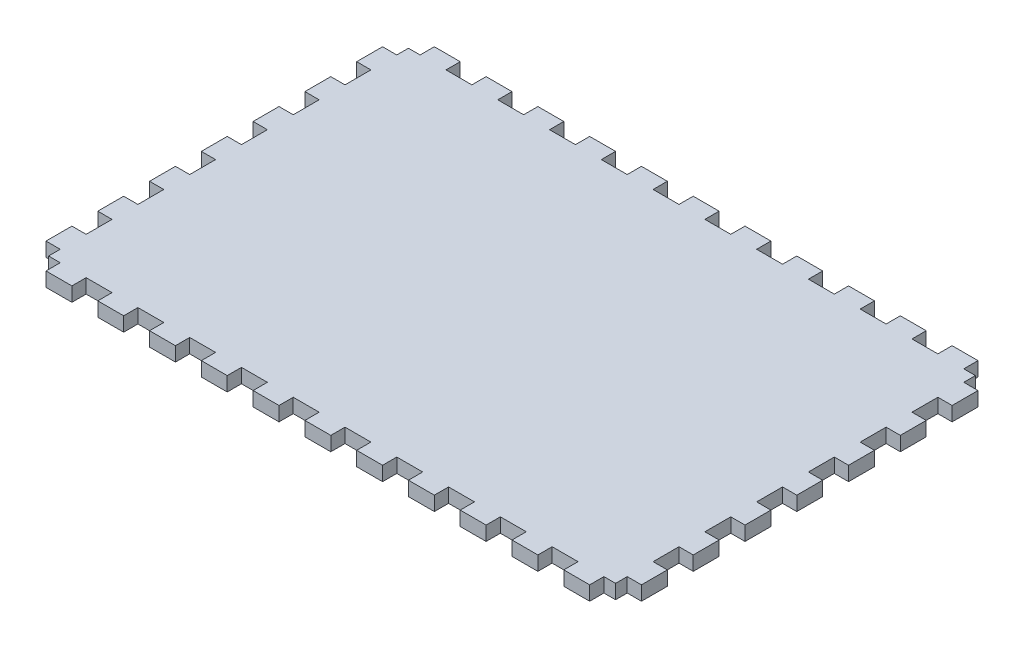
ISO-10303-21;
HEADER;
FILE_DESCRIPTION(('STEP AP214'),'2;1');
FILE_NAME('part.step','',(''),(''),'','','');
FILE_SCHEMA(('AUTOMOTIVE_DESIGN { 1 0 10303 214 1 1 1 1 }'));
ENDSEC;
DATA;
#1=APPLICATION_CONTEXT('core data for automotive mechanical design processes');
#2=APPLICATION_PROTOCOL_DEFINITION('international standard','automotive_design',2000,#1);
#3=PRODUCT_CONTEXT('',#1,'mechanical');
#4=PRODUCT('Part','Part','',(#3));
#5=PRODUCT_RELATED_PRODUCT_CATEGORY('part','',(#4));
#6=PRODUCT_DEFINITION_FORMATION('','',#4);
#7=PRODUCT_DEFINITION_CONTEXT('part definition',#1,'design');
#8=PRODUCT_DEFINITION('design','',#6,#7);
#9=PRODUCT_DEFINITION_SHAPE('','',#8);
#10=(LENGTH_UNIT() NAMED_UNIT(*) SI_UNIT(.MILLI.,.METRE.));
#11=(NAMED_UNIT(*) PLANE_ANGLE_UNIT() SI_UNIT($,.RADIAN.));
#12=(NAMED_UNIT(*) SI_UNIT($,.STERADIAN.) SOLID_ANGLE_UNIT());
#13=UNCERTAINTY_MEASURE_WITH_UNIT(LENGTH_MEASURE(1.E-05),#10,'distance_accuracy_value','');
#14=(GEOMETRIC_REPRESENTATION_CONTEXT(3) GLOBAL_UNCERTAINTY_ASSIGNED_CONTEXT((#13)) GLOBAL_UNIT_ASSIGNED_CONTEXT((#10,
#11,#12)) REPRESENTATION_CONTEXT('',''));
#15=CARTESIAN_POINT('',(0.,0.,0.));
#16=DIRECTION('',(0.,0.,1.));
#17=DIRECTION('',(1.,0.,0.));
#18=AXIS2_PLACEMENT_3D('',#15,#16,#17);
#19=CARTESIAN_POINT('',(58.42,2.794,-38.1));
#20=DIRECTION('',(-1.,0.,0.));
#21=DIRECTION('',(0.,0.,1.));
#22=AXIS2_PLACEMENT_3D('',#19,#20,#21);
#23=PLANE('',#22);
#24=DIRECTION('',(0.,1.,0.));
#25=VECTOR('',#24,1.);
#26=CARTESIAN_POINT('',(58.4199999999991,4.16333634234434E-13,33.02));
#27=LINE('',#26,#25);
#28=CARTESIAN_POINT('',(58.4199999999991,4.16333634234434E-13,33.02));
#29=VERTEX_POINT('',#28);
#30=CARTESIAN_POINT('',(58.4199999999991,2.79400000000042,33.02));
#31=VERTEX_POINT('',#30);
#32=EDGE_CURVE('E1333',#29,#31,#27,.T.);
#33=ORIENTED_EDGE('',*,*,#32,.F.);
#34=DIRECTION('',(0.,0.,-1.));
#35=VECTOR('',#34,1.);
#36=CARTESIAN_POINT('',(58.42,0.,-38.1));
#37=LINE('',#36,#35);
#38=CARTESIAN_POINT('',(58.4199999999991,4.16333634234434E-13,27.94));
#39=VERTEX_POINT('',#38);
#40=EDGE_CURVE('E998',#29,#39,#37,.T.);
#41=ORIENTED_EDGE('',*,*,#40,.T.);
#42=DIRECTION('',(0.,-1.,0.));
#43=VECTOR('',#42,1.);
#44=CARTESIAN_POINT('',(58.4199999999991,2.79400000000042,27.94));
#45=LINE('',#44,#43);
#46=CARTESIAN_POINT('',(58.4199999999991,2.79400000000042,27.94));
#47=VERTEX_POINT('',#46);
#48=EDGE_CURVE('E1335',#47,#39,#45,.T.);
#49=ORIENTED_EDGE('',*,*,#48,.F.);
#50=DIRECTION('',(0.,0.,-1.));
#51=VECTOR('',#50,1.);
#52=CARTESIAN_POINT('',(58.42,2.794,-38.1));
#53=LINE('',#52,#51);
#54=EDGE_CURVE('E1975',#31,#47,#53,.T.);
#55=ORIENTED_EDGE('',*,*,#54,.F.);
#56=EDGE_LOOP('',(#33,#41,#49,#55));
#57=FACE_BOUND('',#56,.T.);
#58=ADVANCED_FACE('F33',(#57),#23,.F.);
#59=DIRECTION('',(0.,1.,0.));
#60=VECTOR('',#59,1.);
#61=CARTESIAN_POINT('',(58.4199999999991,4.16333634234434E-13,22.86));
#62=LINE('',#61,#60);
#63=CARTESIAN_POINT('',(58.4199999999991,4.16333634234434E-13,22.86));
#64=VERTEX_POINT('',#63);
#65=CARTESIAN_POINT('',(58.4199999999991,2.79400000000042,22.86));
#66=VERTEX_POINT('',#65);
#67=EDGE_CURVE('E1338',#64,#66,#62,.T.);
#68=ORIENTED_EDGE('',*,*,#67,.F.);
#69=CARTESIAN_POINT('',(58.4199999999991,4.16333634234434E-13,17.78));
#70=VERTEX_POINT('',#69);
#71=EDGE_CURVE('E1006',#64,#70,#37,.T.);
#72=ORIENTED_EDGE('',*,*,#71,.T.);
#73=DIRECTION('',(0.,-1.,0.));
#74=VECTOR('',#73,1.);
#75=CARTESIAN_POINT('',(58.4199999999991,2.79400000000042,17.78));
#76=LINE('',#75,#74);
#77=CARTESIAN_POINT('',(58.4199999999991,2.79400000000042,17.78));
#78=VERTEX_POINT('',#77);
#79=EDGE_CURVE('E1340',#78,#70,#76,.T.);
#80=ORIENTED_EDGE('',*,*,#79,.F.);
#81=EDGE_CURVE('E1983',#66,#78,#53,.T.);
#82=ORIENTED_EDGE('',*,*,#81,.F.);
#83=EDGE_LOOP('',(#68,#72,#80,#82));
#84=FACE_BOUND('',#83,.T.);
#85=ADVANCED_FACE('F1945',(#84),#23,.F.);
#86=DIRECTION('',(0.,1.,0.));
#87=VECTOR('',#86,1.);
#88=CARTESIAN_POINT('',(58.4199999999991,4.16333634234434E-13,12.7));
#89=LINE('',#88,#87);
#90=CARTESIAN_POINT('',(58.4199999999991,4.16333634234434E-13,12.7));
#91=VERTEX_POINT('',#90);
#92=CARTESIAN_POINT('',(58.4199999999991,2.79400000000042,12.7));
#93=VERTEX_POINT('',#92);
#94=EDGE_CURVE('E1342',#91,#93,#89,.T.);
#95=ORIENTED_EDGE('',*,*,#94,.F.);
#96=CARTESIAN_POINT('',(58.4199999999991,4.16333634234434E-13,7.62));
#97=VERTEX_POINT('',#96);
#98=EDGE_CURVE('E1013',#91,#97,#37,.T.);
#99=ORIENTED_EDGE('',*,*,#98,.T.);
#100=DIRECTION('',(0.,-1.,0.));
#101=VECTOR('',#100,1.);
#102=CARTESIAN_POINT('',(58.4199999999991,2.79400000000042,7.62));
#103=LINE('',#102,#101);
#104=CARTESIAN_POINT('',(58.4199999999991,2.79400000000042,7.62));
#105=VERTEX_POINT('',#104);
#106=EDGE_CURVE('E1344',#105,#97,#103,.T.);
#107=ORIENTED_EDGE('',*,*,#106,.F.);
#108=EDGE_CURVE('E1990',#93,#105,#53,.T.);
#109=ORIENTED_EDGE('',*,*,#108,.F.);
#110=EDGE_LOOP('',(#95,#99,#107,#109));
#111=FACE_BOUND('',#110,.T.);
#112=ADVANCED_FACE('F1950',(#111),#23,.F.);
#113=DIRECTION('',(0.,1.,0.));
#114=VECTOR('',#113,1.);
#115=CARTESIAN_POINT('',(58.4199999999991,4.16333634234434E-13,2.54000000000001));
#116=LINE('',#115,#114);
#117=CARTESIAN_POINT('',(58.4199999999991,4.16333634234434E-13,2.54000000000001));
#118=VERTEX_POINT('',#117);
#119=CARTESIAN_POINT('',(58.4199999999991,2.79400000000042,2.54000000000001));
#120=VERTEX_POINT('',#119);
#121=EDGE_CURVE('E1346',#118,#120,#116,.T.);
#122=ORIENTED_EDGE('',*,*,#121,.F.);
#123=CARTESIAN_POINT('',(58.4199999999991,4.16333634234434E-13,-2.54));
#124=VERTEX_POINT('',#123);
#125=EDGE_CURVE('E2055',#118,#124,#37,.T.);
#126=ORIENTED_EDGE('',*,*,#125,.T.);
#127=DIRECTION('',(0.,-1.,0.));
#128=VECTOR('',#127,1.);
#129=CARTESIAN_POINT('',(58.4199999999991,2.79400000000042,-2.54));
#130=LINE('',#129,#128);
#131=CARTESIAN_POINT('',(58.4199999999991,2.79400000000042,-2.54));
#132=VERTEX_POINT('',#131);
#133=EDGE_CURVE('E1348',#132,#124,#130,.T.);
#134=ORIENTED_EDGE('',*,*,#133,.F.);
#135=EDGE_CURVE('E1994',#120,#132,#53,.T.);
#136=ORIENTED_EDGE('',*,*,#135,.F.);
#137=EDGE_LOOP('',(#122,#126,#134,#136));
#138=FACE_BOUND('',#137,.T.);
#139=ADVANCED_FACE('F2053',(#138),#23,.F.);
#140=DIRECTION('',(0.,1.,0.));
#141=VECTOR('',#140,1.);
#142=CARTESIAN_POINT('',(58.4199999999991,4.16333634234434E-13,-7.61999999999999));
#143=LINE('',#142,#141);
#144=CARTESIAN_POINT('',(58.4199999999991,4.16333634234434E-13,-7.61999999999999));
#145=VERTEX_POINT('',#144);
#146=CARTESIAN_POINT('',(58.4199999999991,2.79400000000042,-7.61999999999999));
#147=VERTEX_POINT('',#146);
#148=EDGE_CURVE('E1350',#145,#147,#143,.T.);
#149=ORIENTED_EDGE('',*,*,#148,.F.);
#150=CARTESIAN_POINT('',(58.4199999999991,4.16333634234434E-13,-12.7));
#151=VERTEX_POINT('',#150);
#152=EDGE_CURVE('E1022',#145,#151,#37,.T.);
#153=ORIENTED_EDGE('',*,*,#152,.T.);
#154=DIRECTION('',(0.,-1.,0.));
#155=VECTOR('',#154,1.);
#156=CARTESIAN_POINT('',(58.4199999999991,2.79400000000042,-12.7));
#157=LINE('',#156,#155);
#158=CARTESIAN_POINT('',(58.4199999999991,2.79400000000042,-12.7));
#159=VERTEX_POINT('',#158);
#160=EDGE_CURVE('E1352',#159,#151,#157,.T.);
#161=ORIENTED_EDGE('',*,*,#160,.F.);
#162=EDGE_CURVE('E1977',#147,#159,#53,.T.);
#163=ORIENTED_EDGE('',*,*,#162,.F.);
#164=EDGE_LOOP('',(#149,#153,#161,#163));
#165=FACE_BOUND('',#164,.T.);
#166=ADVANCED_FACE('F1961',(#165),#23,.F.);
#167=DIRECTION('',(0.,1.,0.));
#168=VECTOR('',#167,1.);
#169=CARTESIAN_POINT('',(58.4199999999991,4.16333634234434E-13,-17.78));
#170=LINE('',#169,#168);
#171=CARTESIAN_POINT('',(58.4199999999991,4.16333634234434E-13,-17.78));
#172=VERTEX_POINT('',#171);
#173=CARTESIAN_POINT('',(58.4199999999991,2.79400000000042,-17.78));
#174=VERTEX_POINT('',#173);
#175=EDGE_CURVE('E1354',#172,#174,#170,.T.);
#176=ORIENTED_EDGE('',*,*,#175,.F.);
#177=CARTESIAN_POINT('',(58.4199999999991,4.16333634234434E-13,-22.86));
#178=VERTEX_POINT('',#177);
#179=EDGE_CURVE('E1015',#172,#178,#37,.T.);
#180=ORIENTED_EDGE('',*,*,#179,.T.);
#181=DIRECTION('',(0.,-1.,0.));
#182=VECTOR('',#181,1.);
#183=CARTESIAN_POINT('',(58.4199999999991,2.79400000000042,-22.86));
#184=LINE('',#183,#182);
#185=CARTESIAN_POINT('',(58.4199999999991,2.79400000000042,-22.86));
#186=VERTEX_POINT('',#185);
#187=EDGE_CURVE('E1356',#186,#178,#184,.T.);
#188=ORIENTED_EDGE('',*,*,#187,.F.);
#189=EDGE_CURVE('E1974',#174,#186,#53,.T.);
#190=ORIENTED_EDGE('',*,*,#189,.F.);
#191=EDGE_LOOP('',(#176,#180,#188,#190));
#192=FACE_BOUND('',#191,.T.);
#193=ADVANCED_FACE('F1954',(#192),#23,.F.);
#194=DIRECTION('',(0.,1.,0.));
#195=VECTOR('',#194,1.);
#196=CARTESIAN_POINT('',(58.4199999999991,4.16333634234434E-13,-27.94));
#197=LINE('',#196,#195);
#198=CARTESIAN_POINT('',(58.4199999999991,4.16333634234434E-13,-27.94));
#199=VERTEX_POINT('',#198);
#200=CARTESIAN_POINT('',(58.4199999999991,2.79400000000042,-27.94));
#201=VERTEX_POINT('',#200);
#202=EDGE_CURVE('E1358',#199,#201,#197,.T.);
#203=ORIENTED_EDGE('',*,*,#202,.F.);
#204=CARTESIAN_POINT('',(58.4199999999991,4.16333634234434E-13,-33.02));
#205=VERTEX_POINT('',#204);
#206=EDGE_CURVE('E1007',#199,#205,#37,.T.);
#207=ORIENTED_EDGE('',*,*,#206,.T.);
#208=DIRECTION('',(0.,-1.,0.));
#209=VECTOR('',#208,1.);
#210=CARTESIAN_POINT('',(58.4199999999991,2.79400000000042,-33.02));
#211=LINE('',#210,#209);
#212=CARTESIAN_POINT('',(58.4199999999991,2.79400000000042,-33.02));
#213=VERTEX_POINT('',#212);
#214=EDGE_CURVE('E1360',#213,#205,#211,.T.);
#215=ORIENTED_EDGE('',*,*,#214,.F.);
#216=EDGE_CURVE('E1965',#201,#213,#53,.T.);
#217=ORIENTED_EDGE('',*,*,#216,.F.);
#218=EDGE_LOOP('',(#203,#207,#215,#217));
#219=FACE_BOUND('',#218,.T.);
#220=ADVANCED_FACE('F1946',(#219),#23,.F.);
#221=CARTESIAN_POINT('',(-58.42,2.794,-38.1));
#222=DIRECTION('',(0.,0.,1.));
#223=DIRECTION('',(1.,0.,0.));
#224=AXIS2_PLACEMENT_3D('',#221,#222,#223);
#225=PLANE('',#224);
#226=DIRECTION('',(0.,1.,0.));
#227=VECTOR('',#226,1.);
#228=CARTESIAN_POINT('',(-53.34,-6.24500451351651E-13,-38.1));
#229=LINE('',#228,#227);
#230=CARTESIAN_POINT('',(-53.34,-6.24500451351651E-13,-38.1));
#231=VERTEX_POINT('',#230);
#232=CARTESIAN_POINT('',(-53.34,2.79399999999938,-38.1));
#233=VERTEX_POINT('',#232);
#234=EDGE_CURVE('E1669',#231,#233,#229,.T.);
#235=ORIENTED_EDGE('',*,*,#234,.T.);
#236=DIRECTION('',(-1.,0.,0.));
#237=VECTOR('',#236,1.);
#238=CARTESIAN_POINT('',(-58.42,2.794,-38.1));
#239=LINE('',#238,#237);
#240=CARTESIAN_POINT('',(-48.26,2.79399999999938,-38.1));
#241=VERTEX_POINT('',#240);
#242=EDGE_CURVE('E1982',#241,#233,#239,.T.);
#243=ORIENTED_EDGE('',*,*,#242,.F.);
#244=DIRECTION('',(0.,-1.,0.));
#245=VECTOR('',#244,1.);
#246=CARTESIAN_POINT('',(-48.26,2.79399999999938,-38.1));
#247=LINE('',#246,#245);
#248=CARTESIAN_POINT('',(-48.26,-6.24500451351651E-13,-38.1));
#249=VERTEX_POINT('',#248);
#250=EDGE_CURVE('E1667',#241,#249,#247,.T.);
#251=ORIENTED_EDGE('',*,*,#250,.T.);
#252=DIRECTION('',(-1.,0.,0.));
#253=VECTOR('',#252,1.);
#254=CARTESIAN_POINT('',(-58.42,0.,-38.1));
#255=LINE('',#254,#253);
#256=EDGE_CURVE('E988',#249,#231,#255,.T.);
#257=ORIENTED_EDGE('',*,*,#256,.T.);
#258=EDGE_LOOP('',(#235,#243,#251,#257));
#259=FACE_BOUND('',#258,.T.);
#260=ADVANCED_FACE('F1953',(#259),#225,.F.);
#261=DIRECTION('',(0.,1.,0.));
#262=VECTOR('',#261,1.);
#263=CARTESIAN_POINT('',(-43.18,-6.24500451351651E-13,-38.1));
#264=LINE('',#263,#262);
#265=CARTESIAN_POINT('',(-43.18,0.,-38.1));
#266=VERTEX_POINT('',#265);
#267=CARTESIAN_POINT('',(-43.18,2.79399999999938,-38.1));
#268=VERTEX_POINT('',#267);
#269=EDGE_CURVE('E1664',#266,#268,#264,.T.);
#270=ORIENTED_EDGE('',*,*,#269,.T.);
#271=CARTESIAN_POINT('',(-38.1,2.79399999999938,-38.1));
#272=VERTEX_POINT('',#271);
#273=EDGE_CURVE('E1987',#272,#268,#239,.T.);
#274=ORIENTED_EDGE('',*,*,#273,.F.);
#275=DIRECTION('',(0.,-1.,0.));
#276=VECTOR('',#275,1.);
#277=CARTESIAN_POINT('',(-38.1,2.79399999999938,-38.1));
#278=LINE('',#277,#276);
#279=CARTESIAN_POINT('',(-38.1,-6.24500451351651E-13,-38.1));
#280=VERTEX_POINT('',#279);
#281=EDGE_CURVE('E1661',#272,#280,#278,.T.);
#282=ORIENTED_EDGE('',*,*,#281,.T.);
#283=EDGE_CURVE('E997',#280,#266,#255,.T.);
#284=ORIENTED_EDGE('',*,*,#283,.T.);
#285=EDGE_LOOP('',(#270,#274,#282,#284));
#286=FACE_BOUND('',#285,.T.);
#287=ADVANCED_FACE('F1959',(#286),#225,.F.);
#288=DIRECTION('',(0.,1.,0.));
#289=VECTOR('',#288,1.);
#290=CARTESIAN_POINT('',(-33.02,-6.24500451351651E-13,-38.1));
#291=LINE('',#290,#289);
#292=CARTESIAN_POINT('',(-33.02,0.,-38.1));
#293=VERTEX_POINT('',#292);
#294=CARTESIAN_POINT('',(-33.02,2.79399999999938,-38.1));
#295=VERTEX_POINT('',#294);
#296=EDGE_CURVE('E1658',#293,#295,#291,.T.);
#297=ORIENTED_EDGE('',*,*,#296,.T.);
#298=CARTESIAN_POINT('',(-27.94,2.79399999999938,-38.1));
#299=VERTEX_POINT('',#298);
#300=EDGE_CURVE('E3446',#299,#295,#239,.T.);
#301=ORIENTED_EDGE('',*,*,#300,.F.);
#302=DIRECTION('',(0.,-1.,0.));
#303=VECTOR('',#302,1.);
#304=CARTESIAN_POINT('',(-27.94,2.79399999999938,-38.1));
#305=LINE('',#304,#303);
#306=CARTESIAN_POINT('',(-27.94,-6.24500451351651E-13,-38.1));
#307=VERTEX_POINT('',#306);
#308=EDGE_CURVE('E1655',#299,#307,#305,.T.);
#309=ORIENTED_EDGE('',*,*,#308,.T.);
#310=EDGE_CURVE('E1004',#307,#293,#255,.T.);
#311=ORIENTED_EDGE('',*,*,#310,.T.);
#312=EDGE_LOOP('',(#297,#301,#309,#311));
#313=FACE_BOUND('',#312,.T.);
#314=ADVANCED_FACE('F2829',(#313),#225,.F.);
#315=DIRECTION('',(0.,1.,0.));
#316=VECTOR('',#315,1.);
#317=CARTESIAN_POINT('',(-22.86,-6.24500451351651E-13,-38.1));
#318=LINE('',#317,#316);
#319=CARTESIAN_POINT('',(-22.86,0.,-38.1));
#320=VERTEX_POINT('',#319);
#321=CARTESIAN_POINT('',(-22.86,2.79399999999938,-38.1));
#322=VERTEX_POINT('',#321);
#323=EDGE_CURVE('E1652',#320,#322,#318,.T.);
#324=ORIENTED_EDGE('',*,*,#323,.T.);
#325=CARTESIAN_POINT('',(-17.78,2.79399999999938,-38.1));
#326=VERTEX_POINT('',#325);
#327=EDGE_CURVE('E3448',#326,#322,#239,.T.);
#328=ORIENTED_EDGE('',*,*,#327,.F.);
#329=DIRECTION('',(0.,-1.,0.));
#330=VECTOR('',#329,1.);
#331=CARTESIAN_POINT('',(-17.78,2.79399999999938,-38.1));
#332=LINE('',#331,#330);
#333=CARTESIAN_POINT('',(-17.78,-6.24500451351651E-13,-38.1));
#334=VERTEX_POINT('',#333);
#335=EDGE_CURVE('E1649',#326,#334,#332,.T.);
#336=ORIENTED_EDGE('',*,*,#335,.T.);
#337=EDGE_CURVE('E3508',#334,#320,#255,.T.);
#338=ORIENTED_EDGE('',*,*,#337,.T.);
#339=EDGE_LOOP('',(#324,#328,#336,#338));
#340=FACE_BOUND('',#339,.T.);
#341=ADVANCED_FACE('F2821',(#340),#225,.F.);
#342=DIRECTION('',(0.,1.,0.));
#343=VECTOR('',#342,1.);
#344=CARTESIAN_POINT('',(-12.7,-6.24500451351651E-13,-38.1));
#345=LINE('',#344,#343);
#346=CARTESIAN_POINT('',(-12.7,0.,-38.1));
#347=VERTEX_POINT('',#346);
#348=CARTESIAN_POINT('',(-12.7,2.79399999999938,-38.1));
#349=VERTEX_POINT('',#348);
#350=EDGE_CURVE('E1646',#347,#349,#345,.T.);
#351=ORIENTED_EDGE('',*,*,#350,.T.);
#352=CARTESIAN_POINT('',(-7.62000000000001,2.79399999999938,-38.1));
#353=VERTEX_POINT('',#352);
#354=EDGE_CURVE('E3450',#353,#349,#239,.T.);
#355=ORIENTED_EDGE('',*,*,#354,.F.);
#356=DIRECTION('',(0.,-1.,0.));
#357=VECTOR('',#356,1.);
#358=CARTESIAN_POINT('',(-7.62000000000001,2.79399999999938,-38.1));
#359=LINE('',#358,#357);
#360=CARTESIAN_POINT('',(-7.62000000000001,-6.24500451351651E-13,-38.1));
#361=VERTEX_POINT('',#360);
#362=EDGE_CURVE('E1643',#353,#361,#359,.T.);
#363=ORIENTED_EDGE('',*,*,#362,.T.);
#364=EDGE_CURVE('E3510',#361,#347,#255,.T.);
#365=ORIENTED_EDGE('',*,*,#364,.T.);
#366=EDGE_LOOP('',(#351,#355,#363,#365));
#367=FACE_BOUND('',#366,.T.);
#368=ADVANCED_FACE('F2812',(#367),#225,.F.);
#369=DIRECTION('',(0.,1.,0.));
#370=VECTOR('',#369,1.);
#371=CARTESIAN_POINT('',(-2.54,-6.24500451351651E-13,-38.1));
#372=LINE('',#371,#370);
#373=CARTESIAN_POINT('',(-2.54000000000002,0.,-38.1));
#374=VERTEX_POINT('',#373);
#375=CARTESIAN_POINT('',(-2.54,2.79399999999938,-38.1));
#376=VERTEX_POINT('',#375);
#377=EDGE_CURVE('E1640',#374,#376,#372,.T.);
#378=ORIENTED_EDGE('',*,*,#377,.T.);
#379=CARTESIAN_POINT('',(2.54,2.79399999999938,-38.1));
#380=VERTEX_POINT('',#379);
#381=EDGE_CURVE('E3454',#380,#376,#239,.T.);
#382=ORIENTED_EDGE('',*,*,#381,.F.);
#383=DIRECTION('',(0.,-1.,0.));
#384=VECTOR('',#383,1.);
#385=CARTESIAN_POINT('',(2.54,2.79399999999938,-38.1));
#386=LINE('',#385,#384);
#387=CARTESIAN_POINT('',(2.54,-6.24500451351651E-13,-38.1));
#388=VERTEX_POINT('',#387);
#389=EDGE_CURVE('E1637',#380,#388,#386,.T.);
#390=ORIENTED_EDGE('',*,*,#389,.T.);
#391=EDGE_CURVE('E3512',#388,#374,#255,.T.);
#392=ORIENTED_EDGE('',*,*,#391,.T.);
#393=EDGE_LOOP('',(#378,#382,#390,#392));
#394=FACE_BOUND('',#393,.T.);
#395=ADVANCED_FACE('F2804',(#394),#225,.F.);
#396=DIRECTION('',(0.,1.,0.));
#397=VECTOR('',#396,1.);
#398=CARTESIAN_POINT('',(7.61999999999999,-6.24500451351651E-13,-38.1));
#399=LINE('',#398,#397);
#400=CARTESIAN_POINT('',(7.61999999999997,0.,-38.1));
#401=VERTEX_POINT('',#400);
#402=CARTESIAN_POINT('',(7.61999999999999,2.79399999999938,-38.1));
#403=VERTEX_POINT('',#402);
#404=EDGE_CURVE('E1634',#401,#403,#399,.T.);
#405=ORIENTED_EDGE('',*,*,#404,.T.);
#406=CARTESIAN_POINT('',(12.7,2.79399999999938,-38.1));
#407=VERTEX_POINT('',#406);
#408=EDGE_CURVE('E3458',#407,#403,#239,.T.);
#409=ORIENTED_EDGE('',*,*,#408,.F.);
#410=DIRECTION('',(0.,-1.,0.));
#411=VECTOR('',#410,1.);
#412=CARTESIAN_POINT('',(12.7,2.79399999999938,-38.1));
#413=LINE('',#412,#411);
#414=CARTESIAN_POINT('',(12.7,-6.24500451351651E-13,-38.1));
#415=VERTEX_POINT('',#414);
#416=EDGE_CURVE('E1631',#407,#415,#413,.T.);
#417=ORIENTED_EDGE('',*,*,#416,.T.);
#418=EDGE_CURVE('E3517',#415,#401,#255,.T.);
#419=ORIENTED_EDGE('',*,*,#418,.T.);
#420=EDGE_LOOP('',(#405,#409,#417,#419));
#421=FACE_BOUND('',#420,.T.);
#422=ADVANCED_FACE('F2795',(#421),#225,.F.);
#423=DIRECTION('',(0.,1.,0.));
#424=VECTOR('',#423,1.);
#425=CARTESIAN_POINT('',(17.78,-6.24500451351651E-13,-38.1));
#426=LINE('',#425,#424);
#427=CARTESIAN_POINT('',(17.78,0.,-38.1));
#428=VERTEX_POINT('',#427);
#429=CARTESIAN_POINT('',(17.78,2.79399999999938,-38.1));
#430=VERTEX_POINT('',#429);
#431=EDGE_CURVE('E1628',#428,#430,#426,.T.);
#432=ORIENTED_EDGE('',*,*,#431,.T.);
#433=CARTESIAN_POINT('',(22.86,2.79399999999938,-38.1));
#434=VERTEX_POINT('',#433);
#435=EDGE_CURVE('E3462',#434,#430,#239,.T.);
#436=ORIENTED_EDGE('',*,*,#435,.F.);
#437=DIRECTION('',(0.,-1.,0.));
#438=VECTOR('',#437,1.);
#439=CARTESIAN_POINT('',(22.86,2.79399999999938,-38.1));
#440=LINE('',#439,#438);
#441=CARTESIAN_POINT('',(22.86,-6.24500451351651E-13,-38.1));
#442=VERTEX_POINT('',#441);
#443=EDGE_CURVE('E1625',#434,#442,#440,.T.);
#444=ORIENTED_EDGE('',*,*,#443,.T.);
#445=EDGE_CURVE('E3520',#442,#428,#255,.T.);
#446=ORIENTED_EDGE('',*,*,#445,.T.);
#447=EDGE_LOOP('',(#432,#436,#444,#446));
#448=FACE_BOUND('',#447,.T.);
#449=ADVANCED_FACE('F2787',(#448),#225,.F.);
#450=DIRECTION('',(0.,1.,0.));
#451=VECTOR('',#450,1.);
#452=CARTESIAN_POINT('',(27.94,-6.24500451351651E-13,-38.1));
#453=LINE('',#452,#451);
#454=CARTESIAN_POINT('',(27.94,0.,-38.1));
#455=VERTEX_POINT('',#454);
#456=CARTESIAN_POINT('',(27.94,2.79399999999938,-38.1));
#457=VERTEX_POINT('',#456);
#458=EDGE_CURVE('E1622',#455,#457,#453,.T.);
#459=ORIENTED_EDGE('',*,*,#458,.T.);
#460=CARTESIAN_POINT('',(33.02,2.79399999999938,-38.1));
#461=VERTEX_POINT('',#460);
#462=EDGE_CURVE('E3466',#461,#457,#239,.T.);
#463=ORIENTED_EDGE('',*,*,#462,.F.);
#464=DIRECTION('',(0.,-1.,0.));
#465=VECTOR('',#464,1.);
#466=CARTESIAN_POINT('',(33.02,2.79399999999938,-38.1));
#467=LINE('',#466,#465);
#468=CARTESIAN_POINT('',(33.02,-6.24500451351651E-13,-38.1));
#469=VERTEX_POINT('',#468);
#470=EDGE_CURVE('E1619',#461,#469,#467,.T.);
#471=ORIENTED_EDGE('',*,*,#470,.T.);
#472=EDGE_CURVE('E994',#469,#455,#255,.T.);
#473=ORIENTED_EDGE('',*,*,#472,.T.);
#474=EDGE_LOOP('',(#459,#463,#471,#473));
#475=FACE_BOUND('',#474,.T.);
#476=ADVANCED_FACE('F2778',(#475),#225,.F.);
#477=DIRECTION('',(0.,1.,0.));
#478=VECTOR('',#477,1.);
#479=CARTESIAN_POINT('',(38.1,-6.24500451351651E-13,-38.1));
#480=LINE('',#479,#478);
#481=CARTESIAN_POINT('',(38.1,0.,-38.1));
#482=VERTEX_POINT('',#481);
#483=CARTESIAN_POINT('',(38.1,2.79399999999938,-38.1));
#484=VERTEX_POINT('',#483);
#485=EDGE_CURVE('E1616',#482,#484,#480,.T.);
#486=ORIENTED_EDGE('',*,*,#485,.T.);
#487=CARTESIAN_POINT('',(43.18,2.79399999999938,-38.1));
#488=VERTEX_POINT('',#487);
#489=EDGE_CURVE('E3470',#488,#484,#239,.T.);
#490=ORIENTED_EDGE('',*,*,#489,.F.);
#491=DIRECTION('',(0.,-1.,0.));
#492=VECTOR('',#491,1.);
#493=CARTESIAN_POINT('',(43.18,2.79399999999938,-38.1));
#494=LINE('',#493,#492);
#495=CARTESIAN_POINT('',(43.18,-6.24500451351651E-13,-38.1));
#496=VERTEX_POINT('',#495);
#497=EDGE_CURVE('E1613',#488,#496,#494,.T.);
#498=ORIENTED_EDGE('',*,*,#497,.T.);
#499=EDGE_CURVE('E987',#496,#482,#255,.T.);
#500=ORIENTED_EDGE('',*,*,#499,.T.);
#501=EDGE_LOOP('',(#486,#490,#498,#500));
#502=FACE_BOUND('',#501,.T.);
#503=ADVANCED_FACE('F2695',(#502),#225,.F.);
#504=DIRECTION('',(0.,1.,0.));
#505=VECTOR('',#504,1.);
#506=CARTESIAN_POINT('',(48.26,-6.24500451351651E-13,-38.1));
#507=LINE('',#506,#505);
#508=CARTESIAN_POINT('',(48.26,0.,-38.1));
#509=VERTEX_POINT('',#508);
#510=CARTESIAN_POINT('',(48.26,2.79399999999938,-38.1));
#511=VERTEX_POINT('',#510);
#512=EDGE_CURVE('E1611',#509,#511,#507,.T.);
#513=ORIENTED_EDGE('',*,*,#512,.T.);
#514=CARTESIAN_POINT('',(53.34,2.79399999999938,-38.1));
#515=VERTEX_POINT('',#514);
#516=EDGE_CURVE('E1988',#515,#511,#239,.T.);
#517=ORIENTED_EDGE('',*,*,#516,.F.);
#518=DIRECTION('',(0.,-1.,0.));
#519=VECTOR('',#518,1.);
#520=CARTESIAN_POINT('',(53.34,2.79399999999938,-38.1));
#521=LINE('',#520,#519);
#522=CARTESIAN_POINT('',(53.34,-6.24500451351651E-13,-38.1));
#523=VERTEX_POINT('',#522);
#524=EDGE_CURVE('E1608',#515,#523,#521,.T.);
#525=ORIENTED_EDGE('',*,*,#524,.T.);
#526=EDGE_CURVE('E979',#523,#509,#255,.T.);
#527=ORIENTED_EDGE('',*,*,#526,.T.);
#528=EDGE_LOOP('',(#513,#517,#525,#527));
#529=FACE_BOUND('',#528,.T.);
#530=ADVANCED_FACE('F1960',(#529),#225,.F.);
#531=CARTESIAN_POINT('',(-58.42,2.794,-38.1));
#532=DIRECTION('',(1.,0.,0.));
#533=DIRECTION('',(0.,0.,-1.));
#534=AXIS2_PLACEMENT_3D('',#531,#532,#533);
#535=PLANE('',#534);
#536=DIRECTION('',(0.,1.,0.));
#537=VECTOR('',#536,1.);
#538=CARTESIAN_POINT('',(-58.42,0.,33.02));
#539=LINE('',#538,#537);
#540=CARTESIAN_POINT('',(-58.42,0.,33.02));
#541=VERTEX_POINT('',#540);
#542=CARTESIAN_POINT('',(-58.42,2.794,33.02));
#543=VERTEX_POINT('',#542);
#544=EDGE_CURVE('E950',#541,#543,#539,.T.);
#545=ORIENTED_EDGE('',*,*,#544,.T.);
#546=DIRECTION('',(0.,0.,1.));
#547=VECTOR('',#546,1.);
#548=CARTESIAN_POINT('',(-58.42,2.794,-38.1));
#549=LINE('',#548,#547);
#550=CARTESIAN_POINT('',(-58.42,2.794,27.94));
#551=VERTEX_POINT('',#550);
#552=EDGE_CURVE('E2299',#551,#543,#549,.T.);
#553=ORIENTED_EDGE('',*,*,#552,.F.);
#554=DIRECTION('',(0.,-1.,0.));
#555=VECTOR('',#554,1.);
#556=CARTESIAN_POINT('',(-58.42,2.794,27.94));
#557=LINE('',#556,#555);
#558=CARTESIAN_POINT('',(-58.42,0.,27.94));
#559=VERTEX_POINT('',#558);
#560=EDGE_CURVE('E1820',#551,#559,#557,.T.);
#561=ORIENTED_EDGE('',*,*,#560,.T.);
#562=DIRECTION('',(0.,0.,1.));
#563=VECTOR('',#562,1.);
#564=CARTESIAN_POINT('',(-58.42,0.,-38.1));
#565=LINE('',#564,#563);
#566=EDGE_CURVE('E970',#559,#541,#565,.T.);
#567=ORIENTED_EDGE('',*,*,#566,.T.);
#568=EDGE_LOOP('',(#545,#553,#561,#567));
#569=FACE_BOUND('',#568,.T.);
#570=ADVANCED_FACE('F2686',(#569),#535,.F.);
#571=DIRECTION('',(0.,1.,0.));
#572=VECTOR('',#571,1.);
#573=CARTESIAN_POINT('',(-58.42,0.,22.86));
#574=LINE('',#573,#572);
#575=CARTESIAN_POINT('',(-58.42,0.,22.86));
#576=VERTEX_POINT('',#575);
#577=CARTESIAN_POINT('',(-58.42,2.794,22.86));
#578=VERTEX_POINT('',#577);
#579=EDGE_CURVE('E1824',#576,#578,#574,.T.);
#580=ORIENTED_EDGE('',*,*,#579,.T.);
#581=CARTESIAN_POINT('',(-58.42,2.794,17.78));
#582=VERTEX_POINT('',#581);
#583=EDGE_CURVE('E2303',#582,#578,#549,.T.);
#584=ORIENTED_EDGE('',*,*,#583,.F.);
#585=DIRECTION('',(0.,-1.,0.));
#586=VECTOR('',#585,1.);
#587=CARTESIAN_POINT('',(-58.42,2.794,17.78));
#588=LINE('',#587,#586);
#589=CARTESIAN_POINT('',(-58.42,0.,17.78));
#590=VERTEX_POINT('',#589);
#591=EDGE_CURVE('E1829',#582,#590,#588,.T.);
#592=ORIENTED_EDGE('',*,*,#591,.T.);
#593=EDGE_CURVE('E978',#590,#576,#565,.T.);
#594=ORIENTED_EDGE('',*,*,#593,.T.);
#595=EDGE_LOOP('',(#580,#584,#592,#594));
#596=FACE_BOUND('',#595,.T.);
#597=ADVANCED_FACE('F2688',(#596),#535,.F.);
#598=DIRECTION('',(0.,1.,0.));
#599=VECTOR('',#598,1.);
#600=CARTESIAN_POINT('',(-58.42,0.,12.7));
#601=LINE('',#600,#599);
#602=CARTESIAN_POINT('',(-58.42,0.,12.7));
#603=VERTEX_POINT('',#602);
#604=CARTESIAN_POINT('',(-58.42,2.794,12.7));
#605=VERTEX_POINT('',#604);
#606=EDGE_CURVE('E1834',#603,#605,#601,.T.);
#607=ORIENTED_EDGE('',*,*,#606,.T.);
#608=CARTESIAN_POINT('',(-58.42,2.794,7.62));
#609=VERTEX_POINT('',#608);
#610=EDGE_CURVE('E2705',#609,#605,#549,.T.);
#611=ORIENTED_EDGE('',*,*,#610,.F.);
#612=DIRECTION('',(0.,-1.,0.));
#613=VECTOR('',#612,1.);
#614=CARTESIAN_POINT('',(-58.42,2.794,7.62));
#615=LINE('',#614,#613);
#616=CARTESIAN_POINT('',(-58.42,0.,7.62));
#617=VERTEX_POINT('',#616);
#618=EDGE_CURVE('E1839',#609,#617,#615,.T.);
#619=ORIENTED_EDGE('',*,*,#618,.T.);
#620=EDGE_CURVE('E985',#617,#603,#565,.T.);
#621=ORIENTED_EDGE('',*,*,#620,.T.);
#622=EDGE_LOOP('',(#607,#611,#619,#621));
#623=FACE_BOUND('',#622,.T.);
#624=ADVANCED_FACE('F2693',(#623),#535,.F.);
#625=DIRECTION('',(0.,1.,0.));
#626=VECTOR('',#625,1.);
#627=CARTESIAN_POINT('',(-58.42,0.,2.54000000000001));
#628=LINE('',#627,#626);
#629=CARTESIAN_POINT('',(-58.42,0.,2.54));
#630=VERTEX_POINT('',#629);
#631=CARTESIAN_POINT('',(-58.42,2.794,2.54000000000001));
#632=VERTEX_POINT('',#631);
#633=EDGE_CURVE('E1844',#630,#632,#628,.T.);
#634=ORIENTED_EDGE('',*,*,#633,.T.);
#635=CARTESIAN_POINT('',(-58.42,2.794,-2.54));
#636=VERTEX_POINT('',#635);
#637=EDGE_CURVE('E2301',#636,#632,#549,.T.);
#638=ORIENTED_EDGE('',*,*,#637,.F.);
#639=DIRECTION('',(0.,-1.,0.));
#640=VECTOR('',#639,1.);
#641=CARTESIAN_POINT('',(-58.42,2.794,-2.54));
#642=LINE('',#641,#640);
#643=CARTESIAN_POINT('',(-58.42,0.,-2.54));
#644=VERTEX_POINT('',#643);
#645=EDGE_CURVE('E1849',#636,#644,#642,.T.);
#646=ORIENTED_EDGE('',*,*,#645,.T.);
#647=EDGE_CURVE('E2718',#644,#630,#565,.T.);
#648=ORIENTED_EDGE('',*,*,#647,.T.);
#649=EDGE_LOOP('',(#634,#638,#646,#648));
#650=FACE_BOUND('',#649,.T.);
#651=ADVANCED_FACE('F2715',(#650),#535,.F.);
#652=DIRECTION('',(0.,1.,0.));
#653=VECTOR('',#652,1.);
#654=CARTESIAN_POINT('',(-58.42,0.,-7.61999999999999));
#655=LINE('',#654,#653);
#656=CARTESIAN_POINT('',(-58.42,0.,-7.61999999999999));
#657=VERTEX_POINT('',#656);
#658=CARTESIAN_POINT('',(-58.42,2.794,-7.61999999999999));
#659=VERTEX_POINT('',#658);
#660=EDGE_CURVE('E1854',#657,#659,#655,.T.);
#661=ORIENTED_EDGE('',*,*,#660,.T.);
#662=CARTESIAN_POINT('',(-58.42,2.794,-12.7));
#663=VERTEX_POINT('',#662);
#664=EDGE_CURVE('E2297',#663,#659,#549,.T.);
#665=ORIENTED_EDGE('',*,*,#664,.F.);
#666=DIRECTION('',(0.,-1.,0.));
#667=VECTOR('',#666,1.);
#668=CARTESIAN_POINT('',(-58.42,2.794,-12.7));
#669=LINE('',#668,#667);
#670=CARTESIAN_POINT('',(-58.42,0.,-12.7));
#671=VERTEX_POINT('',#670);
#672=EDGE_CURVE('E1859',#663,#671,#669,.T.);
#673=ORIENTED_EDGE('',*,*,#672,.T.);
#674=EDGE_CURVE('E975',#671,#657,#565,.T.);
#675=ORIENTED_EDGE('',*,*,#674,.T.);
#676=EDGE_LOOP('',(#661,#665,#673,#675));
#677=FACE_BOUND('',#676,.T.);
#678=ADVANCED_FACE('F2733',(#677),#535,.F.);
#679=DIRECTION('',(0.,1.,0.));
#680=VECTOR('',#679,1.);
#681=CARTESIAN_POINT('',(-58.42,0.,-17.78));
#682=LINE('',#681,#680);
#683=CARTESIAN_POINT('',(-58.42,0.,-17.78));
#684=VERTEX_POINT('',#683);
#685=CARTESIAN_POINT('',(-58.42,2.794,-17.78));
#686=VERTEX_POINT('',#685);
#687=EDGE_CURVE('E1864',#684,#686,#682,.T.);
#688=ORIENTED_EDGE('',*,*,#687,.T.);
#689=CARTESIAN_POINT('',(-58.42,2.794,-22.86));
#690=VERTEX_POINT('',#689);
#691=EDGE_CURVE('E2295',#690,#686,#549,.T.);
#692=ORIENTED_EDGE('',*,*,#691,.F.);
#693=DIRECTION('',(0.,-1.,0.));
#694=VECTOR('',#693,1.);
#695=CARTESIAN_POINT('',(-58.42,2.794,-22.86));
#696=LINE('',#695,#694);
#697=CARTESIAN_POINT('',(-58.42,0.,-22.86));
#698=VERTEX_POINT('',#697);
#699=EDGE_CURVE('E1869',#690,#698,#696,.T.);
#700=ORIENTED_EDGE('',*,*,#699,.T.);
#701=EDGE_CURVE('E969',#698,#684,#565,.T.);
#702=ORIENTED_EDGE('',*,*,#701,.T.);
#703=EDGE_LOOP('',(#688,#692,#700,#702));
#704=FACE_BOUND('',#703,.T.);
#705=ADVANCED_FACE('F2293',(#704),#535,.F.);
#706=DIRECTION('',(0.,1.,0.));
#707=VECTOR('',#706,1.);
#708=CARTESIAN_POINT('',(-58.42,0.,-27.94));
#709=LINE('',#708,#707);
#710=CARTESIAN_POINT('',(-58.42,0.,-27.94));
#711=VERTEX_POINT('',#710);
#712=CARTESIAN_POINT('',(-58.42,2.794,-27.94));
#713=VERTEX_POINT('',#712);
#714=EDGE_CURVE('E1874',#711,#713,#709,.T.);
#715=ORIENTED_EDGE('',*,*,#714,.T.);
#716=CARTESIAN_POINT('',(-58.42,2.794,-33.02));
#717=VERTEX_POINT('',#716);
#718=EDGE_CURVE('E960',#717,#713,#549,.T.);
#719=ORIENTED_EDGE('',*,*,#718,.F.);
#720=DIRECTION('',(0.,-1.,0.));
#721=VECTOR('',#720,1.);
#722=CARTESIAN_POINT('',(-58.42,2.794,-33.02));
#723=LINE('',#722,#721);
#724=CARTESIAN_POINT('',(-58.42,0.,-33.02));
#725=VERTEX_POINT('',#724);
#726=EDGE_CURVE('E943',#717,#725,#723,.T.);
#727=ORIENTED_EDGE('',*,*,#726,.T.);
#728=EDGE_CURVE('E958',#725,#711,#565,.T.);
#729=ORIENTED_EDGE('',*,*,#728,.T.);
#730=EDGE_LOOP('',(#715,#719,#727,#729));
#731=FACE_BOUND('',#730,.T.);
#732=ADVANCED_FACE('F957',(#731),#535,.F.);
#733=CARTESIAN_POINT('',(-58.42,2.794,38.1));
#734=DIRECTION('',(0.,0.,-1.));
#735=DIRECTION('',(-1.,0.,0.));
#736=AXIS2_PLACEMENT_3D('',#733,#734,#735);
#737=PLANE('',#736);
#738=DIRECTION('',(0.,1.,0.));
#739=VECTOR('',#738,1.);
#740=CARTESIAN_POINT('',(-53.3400000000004,-1.94289029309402E-13,38.1));
#741=LINE('',#740,#739);
#742=CARTESIAN_POINT('',(-53.3400000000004,-1.94289029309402E-13,38.1));
#743=VERTEX_POINT('',#742);
#744=CARTESIAN_POINT('',(-53.3400000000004,2.79399999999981,38.1));
#745=VERTEX_POINT('',#744);
#746=EDGE_CURVE('E1212',#743,#745,#741,.T.);
#747=ORIENTED_EDGE('',*,*,#746,.F.);
#748=DIRECTION('',(1.,0.,0.));
#749=VECTOR('',#748,1.);
#750=CARTESIAN_POINT('',(-58.42,0.,38.1));
#751=LINE('',#750,#749);
#752=CARTESIAN_POINT('',(-48.2600000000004,-1.94289029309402E-13,38.1));
#753=VERTEX_POINT('',#752);
#754=EDGE_CURVE('E973',#743,#753,#751,.T.);
#755=ORIENTED_EDGE('',*,*,#754,.T.);
#756=DIRECTION('',(0.,-1.,0.));
#757=VECTOR('',#756,1.);
#758=CARTESIAN_POINT('',(-48.2600000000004,2.79399999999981,38.1));
#759=LINE('',#758,#757);
#760=CARTESIAN_POINT('',(-48.2600000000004,2.79399999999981,38.1));
#761=VERTEX_POINT('',#760);
#762=EDGE_CURVE('E1330',#761,#753,#759,.T.);
#763=ORIENTED_EDGE('',*,*,#762,.F.);
#764=DIRECTION('',(1.,0.,0.));
#765=VECTOR('',#764,1.);
#766=CARTESIAN_POINT('',(-58.42,2.794,38.1));
#767=LINE('',#766,#765);
#768=EDGE_CURVE('E11',#745,#761,#767,.T.);
#769=ORIENTED_EDGE('',*,*,#768,.F.);
#770=EDGE_LOOP('',(#747,#755,#763,#769));
#771=FACE_BOUND('',#770,.T.);
#772=ADVANCED_FACE('F1942',(#771),#737,.F.);
#773=DIRECTION('',(0.,1.,0.));
#774=VECTOR('',#773,1.);
#775=CARTESIAN_POINT('',(-43.1800000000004,-1.94289029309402E-13,38.1));
#776=LINE('',#775,#774);
#777=CARTESIAN_POINT('',(-43.1800000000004,-1.94289029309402E-13,38.1));
#778=VERTEX_POINT('',#777);
#779=CARTESIAN_POINT('',(-43.1800000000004,2.79399999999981,38.1));
#780=VERTEX_POINT('',#779);
#781=EDGE_CURVE('E1328',#778,#780,#776,.T.);
#782=ORIENTED_EDGE('',*,*,#781,.F.);
#783=CARTESIAN_POINT('',(-38.1000000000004,-1.94289029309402E-13,38.1));
#784=VERTEX_POINT('',#783);
#785=EDGE_CURVE('E1979',#778,#784,#751,.T.);
#786=ORIENTED_EDGE('',*,*,#785,.T.);
#787=DIRECTION('',(0.,-1.,0.));
#788=VECTOR('',#787,1.);
#789=CARTESIAN_POINT('',(-38.1000000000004,2.79399999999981,38.1));
#790=LINE('',#789,#788);
#791=CARTESIAN_POINT('',(-38.1000000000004,2.79399999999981,38.1));
#792=VERTEX_POINT('',#791);
#793=EDGE_CURVE('E1326',#792,#784,#790,.T.);
#794=ORIENTED_EDGE('',*,*,#793,.F.);
#795=EDGE_CURVE('E41',#780,#792,#767,.T.);
#796=ORIENTED_EDGE('',*,*,#795,.F.);
#797=EDGE_LOOP('',(#782,#786,#794,#796));
#798=FACE_BOUND('',#797,.T.);
#799=ADVANCED_FACE('F2347',(#798),#737,.F.);
#800=DIRECTION('',(0.,1.,0.));
#801=VECTOR('',#800,1.);
#802=CARTESIAN_POINT('',(-33.0200000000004,-1.94289029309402E-13,38.1));
#803=LINE('',#802,#801);
#804=CARTESIAN_POINT('',(-33.0200000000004,-1.94289029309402E-13,38.1));
#805=VERTEX_POINT('',#804);
#806=CARTESIAN_POINT('',(-33.0200000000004,2.79399999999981,38.1));
#807=VERTEX_POINT('',#806);
#808=EDGE_CURVE('E1324',#805,#807,#803,.T.);
#809=ORIENTED_EDGE('',*,*,#808,.F.);
#810=CARTESIAN_POINT('',(-27.9400000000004,-1.94289029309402E-13,38.1));
#811=VERTEX_POINT('',#810);
#812=EDGE_CURVE('E3679',#805,#811,#751,.T.);
#813=ORIENTED_EDGE('',*,*,#812,.T.);
#814=DIRECTION('',(0.,-1.,0.));
#815=VECTOR('',#814,1.);
#816=CARTESIAN_POINT('',(-27.9400000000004,2.79399999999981,38.1));
#817=LINE('',#816,#815);
#818=CARTESIAN_POINT('',(-27.9400000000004,2.79399999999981,38.1));
#819=VERTEX_POINT('',#818);
#820=EDGE_CURVE('E1322',#819,#811,#817,.T.);
#821=ORIENTED_EDGE('',*,*,#820,.F.);
#822=EDGE_CURVE('E2333',#807,#819,#767,.T.);
#823=ORIENTED_EDGE('',*,*,#822,.F.);
#824=EDGE_LOOP('',(#809,#813,#821,#823));
#825=FACE_BOUND('',#824,.T.);
#826=ADVANCED_FACE('F2684',(#825),#737,.F.);
#827=DIRECTION('',(0.,1.,0.));
#828=VECTOR('',#827,1.);
#829=CARTESIAN_POINT('',(-22.8600000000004,-1.94289029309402E-13,38.1));
#830=LINE('',#829,#828);
#831=CARTESIAN_POINT('',(-22.8600000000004,-1.94289029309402E-13,38.1));
#832=VERTEX_POINT('',#831);
#833=CARTESIAN_POINT('',(-22.8600000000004,2.79399999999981,38.1));
#834=VERTEX_POINT('',#833);
#835=EDGE_CURVE('E1320',#832,#834,#830,.T.);
#836=ORIENTED_EDGE('',*,*,#835,.F.);
#837=CARTESIAN_POINT('',(-17.7800000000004,-1.94289029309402E-13,38.1));
#838=VERTEX_POINT('',#837);
#839=EDGE_CURVE('E3682',#832,#838,#751,.T.);
#840=ORIENTED_EDGE('',*,*,#839,.T.);
#841=DIRECTION('',(0.,-1.,0.));
#842=VECTOR('',#841,1.);
#843=CARTESIAN_POINT('',(-17.7800000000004,2.79399999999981,38.1));
#844=LINE('',#843,#842);
#845=CARTESIAN_POINT('',(-17.7800000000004,2.79399999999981,38.1));
#846=VERTEX_POINT('',#845);
#847=EDGE_CURVE('E1318',#846,#838,#844,.T.);
#848=ORIENTED_EDGE('',*,*,#847,.F.);
#849=EDGE_CURVE('E2329',#834,#846,#767,.T.);
#850=ORIENTED_EDGE('',*,*,#849,.F.);
#851=EDGE_LOOP('',(#836,#840,#848,#850));
#852=FACE_BOUND('',#851,.T.);
#853=ADVANCED_FACE('F3627',(#852),#737,.F.);
#854=DIRECTION('',(0.,1.,0.));
#855=VECTOR('',#854,1.);
#856=CARTESIAN_POINT('',(-12.7000000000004,-1.94289029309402E-13,38.1));
#857=LINE('',#856,#855);
#858=CARTESIAN_POINT('',(-12.7000000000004,-1.94289029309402E-13,38.1));
#859=VERTEX_POINT('',#858);
#860=CARTESIAN_POINT('',(-12.7000000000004,2.79399999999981,38.1));
#861=VERTEX_POINT('',#860);
#862=EDGE_CURVE('E1316',#859,#861,#857,.T.);
#863=ORIENTED_EDGE('',*,*,#862,.F.);
#864=CARTESIAN_POINT('',(-7.62000000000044,-1.94289029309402E-13,38.1));
#865=VERTEX_POINT('',#864);
#866=EDGE_CURVE('E3684',#859,#865,#751,.T.);
#867=ORIENTED_EDGE('',*,*,#866,.T.);
#868=DIRECTION('',(0.,-1.,0.));
#869=VECTOR('',#868,1.);
#870=CARTESIAN_POINT('',(-7.62000000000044,2.79399999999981,38.1));
#871=LINE('',#870,#869);
#872=CARTESIAN_POINT('',(-7.62000000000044,2.79399999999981,38.1));
#873=VERTEX_POINT('',#872);
#874=EDGE_CURVE('E1314',#873,#865,#871,.T.);
#875=ORIENTED_EDGE('',*,*,#874,.F.);
#876=EDGE_CURVE('E2325',#861,#873,#767,.T.);
#877=ORIENTED_EDGE('',*,*,#876,.F.);
#878=EDGE_LOOP('',(#863,#867,#875,#877));
#879=FACE_BOUND('',#878,.T.);
#880=ADVANCED_FACE('F3619',(#879),#737,.F.);
#881=DIRECTION('',(0.,1.,0.));
#882=VECTOR('',#881,1.);
#883=CARTESIAN_POINT('',(-2.54000000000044,-1.94289029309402E-13,38.1));
#884=LINE('',#883,#882);
#885=CARTESIAN_POINT('',(-2.54000000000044,-1.94289029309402E-13,38.1));
#886=VERTEX_POINT('',#885);
#887=CARTESIAN_POINT('',(-2.54000000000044,2.79399999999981,38.1));
#888=VERTEX_POINT('',#887);
#889=EDGE_CURVE('E1312',#886,#888,#884,.T.);
#890=ORIENTED_EDGE('',*,*,#889,.F.);
#891=CARTESIAN_POINT('',(2.53999999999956,-1.94289029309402E-13,38.1));
#892=VERTEX_POINT('',#891);
#893=EDGE_CURVE('E3689',#886,#892,#751,.T.);
#894=ORIENTED_EDGE('',*,*,#893,.T.);
#895=DIRECTION('',(0.,-1.,0.));
#896=VECTOR('',#895,1.);
#897=CARTESIAN_POINT('',(2.53999999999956,2.79399999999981,38.1));
#898=LINE('',#897,#896);
#899=CARTESIAN_POINT('',(2.53999999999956,2.79399999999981,38.1));
#900=VERTEX_POINT('',#899);
#901=EDGE_CURVE('E1310',#900,#892,#898,.T.);
#902=ORIENTED_EDGE('',*,*,#901,.F.);
#903=EDGE_CURVE('E2321',#888,#900,#767,.T.);
#904=ORIENTED_EDGE('',*,*,#903,.F.);
#905=EDGE_LOOP('',(#890,#894,#902,#904));
#906=FACE_BOUND('',#905,.T.);
#907=ADVANCED_FACE('F3610',(#906),#737,.F.);
#908=DIRECTION('',(0.,1.,0.));
#909=VECTOR('',#908,1.);
#910=CARTESIAN_POINT('',(7.61999999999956,-1.94289029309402E-13,38.1));
#911=LINE('',#910,#909);
#912=CARTESIAN_POINT('',(7.61999999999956,-1.94289029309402E-13,38.1));
#913=VERTEX_POINT('',#912);
#914=CARTESIAN_POINT('',(7.61999999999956,2.79399999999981,38.1));
#915=VERTEX_POINT('',#914);
#916=EDGE_CURVE('E1308',#913,#915,#911,.T.);
#917=ORIENTED_EDGE('',*,*,#916,.F.);
#918=CARTESIAN_POINT('',(12.6999999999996,-1.94289029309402E-13,38.1));
#919=VERTEX_POINT('',#918);
#920=EDGE_CURVE('E3694',#913,#919,#751,.T.);
#921=ORIENTED_EDGE('',*,*,#920,.T.);
#922=DIRECTION('',(0.,-1.,0.));
#923=VECTOR('',#922,1.);
#924=CARTESIAN_POINT('',(12.6999999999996,2.79399999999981,38.1));
#925=LINE('',#924,#923);
#926=CARTESIAN_POINT('',(12.6999999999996,2.79399999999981,38.1));
#927=VERTEX_POINT('',#926);
#928=EDGE_CURVE('E1306',#927,#919,#925,.T.);
#929=ORIENTED_EDGE('',*,*,#928,.F.);
#930=EDGE_CURVE('E2317',#915,#927,#767,.T.);
#931=ORIENTED_EDGE('',*,*,#930,.F.);
#932=EDGE_LOOP('',(#917,#921,#929,#931));
#933=FACE_BOUND('',#932,.T.);
#934=ADVANCED_FACE('F3602',(#933),#737,.F.);
#935=DIRECTION('',(0.,1.,0.));
#936=VECTOR('',#935,1.);
#937=CARTESIAN_POINT('',(17.7799999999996,-1.94289029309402E-13,38.1));
#938=LINE('',#937,#936);
#939=CARTESIAN_POINT('',(17.7799999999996,-1.94289029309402E-13,38.1));
#940=VERTEX_POINT('',#939);
#941=CARTESIAN_POINT('',(17.7799999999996,2.79399999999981,38.1));
#942=VERTEX_POINT('',#941);
#943=EDGE_CURVE('E1304',#940,#942,#938,.T.);
#944=ORIENTED_EDGE('',*,*,#943,.F.);
#945=CARTESIAN_POINT('',(22.8599999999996,-1.94289029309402E-13,38.1));
#946=VERTEX_POINT('',#945);
#947=EDGE_CURVE('E3699',#940,#946,#751,.T.);
#948=ORIENTED_EDGE('',*,*,#947,.T.);
#949=DIRECTION('',(0.,-1.,0.));
#950=VECTOR('',#949,1.);
#951=CARTESIAN_POINT('',(22.8599999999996,2.79399999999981,38.1));
#952=LINE('',#951,#950);
#953=CARTESIAN_POINT('',(22.8599999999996,2.79399999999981,38.1));
#954=VERTEX_POINT('',#953);
#955=EDGE_CURVE('E1302',#954,#946,#952,.T.);
#956=ORIENTED_EDGE('',*,*,#955,.F.);
#957=EDGE_CURVE('E2313',#942,#954,#767,.T.);
#958=ORIENTED_EDGE('',*,*,#957,.F.);
#959=EDGE_LOOP('',(#944,#948,#956,#958));
#960=FACE_BOUND('',#959,.T.);
#961=ADVANCED_FACE('F3593',(#960),#737,.F.);
#962=DIRECTION('',(0.,1.,0.));
#963=VECTOR('',#962,1.);
#964=CARTESIAN_POINT('',(27.9399999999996,-1.94289029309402E-13,38.1));
#965=LINE('',#964,#963);
#966=CARTESIAN_POINT('',(27.9399999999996,-1.94289029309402E-13,38.1));
#967=VERTEX_POINT('',#966);
#968=CARTESIAN_POINT('',(27.9399999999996,2.79399999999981,38.1));
#969=VERTEX_POINT('',#968);
#970=EDGE_CURVE('E1300',#967,#969,#965,.T.);
#971=ORIENTED_EDGE('',*,*,#970,.F.);
#972=CARTESIAN_POINT('',(33.0199999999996,-1.94289029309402E-13,38.1));
#973=VERTEX_POINT('',#972);
#974=EDGE_CURVE('E3704',#967,#973,#751,.T.);
#975=ORIENTED_EDGE('',*,*,#974,.T.);
#976=DIRECTION('',(0.,-1.,0.));
#977=VECTOR('',#976,1.);
#978=CARTESIAN_POINT('',(33.0199999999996,2.79399999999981,38.1));
#979=LINE('',#978,#977);
#980=CARTESIAN_POINT('',(33.0199999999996,2.79399999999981,38.1));
#981=VERTEX_POINT('',#980);
#982=EDGE_CURVE('E1298',#981,#973,#979,.T.);
#983=ORIENTED_EDGE('',*,*,#982,.F.);
#984=EDGE_CURVE('E2309',#969,#981,#767,.T.);
#985=ORIENTED_EDGE('',*,*,#984,.F.);
#986=EDGE_LOOP('',(#971,#975,#983,#985));
#987=FACE_BOUND('',#986,.T.);
#988=ADVANCED_FACE('F3586',(#987),#737,.F.);
#989=DIRECTION('',(0.,1.,0.));
#990=VECTOR('',#989,1.);
#991=CARTESIAN_POINT('',(38.0999999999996,-1.94289029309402E-13,38.1));
#992=LINE('',#991,#990);
#993=CARTESIAN_POINT('',(38.0999999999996,-1.94289029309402E-13,38.1));
#994=VERTEX_POINT('',#993);
#995=CARTESIAN_POINT('',(38.0999999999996,2.79399999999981,38.1));
#996=VERTEX_POINT('',#995);
#997=EDGE_CURVE('E1296',#994,#996,#992,.T.);
#998=ORIENTED_EDGE('',*,*,#997,.F.);
#999=CARTESIAN_POINT('',(43.1799999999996,-1.94289029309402E-13,38.1));
#1000=VERTEX_POINT('',#999);
#1001=EDGE_CURVE('E972',#994,#1000,#751,.T.);
#1002=ORIENTED_EDGE('',*,*,#1001,.T.);
#1003=DIRECTION('',(0.,-1.,0.));
#1004=VECTOR('',#1003,1.);
#1005=CARTESIAN_POINT('',(43.1799999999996,2.79399999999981,38.1));
#1006=LINE('',#1005,#1004);
#1007=CARTESIAN_POINT('',(43.1799999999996,2.79399999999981,38.1));
#1008=VERTEX_POINT('',#1007);
#1009=EDGE_CURVE('E1294',#1008,#1000,#1006,.T.);
#1010=ORIENTED_EDGE('',*,*,#1009,.F.);
#1011=EDGE_CURVE('E2305',#996,#1008,#767,.T.);
#1012=ORIENTED_EDGE('',*,*,#1011,.F.);
#1013=EDGE_LOOP('',(#998,#1002,#1010,#1012));
#1014=FACE_BOUND('',#1013,.T.);
#1015=ADVANCED_FACE('F1939',(#1014),#737,.F.);
#1016=DIRECTION('',(0.,1.,0.));
#1017=VECTOR('',#1016,1.);
#1018=CARTESIAN_POINT('',(48.2599999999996,-1.94289029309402E-13,38.1));
#1019=LINE('',#1018,#1017);
#1020=CARTESIAN_POINT('',(48.2599999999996,-1.94289029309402E-13,38.1));
#1021=VERTEX_POINT('',#1020);
#1022=CARTESIAN_POINT('',(48.2599999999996,2.79399999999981,38.1));
#1023=VERTEX_POINT('',#1022);
#1024=EDGE_CURVE('E1292',#1021,#1023,#1019,.T.);
#1025=ORIENTED_EDGE('',*,*,#1024,.F.);
#1026=CARTESIAN_POINT('',(53.3399999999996,-1.94289029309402E-13,38.1));
#1027=VERTEX_POINT('',#1026);
#1028=EDGE_CURVE('E36',#1021,#1027,#751,.T.);
#1029=ORIENTED_EDGE('',*,*,#1028,.T.);
#1030=DIRECTION('',(0.,-1.,0.));
#1031=VECTOR('',#1030,1.);
#1032=CARTESIAN_POINT('',(53.3399999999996,2.79399999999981,38.1));
#1033=LINE('',#1032,#1031);
#1034=CARTESIAN_POINT('',(53.3399999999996,2.79399999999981,38.1));
#1035=VERTEX_POINT('',#1034);
#1036=EDGE_CURVE('E1209',#1035,#1027,#1033,.T.);
#1037=ORIENTED_EDGE('',*,*,#1036,.F.);
#1038=EDGE_CURVE('E43',#1023,#1035,#767,.T.);
#1039=ORIENTED_EDGE('',*,*,#1038,.F.);
#1040=EDGE_LOOP('',(#1025,#1029,#1037,#1039));
#1041=FACE_BOUND('',#1040,.T.);
#1042=ADVANCED_FACE('F1932',(#1041),#737,.F.);
#1043=CARTESIAN_POINT('',(0.,2.794,0.));
#1044=DIRECTION('',(0.,1.,0.));
#1045=DIRECTION('',(0.,0.,1.));
#1046=AXIS2_PLACEMENT_3D('',#1043,#1044,#1045);
#1047=PLANE('',#1046);
#1048=ORIENTED_EDGE('',*,*,#718,.T.);
#1049=DIRECTION('',(-1.,0.,0.));
#1050=VECTOR('',#1049,1.);
#1051=CARTESIAN_POINT('',(-55.626,2.794,-27.94));
#1052=LINE('',#1051,#1050);
#1053=CARTESIAN_POINT('',(-55.626,2.794,-27.94));
#1054=VERTEX_POINT('',#1053);
#1055=EDGE_CURVE('E962',#1054,#713,#1052,.T.);
#1056=ORIENTED_EDGE('',*,*,#1055,.F.);
#1057=DIRECTION('',(0.,0.,1.));
#1058=VECTOR('',#1057,1.);
#1059=CARTESIAN_POINT('',(-55.626,2.794,0.));
#1060=LINE('',#1059,#1058);
#1061=CARTESIAN_POINT('',(-55.626,2.794,-22.86));
#1062=VERTEX_POINT('',#1061);
#1063=EDGE_CURVE('E1067',#1054,#1062,#1060,.T.);
#1064=ORIENTED_EDGE('',*,*,#1063,.T.);
#1065=DIRECTION('',(-1.,0.,0.));
#1066=VECTOR('',#1065,1.);
#1067=CARTESIAN_POINT('',(-55.626,2.794,-22.86));
#1068=LINE('',#1067,#1066);
#1069=EDGE_CURVE('E1872',#1062,#690,#1068,.T.);
#1070=ORIENTED_EDGE('',*,*,#1069,.T.);
#1071=ORIENTED_EDGE('',*,*,#691,.T.);
#1072=DIRECTION('',(-1.,0.,0.));
#1073=VECTOR('',#1072,1.);
#1074=CARTESIAN_POINT('',(-55.626,2.794,-17.78));
#1075=LINE('',#1074,#1073);
#1076=CARTESIAN_POINT('',(-55.626,2.794,-17.78));
#1077=VERTEX_POINT('',#1076);
#1078=EDGE_CURVE('E1873',#1077,#686,#1075,.T.);
#1079=ORIENTED_EDGE('',*,*,#1078,.F.);
#1080=CARTESIAN_POINT('',(-55.626,2.794,-12.7));
#1081=VERTEX_POINT('',#1080);
#1082=EDGE_CURVE('E1070',#1077,#1081,#1060,.T.);
#1083=ORIENTED_EDGE('',*,*,#1082,.T.);
#1084=DIRECTION('',(-1.,0.,0.));
#1085=VECTOR('',#1084,1.);
#1086=CARTESIAN_POINT('',(-55.626,2.794,-12.7));
#1087=LINE('',#1086,#1085);
#1088=EDGE_CURVE('E1862',#1081,#663,#1087,.T.);
#1089=ORIENTED_EDGE('',*,*,#1088,.T.);
#1090=ORIENTED_EDGE('',*,*,#664,.T.);
#1091=DIRECTION('',(-1.,0.,0.));
#1092=VECTOR('',#1091,1.);
#1093=CARTESIAN_POINT('',(-55.626,2.794,-7.61999999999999));
#1094=LINE('',#1093,#1092);
#1095=CARTESIAN_POINT('',(-55.626,2.794,-7.61999999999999));
#1096=VERTEX_POINT('',#1095);
#1097=EDGE_CURVE('E1863',#1096,#659,#1094,.T.);
#1098=ORIENTED_EDGE('',*,*,#1097,.F.);
#1099=CARTESIAN_POINT('',(-55.626,2.794,-2.54));
#1100=VERTEX_POINT('',#1099);
#1101=EDGE_CURVE('E2725',#1096,#1100,#1060,.T.);
#1102=ORIENTED_EDGE('',*,*,#1101,.T.);
#1103=DIRECTION('',(-1.,0.,0.));
#1104=VECTOR('',#1103,1.);
#1105=CARTESIAN_POINT('',(-55.626,2.794,-2.54));
#1106=LINE('',#1105,#1104);
#1107=EDGE_CURVE('E1852',#1100,#636,#1106,.T.);
#1108=ORIENTED_EDGE('',*,*,#1107,.T.);
#1109=ORIENTED_EDGE('',*,*,#637,.T.);
#1110=DIRECTION('',(-1.,0.,0.));
#1111=VECTOR('',#1110,1.);
#1112=CARTESIAN_POINT('',(-55.626,2.794,2.54000000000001));
#1113=LINE('',#1112,#1111);
#1114=CARTESIAN_POINT('',(-55.626,2.794,2.54000000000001));
#1115=VERTEX_POINT('',#1114);
#1116=EDGE_CURVE('E1853',#1115,#632,#1113,.T.);
#1117=ORIENTED_EDGE('',*,*,#1116,.F.);
#1118=CARTESIAN_POINT('',(-55.626,2.794,7.62));
#1119=VERTEX_POINT('',#1118);
#1120=EDGE_CURVE('E2724',#1115,#1119,#1060,.T.);
#1121=ORIENTED_EDGE('',*,*,#1120,.T.);
#1122=DIRECTION('',(-1.,0.,0.));
#1123=VECTOR('',#1122,1.);
#1124=CARTESIAN_POINT('',(-55.626,2.794,7.62));
#1125=LINE('',#1124,#1123);
#1126=EDGE_CURVE('E1842',#1119,#609,#1125,.T.);
#1127=ORIENTED_EDGE('',*,*,#1126,.T.);
#1128=ORIENTED_EDGE('',*,*,#610,.T.);
#1129=DIRECTION('',(-1.,0.,0.));
#1130=VECTOR('',#1129,1.);
#1131=CARTESIAN_POINT('',(-55.626,2.794,12.7));
#1132=LINE('',#1131,#1130);
#1133=CARTESIAN_POINT('',(-55.626,2.794,12.7));
#1134=VERTEX_POINT('',#1133);
#1135=EDGE_CURVE('E1843',#1134,#605,#1132,.T.);
#1136=ORIENTED_EDGE('',*,*,#1135,.F.);
#1137=CARTESIAN_POINT('',(-55.626,2.794,17.78));
#1138=VERTEX_POINT('',#1137);
#1139=EDGE_CURVE('E1077',#1134,#1138,#1060,.T.);
#1140=ORIENTED_EDGE('',*,*,#1139,.T.);
#1141=DIRECTION('',(-1.,0.,0.));
#1142=VECTOR('',#1141,1.);
#1143=CARTESIAN_POINT('',(-55.626,2.794,17.78));
#1144=LINE('',#1143,#1142);
#1145=EDGE_CURVE('E1832',#1138,#582,#1144,.T.);
#1146=ORIENTED_EDGE('',*,*,#1145,.T.);
#1147=ORIENTED_EDGE('',*,*,#583,.T.);
#1148=DIRECTION('',(-1.,0.,0.));
#1149=VECTOR('',#1148,1.);
#1150=CARTESIAN_POINT('',(-55.626,2.794,22.86));
#1151=LINE('',#1150,#1149);
#1152=CARTESIAN_POINT('',(-55.626,2.794,22.86));
#1153=VERTEX_POINT('',#1152);
#1154=EDGE_CURVE('E1833',#1153,#578,#1151,.T.);
#1155=ORIENTED_EDGE('',*,*,#1154,.F.);
#1156=CARTESIAN_POINT('',(-55.626,2.794,27.94));
#1157=VERTEX_POINT('',#1156);
#1158=EDGE_CURVE('E1073',#1153,#1157,#1060,.T.);
#1159=ORIENTED_EDGE('',*,*,#1158,.T.);
#1160=DIRECTION('',(-1.,0.,0.));
#1161=VECTOR('',#1160,1.);
#1162=CARTESIAN_POINT('',(-55.626,2.794,27.94));
#1163=LINE('',#1162,#1161);
#1164=EDGE_CURVE('E1822',#1157,#551,#1163,.T.);
#1165=ORIENTED_EDGE('',*,*,#1164,.T.);
#1166=ORIENTED_EDGE('',*,*,#552,.T.);
#1167=DIRECTION('',(-1.,0.,0.));
#1168=VECTOR('',#1167,1.);
#1169=CARTESIAN_POINT('',(-55.626,2.794,33.02));
#1170=LINE('',#1169,#1168);
#1171=CARTESIAN_POINT('',(-55.626,2.794,33.02));
#1172=VERTEX_POINT('',#1171);
#1173=EDGE_CURVE('E1823',#1172,#543,#1170,.T.);
#1174=ORIENTED_EDGE('',*,*,#1173,.F.);
#1175=CARTESIAN_POINT('',(-55.6260000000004,2.794,35.306));
#1176=VERTEX_POINT('',#1175);
#1177=EDGE_CURVE('E1068',#1172,#1176,#1060,.T.);
#1178=ORIENTED_EDGE('',*,*,#1177,.T.);
#1179=DIRECTION('',(-1.,0.,0.));
#1180=VECTOR('',#1179,1.);
#1181=CARTESIAN_POINT('',(0.,2.794,35.306));
#1182=LINE('',#1181,#1180);
#1183=CARTESIAN_POINT('',(-53.3400000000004,2.79399999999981,35.306));
#1184=VERTEX_POINT('',#1183);
#1185=EDGE_CURVE('E1025',#1184,#1176,#1182,.T.);
#1186=ORIENTED_EDGE('',*,*,#1185,.F.);
#1187=DIRECTION('',(0.,0.,-1.));
#1188=VECTOR('',#1187,1.);
#1189=CARTESIAN_POINT('',(-53.3400000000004,2.79399999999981,38.1));
#1190=LINE('',#1189,#1188);
#1191=EDGE_CURVE('E1079',#745,#1184,#1190,.T.);
#1192=ORIENTED_EDGE('',*,*,#1191,.F.);
#1193=ORIENTED_EDGE('',*,*,#768,.T.);
#1194=DIRECTION('',(0.,0.,-1.));
#1195=VECTOR('',#1194,1.);
#1196=CARTESIAN_POINT('',(-48.2600000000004,2.79399999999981,38.1));
#1197=LINE('',#1196,#1195);
#1198=CARTESIAN_POINT('',(-48.2600000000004,2.79399999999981,35.306));
#1199=VERTEX_POINT('',#1198);
#1200=EDGE_CURVE('E1083',#761,#1199,#1197,.T.);
#1201=ORIENTED_EDGE('',*,*,#1200,.T.);
#1202=CARTESIAN_POINT('',(-43.1800000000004,2.79399999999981,35.306));
#1203=VERTEX_POINT('',#1202);
#1204=EDGE_CURVE('E1033',#1203,#1199,#1182,.T.);
#1205=ORIENTED_EDGE('',*,*,#1204,.F.);
#1206=DIRECTION('',(0.,0.,-1.));
#1207=VECTOR('',#1206,1.);
#1208=CARTESIAN_POINT('',(-43.1800000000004,2.79399999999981,38.1));
#1209=LINE('',#1208,#1207);
#1210=EDGE_CURVE('E1094',#780,#1203,#1209,.T.);
#1211=ORIENTED_EDGE('',*,*,#1210,.F.);
#1212=ORIENTED_EDGE('',*,*,#795,.T.);
#1213=DIRECTION('',(0.,0.,-1.));
#1214=VECTOR('',#1213,1.);
#1215=CARTESIAN_POINT('',(-38.1000000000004,2.79399999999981,38.1));
#1216=LINE('',#1215,#1214);
#1217=CARTESIAN_POINT('',(-38.1000000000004,2.79399999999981,35.306));
#1218=VERTEX_POINT('',#1217);
#1219=EDGE_CURVE('E1096',#792,#1218,#1216,.T.);
#1220=ORIENTED_EDGE('',*,*,#1219,.T.);
#1221=CARTESIAN_POINT('',(-33.0200000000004,2.79399999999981,35.306));
#1222=VERTEX_POINT('',#1221);
#1223=EDGE_CURVE('E1038',#1222,#1218,#1182,.T.);
#1224=ORIENTED_EDGE('',*,*,#1223,.F.);
#1225=DIRECTION('',(0.,0.,-1.));
#1226=VECTOR('',#1225,1.);
#1227=CARTESIAN_POINT('',(-33.0200000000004,2.79399999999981,38.1));
#1228=LINE('',#1227,#1226);
#1229=EDGE_CURVE('E1105',#807,#1222,#1228,.T.);
#1230=ORIENTED_EDGE('',*,*,#1229,.F.);
#1231=ORIENTED_EDGE('',*,*,#822,.T.);
#1232=DIRECTION('',(0.,0.,-1.));
#1233=VECTOR('',#1232,1.);
#1234=CARTESIAN_POINT('',(-27.9400000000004,2.79399999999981,38.1));
#1235=LINE('',#1234,#1233);
#1236=CARTESIAN_POINT('',(-27.9400000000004,2.79399999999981,35.306));
#1237=VERTEX_POINT('',#1236);
#1238=EDGE_CURVE('E1107',#819,#1237,#1235,.T.);
#1239=ORIENTED_EDGE('',*,*,#1238,.T.);
#1240=CARTESIAN_POINT('',(-22.8600000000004,2.79399999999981,35.306));
#1241=VERTEX_POINT('',#1240);
#1242=EDGE_CURVE('E2355',#1241,#1237,#1182,.T.);
#1243=ORIENTED_EDGE('',*,*,#1242,.F.);
#1244=DIRECTION('',(0.,0.,-1.));
#1245=VECTOR('',#1244,1.);
#1246=CARTESIAN_POINT('',(-22.8600000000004,2.79399999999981,38.1));
#1247=LINE('',#1246,#1245);
#1248=EDGE_CURVE('E1116',#834,#1241,#1247,.T.);
#1249=ORIENTED_EDGE('',*,*,#1248,.F.);
#1250=ORIENTED_EDGE('',*,*,#849,.T.);
#1251=DIRECTION('',(0.,0.,-1.));
#1252=VECTOR('',#1251,1.);
#1253=CARTESIAN_POINT('',(-17.7800000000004,2.79399999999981,38.1));
#1254=LINE('',#1253,#1252);
#1255=CARTESIAN_POINT('',(-17.7800000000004,2.79399999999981,35.306));
#1256=VERTEX_POINT('',#1255);
#1257=EDGE_CURVE('E1119',#846,#1256,#1254,.T.);
#1258=ORIENTED_EDGE('',*,*,#1257,.T.);
#1259=CARTESIAN_POINT('',(-12.7000000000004,2.79399999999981,35.306));
#1260=VERTEX_POINT('',#1259);
#1261=EDGE_CURVE('E2356',#1260,#1256,#1182,.T.);
#1262=ORIENTED_EDGE('',*,*,#1261,.F.);
#1263=DIRECTION('',(0.,0.,-1.));
#1264=VECTOR('',#1263,1.);
#1265=CARTESIAN_POINT('',(-12.7000000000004,2.79399999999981,38.1));
#1266=LINE('',#1265,#1264);
#1267=EDGE_CURVE('E1128',#861,#1260,#1266,.T.);
#1268=ORIENTED_EDGE('',*,*,#1267,.F.);
#1269=ORIENTED_EDGE('',*,*,#876,.T.);
#1270=DIRECTION('',(0.,0.,-1.));
#1271=VECTOR('',#1270,1.);
#1272=CARTESIAN_POINT('',(-7.62000000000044,2.79399999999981,38.1));
#1273=LINE('',#1272,#1271);
#1274=CARTESIAN_POINT('',(-7.62000000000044,2.79399999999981,35.306));
#1275=VERTEX_POINT('',#1274);
#1276=EDGE_CURVE('E1131',#873,#1275,#1273,.T.);
#1277=ORIENTED_EDGE('',*,*,#1276,.T.);
#1278=CARTESIAN_POINT('',(-2.54000000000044,2.79399999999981,35.306));
#1279=VERTEX_POINT('',#1278);
#1280=EDGE_CURVE('E2360',#1279,#1275,#1182,.T.);
#1281=ORIENTED_EDGE('',*,*,#1280,.F.);
#1282=DIRECTION('',(0.,0.,-1.));
#1283=VECTOR('',#1282,1.);
#1284=CARTESIAN_POINT('',(-2.54000000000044,2.79399999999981,38.1));
#1285=LINE('',#1284,#1283);
#1286=EDGE_CURVE('E1140',#888,#1279,#1285,.T.);
#1287=ORIENTED_EDGE('',*,*,#1286,.F.);
#1288=ORIENTED_EDGE('',*,*,#903,.T.);
#1289=DIRECTION('',(0.,0.,-1.));
#1290=VECTOR('',#1289,1.);
#1291=CARTESIAN_POINT('',(2.53999999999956,2.79399999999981,38.1));
#1292=LINE('',#1291,#1290);
#1293=CARTESIAN_POINT('',(2.53999999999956,2.79399999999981,35.306));
#1294=VERTEX_POINT('',#1293);
#1295=EDGE_CURVE('E1143',#900,#1294,#1292,.T.);
#1296=ORIENTED_EDGE('',*,*,#1295,.T.);
#1297=CARTESIAN_POINT('',(7.61999999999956,2.79399999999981,35.306));
#1298=VERTEX_POINT('',#1297);
#1299=EDGE_CURVE('E2364',#1298,#1294,#1182,.T.);
#1300=ORIENTED_EDGE('',*,*,#1299,.F.);
#1301=DIRECTION('',(0.,0.,-1.));
#1302=VECTOR('',#1301,1.);
#1303=CARTESIAN_POINT('',(7.61999999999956,2.79399999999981,38.1));
#1304=LINE('',#1303,#1302);
#1305=EDGE_CURVE('E1152',#915,#1298,#1304,.T.);
#1306=ORIENTED_EDGE('',*,*,#1305,.F.);
#1307=ORIENTED_EDGE('',*,*,#930,.T.);
#1308=DIRECTION('',(0.,0.,-1.));
#1309=VECTOR('',#1308,1.);
#1310=CARTESIAN_POINT('',(12.6999999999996,2.79399999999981,38.1));
#1311=LINE('',#1310,#1309);
#1312=CARTESIAN_POINT('',(12.6999999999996,2.79399999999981,35.306));
#1313=VERTEX_POINT('',#1312);
#1314=EDGE_CURVE('E1155',#927,#1313,#1311,.T.);
#1315=ORIENTED_EDGE('',*,*,#1314,.T.);
#1316=CARTESIAN_POINT('',(17.7799999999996,2.79399999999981,35.306));
#1317=VERTEX_POINT('',#1316);
#1318=EDGE_CURVE('E2368',#1317,#1313,#1182,.T.);
#1319=ORIENTED_EDGE('',*,*,#1318,.F.);
#1320=DIRECTION('',(0.,0.,-1.));
#1321=VECTOR('',#1320,1.);
#1322=CARTESIAN_POINT('',(17.7799999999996,2.79399999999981,38.1));
#1323=LINE('',#1322,#1321);
#1324=EDGE_CURVE('E1164',#942,#1317,#1323,.T.);
#1325=ORIENTED_EDGE('',*,*,#1324,.F.);
#1326=ORIENTED_EDGE('',*,*,#957,.T.);
#1327=DIRECTION('',(0.,0.,-1.));
#1328=VECTOR('',#1327,1.);
#1329=CARTESIAN_POINT('',(22.8599999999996,2.79399999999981,38.1));
#1330=LINE('',#1329,#1328);
#1331=CARTESIAN_POINT('',(22.8599999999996,2.79399999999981,35.306));
#1332=VERTEX_POINT('',#1331);
#1333=EDGE_CURVE('E1167',#954,#1332,#1330,.T.);
#1334=ORIENTED_EDGE('',*,*,#1333,.T.);
#1335=CARTESIAN_POINT('',(27.9399999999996,2.79399999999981,35.306));
#1336=VERTEX_POINT('',#1335);
#1337=EDGE_CURVE('E2372',#1336,#1332,#1182,.T.);
#1338=ORIENTED_EDGE('',*,*,#1337,.F.);
#1339=DIRECTION('',(0.,0.,-1.));
#1340=VECTOR('',#1339,1.);
#1341=CARTESIAN_POINT('',(27.9399999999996,2.79399999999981,38.1));
#1342=LINE('',#1341,#1340);
#1343=EDGE_CURVE('E1176',#969,#1336,#1342,.T.);
#1344=ORIENTED_EDGE('',*,*,#1343,.F.);
#1345=ORIENTED_EDGE('',*,*,#984,.T.);
#1346=DIRECTION('',(0.,0.,-1.));
#1347=VECTOR('',#1346,1.);
#1348=CARTESIAN_POINT('',(33.0199999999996,2.79399999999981,38.1));
#1349=LINE('',#1348,#1347);
#1350=CARTESIAN_POINT('',(33.0199999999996,2.79399999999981,35.306));
#1351=VERTEX_POINT('',#1350);
#1352=EDGE_CURVE('E1179',#981,#1351,#1349,.T.);
#1353=ORIENTED_EDGE('',*,*,#1352,.T.);
#1354=CARTESIAN_POINT('',(38.0999999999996,2.79399999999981,35.306));
#1355=VERTEX_POINT('',#1354);
#1356=EDGE_CURVE('E1030',#1355,#1351,#1182,.T.);
#1357=ORIENTED_EDGE('',*,*,#1356,.F.);
#1358=DIRECTION('',(0.,0.,-1.));
#1359=VECTOR('',#1358,1.);
#1360=CARTESIAN_POINT('',(38.0999999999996,2.79399999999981,38.1));
#1361=LINE('',#1360,#1359);
#1362=EDGE_CURVE('E1188',#996,#1355,#1361,.T.);
#1363=ORIENTED_EDGE('',*,*,#1362,.F.);
#1364=ORIENTED_EDGE('',*,*,#1011,.T.);
#1365=DIRECTION('',(0.,0.,-1.));
#1366=VECTOR('',#1365,1.);
#1367=CARTESIAN_POINT('',(43.1799999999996,2.79399999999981,38.1));
#1368=LINE('',#1367,#1366);
#1369=CARTESIAN_POINT('',(43.1799999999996,2.79399999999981,35.306));
#1370=VERTEX_POINT('',#1369);
#1371=EDGE_CURVE('E1191',#1008,#1370,#1368,.T.);
#1372=ORIENTED_EDGE('',*,*,#1371,.T.);
#1373=CARTESIAN_POINT('',(48.2599999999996,2.79399999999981,35.306));
#1374=VERTEX_POINT('',#1373);
#1375=EDGE_CURVE('E1023',#1374,#1370,#1182,.T.);
#1376=ORIENTED_EDGE('',*,*,#1375,.F.);
#1377=DIRECTION('',(0.,0.,-1.));
#1378=VECTOR('',#1377,1.);
#1379=CARTESIAN_POINT('',(48.2599999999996,2.79399999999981,38.1));
#1380=LINE('',#1379,#1378);
#1381=EDGE_CURVE('E1200',#1023,#1374,#1380,.T.);
#1382=ORIENTED_EDGE('',*,*,#1381,.F.);
#1383=ORIENTED_EDGE('',*,*,#1038,.T.);
#1384=DIRECTION('',(0.,0.,-1.));
#1385=VECTOR('',#1384,1.);
#1386=CARTESIAN_POINT('',(53.3399999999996,2.79399999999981,38.1));
#1387=LINE('',#1386,#1385);
#1388=CARTESIAN_POINT('',(53.3399999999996,2.79399999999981,35.306));
#1389=VERTEX_POINT('',#1388);
#1390=EDGE_CURVE('E1203',#1035,#1389,#1387,.T.);
#1391=ORIENTED_EDGE('',*,*,#1390,.T.);
#1392=CARTESIAN_POINT('',(55.6259999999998,2.794,35.306));
#1393=VERTEX_POINT('',#1392);
#1394=EDGE_CURVE('E1016',#1393,#1389,#1182,.T.);
#1395=ORIENTED_EDGE('',*,*,#1394,.F.);
#1396=DIRECTION('',(0.,0.,1.));
#1397=VECTOR('',#1396,1.);
#1398=CARTESIAN_POINT('',(55.6259999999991,2.794,0.));
#1399=LINE('',#1398,#1397);
#1400=CARTESIAN_POINT('',(55.6259999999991,2.79400000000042,33.02));
#1401=VERTEX_POINT('',#1400);
#1402=EDGE_CURVE('E1040',#1401,#1393,#1399,.T.);
#1403=ORIENTED_EDGE('',*,*,#1402,.F.);
#1404=DIRECTION('',(-1.,0.,0.));
#1405=VECTOR('',#1404,1.);
#1406=CARTESIAN_POINT('',(58.4199999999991,2.79400000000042,33.02));
#1407=LINE('',#1406,#1405);
#1408=EDGE_CURVE('E1376',#31,#1401,#1407,.T.);
#1409=ORIENTED_EDGE('',*,*,#1408,.F.);
#1410=ORIENTED_EDGE('',*,*,#54,.T.);
#1411=DIRECTION('',(-1.,0.,0.));
#1412=VECTOR('',#1411,1.);
#1413=CARTESIAN_POINT('',(58.4199999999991,2.79400000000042,27.94));
#1414=LINE('',#1413,#1412);
#1415=CARTESIAN_POINT('',(55.6259999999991,2.79400000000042,27.94));
#1416=VERTEX_POINT('',#1415);
#1417=EDGE_CURVE('E1375',#47,#1416,#1414,.T.);
#1418=ORIENTED_EDGE('',*,*,#1417,.T.);
#1419=CARTESIAN_POINT('',(55.6259999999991,2.79400000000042,22.86));
#1420=VERTEX_POINT('',#1419);
#1421=EDGE_CURVE('E1047',#1420,#1416,#1399,.T.);
#1422=ORIENTED_EDGE('',*,*,#1421,.F.);
#1423=DIRECTION('',(-1.,0.,0.));
#1424=VECTOR('',#1423,1.);
#1425=CARTESIAN_POINT('',(58.4199999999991,2.79400000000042,22.86));
#1426=LINE('',#1425,#1424);
#1427=EDGE_CURVE('E1387',#66,#1420,#1426,.T.);
#1428=ORIENTED_EDGE('',*,*,#1427,.F.);
#1429=ORIENTED_EDGE('',*,*,#81,.T.);
#1430=DIRECTION('',(-1.,0.,0.));
#1431=VECTOR('',#1430,1.);
#1432=CARTESIAN_POINT('',(58.4199999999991,2.79400000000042,17.78));
#1433=LINE('',#1432,#1431);
#1434=CARTESIAN_POINT('',(55.6259999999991,2.79400000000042,17.78));
#1435=VERTEX_POINT('',#1434);
#1436=EDGE_CURVE('E1386',#78,#1435,#1433,.T.);
#1437=ORIENTED_EDGE('',*,*,#1436,.T.);
#1438=CARTESIAN_POINT('',(55.6259999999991,2.79400000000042,12.7));
#1439=VERTEX_POINT('',#1438);
#1440=EDGE_CURVE('E1051',#1439,#1435,#1399,.T.);
#1441=ORIENTED_EDGE('',*,*,#1440,.F.);
#1442=DIRECTION('',(-1.,0.,0.));
#1443=VECTOR('',#1442,1.);
#1444=CARTESIAN_POINT('',(58.4199999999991,2.79400000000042,12.7));
#1445=LINE('',#1444,#1443);
#1446=EDGE_CURVE('E1398',#93,#1439,#1445,.T.);
#1447=ORIENTED_EDGE('',*,*,#1446,.F.);
#1448=ORIENTED_EDGE('',*,*,#108,.T.);
#1449=DIRECTION('',(-1.,0.,0.));
#1450=VECTOR('',#1449,1.);
#1451=CARTESIAN_POINT('',(58.4199999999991,2.79400000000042,7.62));
#1452=LINE('',#1451,#1450);
#1453=CARTESIAN_POINT('',(55.6259999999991,2.79400000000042,7.62));
#1454=VERTEX_POINT('',#1453);
#1455=EDGE_CURVE('E1397',#105,#1454,#1452,.T.);
#1456=ORIENTED_EDGE('',*,*,#1455,.T.);
#1457=CARTESIAN_POINT('',(55.6259999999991,2.79400000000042,2.54000000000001));
#1458=VERTEX_POINT('',#1457);
#1459=EDGE_CURVE('E2020',#1458,#1454,#1399,.T.);
#1460=ORIENTED_EDGE('',*,*,#1459,.F.);
#1461=DIRECTION('',(-1.,0.,0.));
#1462=VECTOR('',#1461,1.);
#1463=CARTESIAN_POINT('',(58.4199999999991,2.79400000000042,2.54000000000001));
#1464=LINE('',#1463,#1462);
#1465=EDGE_CURVE('E1409',#120,#1458,#1464,.T.);
#1466=ORIENTED_EDGE('',*,*,#1465,.F.);
#1467=ORIENTED_EDGE('',*,*,#135,.T.);
#1468=DIRECTION('',(-1.,0.,0.));
#1469=VECTOR('',#1468,1.);
#1470=CARTESIAN_POINT('',(58.4199999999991,2.79400000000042,-2.54));
#1471=LINE('',#1470,#1469);
#1472=CARTESIAN_POINT('',(55.6259999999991,2.79400000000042,-2.54));
#1473=VERTEX_POINT('',#1472);
#1474=EDGE_CURVE('E1408',#132,#1473,#1471,.T.);
#1475=ORIENTED_EDGE('',*,*,#1474,.T.);
#1476=CARTESIAN_POINT('',(55.6259999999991,2.79400000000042,-7.61999999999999));
#1477=VERTEX_POINT('',#1476);
#1478=EDGE_CURVE('E2019',#1477,#1473,#1399,.T.);
#1479=ORIENTED_EDGE('',*,*,#1478,.F.);
#1480=DIRECTION('',(-1.,0.,0.));
#1481=VECTOR('',#1480,1.);
#1482=CARTESIAN_POINT('',(58.4199999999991,2.79400000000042,-7.61999999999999));
#1483=LINE('',#1482,#1481);
#1484=EDGE_CURVE('E1420',#147,#1477,#1483,.T.);
#1485=ORIENTED_EDGE('',*,*,#1484,.F.);
#1486=ORIENTED_EDGE('',*,*,#162,.T.);
#1487=DIRECTION('',(-1.,0.,0.));
#1488=VECTOR('',#1487,1.);
#1489=CARTESIAN_POINT('',(58.4199999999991,2.79400000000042,-12.7));
#1490=LINE('',#1489,#1488);
#1491=CARTESIAN_POINT('',(55.6259999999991,2.79400000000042,-12.7));
#1492=VERTEX_POINT('',#1491);
#1493=EDGE_CURVE('E1419',#159,#1492,#1490,.T.);
#1494=ORIENTED_EDGE('',*,*,#1493,.T.);
#1495=CARTESIAN_POINT('',(55.6259999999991,2.79400000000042,-17.78));
#1496=VERTEX_POINT('',#1495);
#1497=EDGE_CURVE('E1045',#1496,#1492,#1399,.T.);
#1498=ORIENTED_EDGE('',*,*,#1497,.F.);
#1499=DIRECTION('',(-1.,0.,0.));
#1500=VECTOR('',#1499,1.);
#1501=CARTESIAN_POINT('',(58.4199999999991,2.79400000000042,-17.78));
#1502=LINE('',#1501,#1500);
#1503=EDGE_CURVE('E1431',#174,#1496,#1502,.T.);
#1504=ORIENTED_EDGE('',*,*,#1503,.F.);
#1505=ORIENTED_EDGE('',*,*,#189,.T.);
#1506=DIRECTION('',(-1.,0.,0.));
#1507=VECTOR('',#1506,1.);
#1508=CARTESIAN_POINT('',(58.4199999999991,2.79400000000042,-22.86));
#1509=LINE('',#1508,#1507);
#1510=CARTESIAN_POINT('',(55.6259999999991,2.79400000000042,-22.86));
#1511=VERTEX_POINT('',#1510);
#1512=EDGE_CURVE('E1430',#186,#1511,#1509,.T.);
#1513=ORIENTED_EDGE('',*,*,#1512,.T.);
#1514=CARTESIAN_POINT('',(55.6259999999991,2.79400000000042,-27.94));
#1515=VERTEX_POINT('',#1514);
#1516=EDGE_CURVE('E1039',#1515,#1511,#1399,.T.);
#1517=ORIENTED_EDGE('',*,*,#1516,.F.);
#1518=DIRECTION('',(-1.,0.,0.));
#1519=VECTOR('',#1518,1.);
#1520=CARTESIAN_POINT('',(58.4199999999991,2.79400000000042,-27.94));
#1521=LINE('',#1520,#1519);
#1522=EDGE_CURVE('E1441',#201,#1515,#1521,.T.);
#1523=ORIENTED_EDGE('',*,*,#1522,.F.);
#1524=ORIENTED_EDGE('',*,*,#216,.T.);
#1525=DIRECTION('',(-1.,0.,0.));
#1526=VECTOR('',#1525,1.);
#1527=CARTESIAN_POINT('',(58.4199999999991,2.79400000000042,-33.02));
#1528=LINE('',#1527,#1526);
#1529=CARTESIAN_POINT('',(55.6259999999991,2.79400000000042,-33.02));
#1530=VERTEX_POINT('',#1529);
#1531=EDGE_CURVE('E1290',#213,#1530,#1528,.T.);
#1532=ORIENTED_EDGE('',*,*,#1531,.T.);
#1533=CARTESIAN_POINT('',(55.6259999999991,2.794,-35.306));
#1534=VERTEX_POINT('',#1533);
#1535=EDGE_CURVE('E1034',#1534,#1530,#1399,.T.);
#1536=ORIENTED_EDGE('',*,*,#1535,.F.);
#1537=DIRECTION('',(-1.,0.,0.));
#1538=VECTOR('',#1537,1.);
#1539=CARTESIAN_POINT('',(0.,2.794,-35.306));
#1540=LINE('',#1539,#1538);
#1541=CARTESIAN_POINT('',(53.34,2.79399999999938,-35.306));
#1542=VERTEX_POINT('',#1541);
#1543=EDGE_CURVE('E1048',#1534,#1542,#1540,.T.);
#1544=ORIENTED_EDGE('',*,*,#1543,.T.);
#1545=DIRECTION('',(0.,0.,-1.));
#1546=VECTOR('',#1545,1.);
#1547=CARTESIAN_POINT('',(53.34,2.79399999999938,-35.306));
#1548=LINE('',#1547,#1546);
#1549=EDGE_CURVE('E1603',#1542,#515,#1548,.T.);
#1550=ORIENTED_EDGE('',*,*,#1549,.T.);
#1551=ORIENTED_EDGE('',*,*,#516,.T.);
#1552=DIRECTION('',(0.,0.,-1.));
#1553=VECTOR('',#1552,1.);
#1554=CARTESIAN_POINT('',(48.26,2.79399999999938,-35.306));
#1555=LINE('',#1554,#1553);
#1556=CARTESIAN_POINT('',(48.26,2.79399999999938,-35.306));
#1557=VERTEX_POINT('',#1556);
#1558=EDGE_CURVE('E1601',#1557,#511,#1555,.T.);
#1559=ORIENTED_EDGE('',*,*,#1558,.F.);
#1560=CARTESIAN_POINT('',(43.18,2.79399999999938,-35.306));
#1561=VERTEX_POINT('',#1560);
#1562=EDGE_CURVE('E1053',#1557,#1561,#1540,.T.);
#1563=ORIENTED_EDGE('',*,*,#1562,.T.);
#1564=DIRECTION('',(0.,0.,-1.));
#1565=VECTOR('',#1564,1.);
#1566=CARTESIAN_POINT('',(43.18,2.79399999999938,-35.306));
#1567=LINE('',#1566,#1565);
#1568=EDGE_CURVE('E1593',#1561,#488,#1567,.T.);
#1569=ORIENTED_EDGE('',*,*,#1568,.T.);
#1570=ORIENTED_EDGE('',*,*,#489,.T.);
#1571=DIRECTION('',(0.,0.,-1.));
#1572=VECTOR('',#1571,1.);
#1573=CARTESIAN_POINT('',(38.1,2.79399999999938,-35.306));
#1574=LINE('',#1573,#1572);
#1575=CARTESIAN_POINT('',(38.1,2.79399999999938,-35.306));
#1576=VERTEX_POINT('',#1575);
#1577=EDGE_CURVE('E1591',#1576,#484,#1574,.T.);
#1578=ORIENTED_EDGE('',*,*,#1577,.F.);
#1579=CARTESIAN_POINT('',(33.02,2.79399999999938,-35.306));
#1580=VERTEX_POINT('',#1579);
#1581=EDGE_CURVE('E1058',#1576,#1580,#1540,.T.);
#1582=ORIENTED_EDGE('',*,*,#1581,.T.);
#1583=DIRECTION('',(0.,0.,-1.));
#1584=VECTOR('',#1583,1.);
#1585=CARTESIAN_POINT('',(33.02,2.79399999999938,-35.306));
#1586=LINE('',#1585,#1584);
#1587=EDGE_CURVE('E1583',#1580,#461,#1586,.T.);
#1588=ORIENTED_EDGE('',*,*,#1587,.T.);
#1589=ORIENTED_EDGE('',*,*,#462,.T.);
#1590=DIRECTION('',(0.,0.,-1.));
#1591=VECTOR('',#1590,1.);
#1592=CARTESIAN_POINT('',(27.94,2.79399999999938,-35.306));
#1593=LINE('',#1592,#1591);
#1594=CARTESIAN_POINT('',(27.94,2.79399999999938,-35.306));
#1595=VERTEX_POINT('',#1594);
#1596=EDGE_CURVE('E1581',#1595,#457,#1593,.T.);
#1597=ORIENTED_EDGE('',*,*,#1596,.F.);
#1598=CARTESIAN_POINT('',(22.86,2.79399999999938,-35.306));
#1599=VERTEX_POINT('',#1598);
#1600=EDGE_CURVE('E3491',#1595,#1599,#1540,.T.);
#1601=ORIENTED_EDGE('',*,*,#1600,.T.);
#1602=DIRECTION('',(0.,0.,-1.));
#1603=VECTOR('',#1602,1.);
#1604=CARTESIAN_POINT('',(22.86,2.79399999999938,-35.306));
#1605=LINE('',#1604,#1603);
#1606=EDGE_CURVE('E1573',#1599,#434,#1605,.T.);
#1607=ORIENTED_EDGE('',*,*,#1606,.T.);
#1608=ORIENTED_EDGE('',*,*,#435,.T.);
#1609=DIRECTION('',(0.,0.,-1.));
#1610=VECTOR('',#1609,1.);
#1611=CARTESIAN_POINT('',(17.78,2.79399999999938,-35.306));
#1612=LINE('',#1611,#1610);
#1613=CARTESIAN_POINT('',(17.78,2.79399999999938,-35.306));
#1614=VERTEX_POINT('',#1613);
#1615=EDGE_CURVE('E1571',#1614,#430,#1612,.T.);
#1616=ORIENTED_EDGE('',*,*,#1615,.F.);
#1617=CARTESIAN_POINT('',(12.7,2.79399999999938,-35.306));
#1618=VERTEX_POINT('',#1617);
#1619=EDGE_CURVE('E3493',#1614,#1618,#1540,.T.);
#1620=ORIENTED_EDGE('',*,*,#1619,.T.);
#1621=DIRECTION('',(0.,0.,-1.));
#1622=VECTOR('',#1621,1.);
#1623=CARTESIAN_POINT('',(12.7,2.79399999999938,-35.306));
#1624=LINE('',#1623,#1622);
#1625=EDGE_CURVE('E1563',#1618,#407,#1624,.T.);
#1626=ORIENTED_EDGE('',*,*,#1625,.T.);
#1627=ORIENTED_EDGE('',*,*,#408,.T.);
#1628=DIRECTION('',(0.,0.,-1.));
#1629=VECTOR('',#1628,1.);
#1630=CARTESIAN_POINT('',(7.61999999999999,2.79399999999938,-35.306));
#1631=LINE('',#1630,#1629);
#1632=CARTESIAN_POINT('',(7.61999999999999,2.79399999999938,-35.306));
#1633=VERTEX_POINT('',#1632);
#1634=EDGE_CURVE('E1561',#1633,#403,#1631,.T.);
#1635=ORIENTED_EDGE('',*,*,#1634,.F.);
#1636=CARTESIAN_POINT('',(2.54,2.79399999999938,-35.306));
#1637=VERTEX_POINT('',#1636);
#1638=EDGE_CURVE('E3495',#1633,#1637,#1540,.T.);
#1639=ORIENTED_EDGE('',*,*,#1638,.T.);
#1640=DIRECTION('',(0.,0.,-1.));
#1641=VECTOR('',#1640,1.);
#1642=CARTESIAN_POINT('',(2.54,2.79399999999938,-35.306));
#1643=LINE('',#1642,#1641);
#1644=EDGE_CURVE('E1553',#1637,#380,#1643,.T.);
#1645=ORIENTED_EDGE('',*,*,#1644,.T.);
#1646=ORIENTED_EDGE('',*,*,#381,.T.);
#1647=DIRECTION('',(0.,0.,-1.));
#1648=VECTOR('',#1647,1.);
#1649=CARTESIAN_POINT('',(-2.54,2.79399999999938,-35.306));
#1650=LINE('',#1649,#1648);
#1651=CARTESIAN_POINT('',(-2.54,2.79399999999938,-35.306));
#1652=VERTEX_POINT('',#1651);
#1653=EDGE_CURVE('E1551',#1652,#376,#1650,.T.);
#1654=ORIENTED_EDGE('',*,*,#1653,.F.);
#1655=CARTESIAN_POINT('',(-7.62000000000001,2.79399999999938,-35.306));
#1656=VERTEX_POINT('',#1655);
#1657=EDGE_CURVE('E3497',#1652,#1656,#1540,.T.);
#1658=ORIENTED_EDGE('',*,*,#1657,.T.);
#1659=DIRECTION('',(0.,0.,-1.));
#1660=VECTOR('',#1659,1.);
#1661=CARTESIAN_POINT('',(-7.62000000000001,2.79399999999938,-35.306));
#1662=LINE('',#1661,#1660);
#1663=EDGE_CURVE('E1543',#1656,#353,#1662,.T.);
#1664=ORIENTED_EDGE('',*,*,#1663,.T.);
#1665=ORIENTED_EDGE('',*,*,#354,.T.);
#1666=DIRECTION('',(0.,0.,-1.));
#1667=VECTOR('',#1666,1.);
#1668=CARTESIAN_POINT('',(-12.7,2.79399999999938,-35.306));
#1669=LINE('',#1668,#1667);
#1670=CARTESIAN_POINT('',(-12.7,2.79399999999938,-35.306));
#1671=VERTEX_POINT('',#1670);
#1672=EDGE_CURVE('E1541',#1671,#349,#1669,.T.);
#1673=ORIENTED_EDGE('',*,*,#1672,.F.);
#1674=CARTESIAN_POINT('',(-17.78,2.79399999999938,-35.306));
#1675=VERTEX_POINT('',#1674);
#1676=EDGE_CURVE('E3499',#1671,#1675,#1540,.T.);
#1677=ORIENTED_EDGE('',*,*,#1676,.T.);
#1678=DIRECTION('',(0.,0.,-1.));
#1679=VECTOR('',#1678,1.);
#1680=CARTESIAN_POINT('',(-17.78,2.79399999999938,-35.306));
#1681=LINE('',#1680,#1679);
#1682=EDGE_CURVE('E1533',#1675,#326,#1681,.T.);
#1683=ORIENTED_EDGE('',*,*,#1682,.T.);
#1684=ORIENTED_EDGE('',*,*,#327,.T.);
#1685=DIRECTION('',(0.,0.,-1.));
#1686=VECTOR('',#1685,1.);
#1687=CARTESIAN_POINT('',(-22.86,2.79399999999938,-35.306));
#1688=LINE('',#1687,#1686);
#1689=CARTESIAN_POINT('',(-22.86,2.79399999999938,-35.306));
#1690=VERTEX_POINT('',#1689);
#1691=EDGE_CURVE('E1531',#1690,#322,#1688,.T.);
#1692=ORIENTED_EDGE('',*,*,#1691,.F.);
#1693=CARTESIAN_POINT('',(-27.94,2.79399999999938,-35.306));
#1694=VERTEX_POINT('',#1693);
#1695=EDGE_CURVE('E3501',#1690,#1694,#1540,.T.);
#1696=ORIENTED_EDGE('',*,*,#1695,.T.);
#1697=DIRECTION('',(0.,0.,-1.));
#1698=VECTOR('',#1697,1.);
#1699=CARTESIAN_POINT('',(-27.94,2.79399999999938,-35.306));
#1700=LINE('',#1699,#1698);
#1701=EDGE_CURVE('E1523',#1694,#299,#1700,.T.);
#1702=ORIENTED_EDGE('',*,*,#1701,.T.);
#1703=ORIENTED_EDGE('',*,*,#300,.T.);
#1704=DIRECTION('',(0.,0.,-1.));
#1705=VECTOR('',#1704,1.);
#1706=CARTESIAN_POINT('',(-33.02,2.79399999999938,-35.306));
#1707=LINE('',#1706,#1705);
#1708=CARTESIAN_POINT('',(-33.02,2.79399999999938,-35.306));
#1709=VERTEX_POINT('',#1708);
#1710=EDGE_CURVE('E1521',#1709,#295,#1707,.T.);
#1711=ORIENTED_EDGE('',*,*,#1710,.F.);
#1712=CARTESIAN_POINT('',(-38.1,2.79399999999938,-35.306));
#1713=VERTEX_POINT('',#1712);
#1714=EDGE_CURVE('E1066',#1709,#1713,#1540,.T.);
#1715=ORIENTED_EDGE('',*,*,#1714,.T.);
#1716=DIRECTION('',(0.,0.,-1.));
#1717=VECTOR('',#1716,1.);
#1718=CARTESIAN_POINT('',(-38.1,2.79399999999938,-35.306));
#1719=LINE('',#1718,#1717);
#1720=EDGE_CURVE('E1513',#1713,#272,#1719,.T.);
#1721=ORIENTED_EDGE('',*,*,#1720,.T.);
#1722=ORIENTED_EDGE('',*,*,#273,.T.);
#1723=DIRECTION('',(0.,0.,-1.));
#1724=VECTOR('',#1723,1.);
#1725=CARTESIAN_POINT('',(-43.18,2.79399999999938,-35.306));
#1726=LINE('',#1725,#1724);
#1727=CARTESIAN_POINT('',(-43.18,2.79399999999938,-35.306));
#1728=VERTEX_POINT('',#1727);
#1729=EDGE_CURVE('E1511',#1728,#268,#1726,.T.);
#1730=ORIENTED_EDGE('',*,*,#1729,.F.);
#1731=CARTESIAN_POINT('',(-48.26,2.79399999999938,-35.306));
#1732=VERTEX_POINT('',#1731);
#1733=EDGE_CURVE('E1061',#1728,#1732,#1540,.T.);
#1734=ORIENTED_EDGE('',*,*,#1733,.T.);
#1735=DIRECTION('',(0.,0.,-1.));
#1736=VECTOR('',#1735,1.);
#1737=CARTESIAN_POINT('',(-48.26,2.79399999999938,-35.306));
#1738=LINE('',#1737,#1736);
#1739=EDGE_CURVE('E1503',#1732,#241,#1738,.T.);
#1740=ORIENTED_EDGE('',*,*,#1739,.T.);
#1741=ORIENTED_EDGE('',*,*,#242,.T.);
#1742=DIRECTION('',(0.,0.,-1.));
#1743=VECTOR('',#1742,1.);
#1744=CARTESIAN_POINT('',(-53.34,2.79399999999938,-35.306));
#1745=LINE('',#1744,#1743);
#1746=CARTESIAN_POINT('',(-53.34,2.79399999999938,-35.306));
#1747=VERTEX_POINT('',#1746);
#1748=EDGE_CURVE('E1501',#1747,#233,#1745,.T.);
#1749=ORIENTED_EDGE('',*,*,#1748,.F.);
#1750=CARTESIAN_POINT('',(-55.6260000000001,2.794,-35.306));
#1751=VERTEX_POINT('',#1750);
#1752=EDGE_CURVE('E1054',#1747,#1751,#1540,.T.);
#1753=ORIENTED_EDGE('',*,*,#1752,.T.);
#1754=CARTESIAN_POINT('',(-55.626,2.794,-33.02));
#1755=VERTEX_POINT('',#1754);
#1756=EDGE_CURVE('E1062',#1751,#1755,#1060,.T.);
#1757=ORIENTED_EDGE('',*,*,#1756,.T.);
#1758=DIRECTION('',(-1.,0.,0.));
#1759=VECTOR('',#1758,1.);
#1760=CARTESIAN_POINT('',(-55.626,2.794,-33.02));
#1761=LINE('',#1760,#1759);
#1762=EDGE_CURVE('E961',#1755,#717,#1761,.T.);
#1763=ORIENTED_EDGE('',*,*,#1762,.T.);
#1764=EDGE_LOOP('',(#1048,#1056,#1064,#1070,#1071,#1079,#1083,#1089,#1090,#1098,#1102,#1108,
#1109,#1117,#1121,#1127,#1128,#1136,#1140,#1146,#1147,#1155,#1159,#1165,#1166,#1174,#1178,#1186,
#1192,#1193,#1201,#1205,#1211,#1212,#1220,#1224,#1230,#1231,#1239,#1243,#1249,#1250,#1258,#1262,
#1268,#1269,#1277,#1281,#1287,#1288,#1296,#1300,#1306,#1307,#1315,#1319,#1325,#1326,#1334,#1338,
#1344,#1345,#1353,#1357,#1363,#1364,#1372,#1376,#1382,#1383,#1391,#1395,#1403,#1409,#1410,#1418,
#1422,#1428,#1429,#1437,#1441,#1447,#1448,#1456,#1460,#1466,#1467,#1475,#1479,#1485,#1486,#1494,
#1498,#1504,#1505,#1513,#1517,#1523,#1524,#1532,#1536,#1544,#1550,#1551,#1559,#1563,#1569,#1570,
#1578,#1582,#1588,#1589,#1597,#1601,#1607,#1608,#1616,#1620,#1626,#1627,#1635,#1639,#1645,#1646,
#1654,#1658,#1664,#1665,#1673,#1677,#1683,#1684,#1692,#1696,#1702,#1703,#1711,#1715,#1721,#1722,
#1730,#1734,#1740,#1741,#1749,#1753,#1757,#1763));
#1765=FACE_BOUND('',#1764,.T.);
#1766=ADVANCED_FACE('F1929',(#1765),#1047,.T.);
#1767=CARTESIAN_POINT('',(0.,0.,0.));
#1768=DIRECTION('',(0.,1.,0.));
#1769=DIRECTION('',(0.,0.,1.));
#1770=AXIS2_PLACEMENT_3D('',#1767,#1768,#1769);
#1771=PLANE('',#1770);
#1772=DIRECTION('',(0.,0.,-1.));
#1773=VECTOR('',#1772,1.);
#1774=CARTESIAN_POINT('',(-48.2600000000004,-1.94289029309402E-13,38.1));
#1775=LINE('',#1774,#1773);
#1776=CARTESIAN_POINT('',(-48.2600000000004,-1.94289029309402E-13,35.306));
#1777=VERTEX_POINT('',#1776);
#1778=EDGE_CURVE('E1088',#753,#1777,#1775,.T.);
#1779=ORIENTED_EDGE('',*,*,#1778,.F.);
#1780=ORIENTED_EDGE('',*,*,#754,.F.);
#1781=DIRECTION('',(0.,0.,-1.));
#1782=VECTOR('',#1781,1.);
#1783=CARTESIAN_POINT('',(-53.3400000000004,-1.94289029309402E-13,38.1));
#1784=LINE('',#1783,#1782);
#1785=CARTESIAN_POINT('',(-53.3400000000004,-1.94289029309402E-13,35.306));
#1786=VERTEX_POINT('',#1785);
#1787=EDGE_CURVE('E1074',#743,#1786,#1784,.T.);
#1788=ORIENTED_EDGE('',*,*,#1787,.T.);
#1789=DIRECTION('',(1.,0.,0.));
#1790=VECTOR('',#1789,1.);
#1791=CARTESIAN_POINT('',(-58.4200000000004,-1.94289029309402E-13,35.306));
#1792=LINE('',#1791,#1790);
#1793=CARTESIAN_POINT('',(-55.6259999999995,-1.94289029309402E-13,35.306));
#1794=VERTEX_POINT('',#1793);
#1795=EDGE_CURVE('E1281',#1794,#1786,#1792,.T.);
#1796=ORIENTED_EDGE('',*,*,#1795,.F.);
#1797=DIRECTION('',(0.,0.,-1.));
#1798=VECTOR('',#1797,1.);
#1799=CARTESIAN_POINT('',(-55.626,0.,38.1));
#1800=LINE('',#1799,#1798);
#1801=CARTESIAN_POINT('',(-55.626,0.,33.02));
#1802=VERTEX_POINT('',#1801);
#1803=EDGE_CURVE('E1764',#1794,#1802,#1800,.T.);
#1804=ORIENTED_EDGE('',*,*,#1803,.T.);
#1805=DIRECTION('',(-1.,0.,0.));
#1806=VECTOR('',#1805,1.);
#1807=CARTESIAN_POINT('',(-55.626,0.,33.02));
#1808=LINE('',#1807,#1806);
#1809=EDGE_CURVE('E1819',#1802,#541,#1808,.T.);
#1810=ORIENTED_EDGE('',*,*,#1809,.T.);
#1811=ORIENTED_EDGE('',*,*,#566,.F.);
#1812=DIRECTION('',(-1.,0.,0.));
#1813=VECTOR('',#1812,1.);
#1814=CARTESIAN_POINT('',(-55.626,0.,27.94));
#1815=LINE('',#1814,#1813);
#1816=CARTESIAN_POINT('',(-55.626,0.,27.94));
#1817=VERTEX_POINT('',#1816);
#1818=EDGE_CURVE('E1828',#1817,#559,#1815,.T.);
#1819=ORIENTED_EDGE('',*,*,#1818,.F.);
#1820=DIRECTION('',(0.,0.,-1.));
#1821=VECTOR('',#1820,1.);
#1822=CARTESIAN_POINT('',(-55.626,0.,27.94));
#1823=LINE('',#1822,#1821);
#1824=CARTESIAN_POINT('',(-55.626,0.,22.86));
#1825=VERTEX_POINT('',#1824);
#1826=EDGE_CURVE('E1772',#1817,#1825,#1823,.T.);
#1827=ORIENTED_EDGE('',*,*,#1826,.T.);
#1828=DIRECTION('',(-1.,0.,0.));
#1829=VECTOR('',#1828,1.);
#1830=CARTESIAN_POINT('',(-55.626,0.,22.86));
#1831=LINE('',#1830,#1829);
#1832=EDGE_CURVE('E1827',#1825,#576,#1831,.T.);
#1833=ORIENTED_EDGE('',*,*,#1832,.T.);
#1834=ORIENTED_EDGE('',*,*,#593,.F.);
#1835=DIRECTION('',(-1.,0.,0.));
#1836=VECTOR('',#1835,1.);
#1837=CARTESIAN_POINT('',(-55.626,0.,17.78));
#1838=LINE('',#1837,#1836);
#1839=CARTESIAN_POINT('',(-55.626,0.,17.78));
#1840=VERTEX_POINT('',#1839);
#1841=EDGE_CURVE('E1838',#1840,#590,#1838,.T.);
#1842=ORIENTED_EDGE('',*,*,#1841,.F.);
#1843=DIRECTION('',(0.,0.,-1.));
#1844=VECTOR('',#1843,1.);
#1845=CARTESIAN_POINT('',(-55.626,0.,17.78));
#1846=LINE('',#1845,#1844);
#1847=CARTESIAN_POINT('',(-55.626,0.,12.7));
#1848=VERTEX_POINT('',#1847);
#1849=EDGE_CURVE('E1780',#1840,#1848,#1846,.T.);
#1850=ORIENTED_EDGE('',*,*,#1849,.T.);
#1851=DIRECTION('',(-1.,0.,0.));
#1852=VECTOR('',#1851,1.);
#1853=CARTESIAN_POINT('',(-55.626,0.,12.7));
#1854=LINE('',#1853,#1852);
#1855=EDGE_CURVE('E1837',#1848,#603,#1854,.T.);
#1856=ORIENTED_EDGE('',*,*,#1855,.T.);
#1857=ORIENTED_EDGE('',*,*,#620,.F.);
#1858=DIRECTION('',(-1.,0.,0.));
#1859=VECTOR('',#1858,1.);
#1860=CARTESIAN_POINT('',(-55.626,0.,7.62));
#1861=LINE('',#1860,#1859);
#1862=CARTESIAN_POINT('',(-55.626,0.,7.62));
#1863=VERTEX_POINT('',#1862);
#1864=EDGE_CURVE('E1848',#1863,#617,#1861,.T.);
#1865=ORIENTED_EDGE('',*,*,#1864,.F.);
#1866=DIRECTION('',(0.,0.,-1.));
#1867=VECTOR('',#1866,1.);
#1868=CARTESIAN_POINT('',(-55.626,0.,7.62));
#1869=LINE('',#1868,#1867);
#1870=CARTESIAN_POINT('',(-55.626,0.,2.54000000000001));
#1871=VERTEX_POINT('',#1870);
#1872=EDGE_CURVE('E1788',#1863,#1871,#1869,.T.);
#1873=ORIENTED_EDGE('',*,*,#1872,.T.);
#1874=DIRECTION('',(-1.,0.,0.));
#1875=VECTOR('',#1874,1.);
#1876=CARTESIAN_POINT('',(-55.626,0.,2.54000000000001));
#1877=LINE('',#1876,#1875);
#1878=EDGE_CURVE('E1847',#1871,#630,#1877,.T.);
#1879=ORIENTED_EDGE('',*,*,#1878,.T.);
#1880=ORIENTED_EDGE('',*,*,#647,.F.);
#1881=DIRECTION('',(-1.,0.,0.));
#1882=VECTOR('',#1881,1.);
#1883=CARTESIAN_POINT('',(-55.626,0.,-2.54));
#1884=LINE('',#1883,#1882);
#1885=CARTESIAN_POINT('',(-55.626,0.,-2.54));
#1886=VERTEX_POINT('',#1885);
#1887=EDGE_CURVE('E1858',#1886,#644,#1884,.T.);
#1888=ORIENTED_EDGE('',*,*,#1887,.F.);
#1889=DIRECTION('',(0.,0.,-1.));
#1890=VECTOR('',#1889,1.);
#1891=CARTESIAN_POINT('',(-55.626,0.,-2.54));
#1892=LINE('',#1891,#1890);
#1893=CARTESIAN_POINT('',(-55.626,0.,-7.61999999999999));
#1894=VERTEX_POINT('',#1893);
#1895=EDGE_CURVE('E1796',#1886,#1894,#1892,.T.);
#1896=ORIENTED_EDGE('',*,*,#1895,.T.);
#1897=DIRECTION('',(-1.,0.,0.));
#1898=VECTOR('',#1897,1.);
#1899=CARTESIAN_POINT('',(-55.626,0.,-7.61999999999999));
#1900=LINE('',#1899,#1898);
#1901=EDGE_CURVE('E1857',#1894,#657,#1900,.T.);
#1902=ORIENTED_EDGE('',*,*,#1901,.T.);
#1903=ORIENTED_EDGE('',*,*,#674,.F.);
#1904=DIRECTION('',(-1.,0.,0.));
#1905=VECTOR('',#1904,1.);
#1906=CARTESIAN_POINT('',(-55.626,0.,-12.7));
#1907=LINE('',#1906,#1905);
#1908=CARTESIAN_POINT('',(-55.626,0.,-12.7));
#1909=VERTEX_POINT('',#1908);
#1910=EDGE_CURVE('E1868',#1909,#671,#1907,.T.);
#1911=ORIENTED_EDGE('',*,*,#1910,.F.);
#1912=DIRECTION('',(0.,0.,-1.));
#1913=VECTOR('',#1912,1.);
#1914=CARTESIAN_POINT('',(-55.626,0.,-12.7));
#1915=LINE('',#1914,#1913);
#1916=CARTESIAN_POINT('',(-55.626,0.,-17.78));
#1917=VERTEX_POINT('',#1916);
#1918=EDGE_CURVE('E1804',#1909,#1917,#1915,.T.);
#1919=ORIENTED_EDGE('',*,*,#1918,.T.);
#1920=DIRECTION('',(-1.,0.,0.));
#1921=VECTOR('',#1920,1.);
#1922=CARTESIAN_POINT('',(-55.626,0.,-17.78));
#1923=LINE('',#1922,#1921);
#1924=EDGE_CURVE('E1867',#1917,#684,#1923,.T.);
#1925=ORIENTED_EDGE('',*,*,#1924,.T.);
#1926=ORIENTED_EDGE('',*,*,#701,.F.);
#1927=DIRECTION('',(-1.,0.,0.));
#1928=VECTOR('',#1927,1.);
#1929=CARTESIAN_POINT('',(-55.626,0.,-22.86));
#1930=LINE('',#1929,#1928);
#1931=CARTESIAN_POINT('',(-55.626,0.,-22.86));
#1932=VERTEX_POINT('',#1931);
#1933=EDGE_CURVE('E1875',#1932,#698,#1930,.T.);
#1934=ORIENTED_EDGE('',*,*,#1933,.F.);
#1935=DIRECTION('',(0.,0.,-1.));
#1936=VECTOR('',#1935,1.);
#1937=CARTESIAN_POINT('',(-55.626,0.,-22.86));
#1938=LINE('',#1937,#1936);
#1939=CARTESIAN_POINT('',(-55.626,0.,-27.94));
#1940=VERTEX_POINT('',#1939);
#1941=EDGE_CURVE('E1812',#1932,#1940,#1938,.T.);
#1942=ORIENTED_EDGE('',*,*,#1941,.T.);
#1943=DIRECTION('',(-1.,0.,0.));
#1944=VECTOR('',#1943,1.);
#1945=CARTESIAN_POINT('',(-55.626,0.,-27.94));
#1946=LINE('',#1945,#1944);
#1947=EDGE_CURVE('E968',#1940,#711,#1946,.T.);
#1948=ORIENTED_EDGE('',*,*,#1947,.T.);
#1949=ORIENTED_EDGE('',*,*,#728,.F.);
#1950=DIRECTION('',(-1.,0.,0.));
#1951=VECTOR('',#1950,1.);
#1952=CARTESIAN_POINT('',(-55.626,0.,-33.02));
#1953=LINE('',#1952,#1951);
#1954=CARTESIAN_POINT('',(-55.626,0.,-33.02));
#1955=VERTEX_POINT('',#1954);
#1956=EDGE_CURVE('E940',#1955,#725,#1953,.T.);
#1957=ORIENTED_EDGE('',*,*,#1956,.F.);
#1958=DIRECTION('',(0.,0.,-1.));
#1959=VECTOR('',#1958,1.);
#1960=CARTESIAN_POINT('',(-55.626,0.,-33.02));
#1961=LINE('',#1960,#1959);
#1962=CARTESIAN_POINT('',(-55.6259999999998,-6.24500451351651E-13,-35.306));
#1963=VERTEX_POINT('',#1962);
#1964=EDGE_CURVE('E951',#1955,#1963,#1961,.T.);
#1965=ORIENTED_EDGE('',*,*,#1964,.T.);
#1966=DIRECTION('',(1.,0.,0.));
#1967=VECTOR('',#1966,1.);
#1968=CARTESIAN_POINT('',(-58.42,-6.24500451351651E-13,-35.306));
#1969=LINE('',#1968,#1967);
#1970=CARTESIAN_POINT('',(-53.34,-6.24500451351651E-13,-35.306));
#1971=VERTEX_POINT('',#1970);
#1972=EDGE_CURVE('E1756',#1963,#1971,#1969,.T.);
#1973=ORIENTED_EDGE('',*,*,#1972,.T.);
#1974=DIRECTION('',(0.,0.,-1.));
#1975=VECTOR('',#1974,1.);
#1976=CARTESIAN_POINT('',(-53.34,-6.24500451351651E-13,-35.306));
#1977=LINE('',#1976,#1975);
#1978=EDGE_CURVE('E1336',#1971,#231,#1977,.T.);
#1979=ORIENTED_EDGE('',*,*,#1978,.T.);
#1980=ORIENTED_EDGE('',*,*,#256,.F.);
#1981=DIRECTION('',(0.,0.,-1.));
#1982=VECTOR('',#1981,1.);
#1983=CARTESIAN_POINT('',(-48.26,-6.24500451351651E-13,-35.306));
#1984=LINE('',#1983,#1982);
#1985=CARTESIAN_POINT('',(-48.26,-6.24500451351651E-13,-35.306));
#1986=VERTEX_POINT('',#1985);
#1987=EDGE_CURVE('E1506',#1986,#249,#1984,.T.);
#1988=ORIENTED_EDGE('',*,*,#1987,.F.);
#1989=DIRECTION('',(1.,0.,0.));
#1990=VECTOR('',#1989,1.);
#1991=CARTESIAN_POINT('',(-48.26,-6.24500451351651E-13,-35.306));
#1992=LINE('',#1991,#1990);
#1993=CARTESIAN_POINT('',(-43.18,-6.24500451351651E-13,-35.306));
#1994=VERTEX_POINT('',#1993);
#1995=EDGE_CURVE('E1748',#1986,#1994,#1992,.T.);
#1996=ORIENTED_EDGE('',*,*,#1995,.T.);
#1997=DIRECTION('',(0.,0.,-1.));
#1998=VECTOR('',#1997,1.);
#1999=CARTESIAN_POINT('',(-43.18,-6.24500451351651E-13,-35.306));
#2000=LINE('',#1999,#1998);
#2001=EDGE_CURVE('E1508',#1994,#266,#2000,.T.);
#2002=ORIENTED_EDGE('',*,*,#2001,.T.);
#2003=ORIENTED_EDGE('',*,*,#283,.F.);
#2004=DIRECTION('',(0.,0.,-1.));
#2005=VECTOR('',#2004,1.);
#2006=CARTESIAN_POINT('',(-38.1,-6.24500451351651E-13,-35.306));
#2007=LINE('',#2006,#2005);
#2008=CARTESIAN_POINT('',(-38.1,-6.24500451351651E-13,-35.306));
#2009=VERTEX_POINT('',#2008);
#2010=EDGE_CURVE('E1516',#2009,#280,#2007,.T.);
#2011=ORIENTED_EDGE('',*,*,#2010,.F.);
#2012=DIRECTION('',(1.,0.,0.));
#2013=VECTOR('',#2012,1.);
#2014=CARTESIAN_POINT('',(-38.1,-6.24500451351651E-13,-35.306));
#2015=LINE('',#2014,#2013);
#2016=CARTESIAN_POINT('',(-33.02,-6.24500451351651E-13,-35.306));
#2017=VERTEX_POINT('',#2016);
#2018=EDGE_CURVE('E1740',#2009,#2017,#2015,.T.);
#2019=ORIENTED_EDGE('',*,*,#2018,.T.);
#2020=DIRECTION('',(0.,0.,-1.));
#2021=VECTOR('',#2020,1.);
#2022=CARTESIAN_POINT('',(-33.02,-6.24500451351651E-13,-35.306));
#2023=LINE('',#2022,#2021);
#2024=EDGE_CURVE('E1518',#2017,#293,#2023,.T.);
#2025=ORIENTED_EDGE('',*,*,#2024,.T.);
#2026=ORIENTED_EDGE('',*,*,#310,.F.);
#2027=DIRECTION('',(0.,0.,-1.));
#2028=VECTOR('',#2027,1.);
#2029=CARTESIAN_POINT('',(-27.94,-6.24500451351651E-13,-35.306));
#2030=LINE('',#2029,#2028);
#2031=CARTESIAN_POINT('',(-27.94,-6.24500451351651E-13,-35.306));
#2032=VERTEX_POINT('',#2031);
#2033=EDGE_CURVE('E1526',#2032,#307,#2030,.T.);
#2034=ORIENTED_EDGE('',*,*,#2033,.F.);
#2035=DIRECTION('',(1.,0.,0.));
#2036=VECTOR('',#2035,1.);
#2037=CARTESIAN_POINT('',(-27.94,-6.24500451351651E-13,-35.306));
#2038=LINE('',#2037,#2036);
#2039=CARTESIAN_POINT('',(-22.86,-6.24500451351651E-13,-35.306));
#2040=VERTEX_POINT('',#2039);
#2041=EDGE_CURVE('E1732',#2032,#2040,#2038,.T.);
#2042=ORIENTED_EDGE('',*,*,#2041,.T.);
#2043=DIRECTION('',(0.,0.,-1.));
#2044=VECTOR('',#2043,1.);
#2045=CARTESIAN_POINT('',(-22.86,-6.24500451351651E-13,-35.306));
#2046=LINE('',#2045,#2044);
#2047=EDGE_CURVE('E1528',#2040,#320,#2046,.T.);
#2048=ORIENTED_EDGE('',*,*,#2047,.T.);
#2049=ORIENTED_EDGE('',*,*,#337,.F.);
#2050=DIRECTION('',(0.,0.,-1.));
#2051=VECTOR('',#2050,1.);
#2052=CARTESIAN_POINT('',(-17.78,-6.24500451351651E-13,-35.306));
#2053=LINE('',#2052,#2051);
#2054=CARTESIAN_POINT('',(-17.78,-6.24500451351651E-13,-35.306));
#2055=VERTEX_POINT('',#2054);
#2056=EDGE_CURVE('E1536',#2055,#334,#2053,.T.);
#2057=ORIENTED_EDGE('',*,*,#2056,.F.);
#2058=DIRECTION('',(1.,0.,0.));
#2059=VECTOR('',#2058,1.);
#2060=CARTESIAN_POINT('',(-17.78,-6.24500451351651E-13,-35.306));
#2061=LINE('',#2060,#2059);
#2062=CARTESIAN_POINT('',(-12.7,-6.24500451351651E-13,-35.306));
#2063=VERTEX_POINT('',#2062);
#2064=EDGE_CURVE('E1724',#2055,#2063,#2061,.T.);
#2065=ORIENTED_EDGE('',*,*,#2064,.T.);
#2066=DIRECTION('',(0.,0.,-1.));
#2067=VECTOR('',#2066,1.);
#2068=CARTESIAN_POINT('',(-12.7,-6.24500451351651E-13,-35.306));
#2069=LINE('',#2068,#2067);
#2070=EDGE_CURVE('E1538',#2063,#347,#2069,.T.);
#2071=ORIENTED_EDGE('',*,*,#2070,.T.);
#2072=ORIENTED_EDGE('',*,*,#364,.F.);
#2073=DIRECTION('',(0.,0.,-1.));
#2074=VECTOR('',#2073,1.);
#2075=CARTESIAN_POINT('',(-7.62000000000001,-6.24500451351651E-13,-35.306));
#2076=LINE('',#2075,#2074);
#2077=CARTESIAN_POINT('',(-7.62000000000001,-6.24500451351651E-13,-35.306));
#2078=VERTEX_POINT('',#2077);
#2079=EDGE_CURVE('E1546',#2078,#361,#2076,.T.);
#2080=ORIENTED_EDGE('',*,*,#2079,.F.);
#2081=DIRECTION('',(1.,0.,0.));
#2082=VECTOR('',#2081,1.);
#2083=CARTESIAN_POINT('',(-7.62000000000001,-6.24500451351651E-13,-35.306));
#2084=LINE('',#2083,#2082);
#2085=CARTESIAN_POINT('',(-2.54,-6.24500451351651E-13,-35.306));
#2086=VERTEX_POINT('',#2085);
#2087=EDGE_CURVE('E1716',#2078,#2086,#2084,.T.);
#2088=ORIENTED_EDGE('',*,*,#2087,.T.);
#2089=DIRECTION('',(0.,0.,-1.));
#2090=VECTOR('',#2089,1.);
#2091=CARTESIAN_POINT('',(-2.54,-6.24500451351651E-13,-35.306));
#2092=LINE('',#2091,#2090);
#2093=EDGE_CURVE('E1548',#2086,#374,#2092,.T.);
#2094=ORIENTED_EDGE('',*,*,#2093,.T.);
#2095=ORIENTED_EDGE('',*,*,#391,.F.);
#2096=DIRECTION('',(0.,0.,-1.));
#2097=VECTOR('',#2096,1.);
#2098=CARTESIAN_POINT('',(2.54,-6.24500451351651E-13,-35.306));
#2099=LINE('',#2098,#2097);
#2100=CARTESIAN_POINT('',(2.54,-6.24500451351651E-13,-35.306));
#2101=VERTEX_POINT('',#2100);
#2102=EDGE_CURVE('E1556',#2101,#388,#2099,.T.);
#2103=ORIENTED_EDGE('',*,*,#2102,.F.);
#2104=DIRECTION('',(1.,0.,0.));
#2105=VECTOR('',#2104,1.);
#2106=CARTESIAN_POINT('',(2.54,-6.24500451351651E-13,-35.306));
#2107=LINE('',#2106,#2105);
#2108=CARTESIAN_POINT('',(7.61999999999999,-6.24500451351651E-13,-35.306));
#2109=VERTEX_POINT('',#2108);
#2110=EDGE_CURVE('E1708',#2101,#2109,#2107,.T.);
#2111=ORIENTED_EDGE('',*,*,#2110,.T.);
#2112=DIRECTION('',(0.,0.,-1.));
#2113=VECTOR('',#2112,1.);
#2114=CARTESIAN_POINT('',(7.61999999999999,-6.24500451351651E-13,-35.306));
#2115=LINE('',#2114,#2113);
#2116=EDGE_CURVE('E1558',#2109,#401,#2115,.T.);
#2117=ORIENTED_EDGE('',*,*,#2116,.T.);
#2118=ORIENTED_EDGE('',*,*,#418,.F.);
#2119=DIRECTION('',(0.,0.,-1.));
#2120=VECTOR('',#2119,1.);
#2121=CARTESIAN_POINT('',(12.7,-6.24500451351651E-13,-35.306));
#2122=LINE('',#2121,#2120);
#2123=CARTESIAN_POINT('',(12.7,-6.24500451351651E-13,-35.306));
#2124=VERTEX_POINT('',#2123);
#2125=EDGE_CURVE('E1566',#2124,#415,#2122,.T.);
#2126=ORIENTED_EDGE('',*,*,#2125,.F.);
#2127=DIRECTION('',(1.,0.,0.));
#2128=VECTOR('',#2127,1.);
#2129=CARTESIAN_POINT('',(12.7,-6.24500451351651E-13,-35.306));
#2130=LINE('',#2129,#2128);
#2131=CARTESIAN_POINT('',(17.78,-6.24500451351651E-13,-35.306));
#2132=VERTEX_POINT('',#2131);
#2133=EDGE_CURVE('E1700',#2124,#2132,#2130,.T.);
#2134=ORIENTED_EDGE('',*,*,#2133,.T.);
#2135=DIRECTION('',(0.,0.,-1.));
#2136=VECTOR('',#2135,1.);
#2137=CARTESIAN_POINT('',(17.78,-6.24500451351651E-13,-35.306));
#2138=LINE('',#2137,#2136);
#2139=EDGE_CURVE('E1568',#2132,#428,#2138,.T.);
#2140=ORIENTED_EDGE('',*,*,#2139,.T.);
#2141=ORIENTED_EDGE('',*,*,#445,.F.);
#2142=DIRECTION('',(0.,0.,-1.));
#2143=VECTOR('',#2142,1.);
#2144=CARTESIAN_POINT('',(22.86,-6.24500451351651E-13,-35.306));
#2145=LINE('',#2144,#2143);
#2146=CARTESIAN_POINT('',(22.86,-6.24500451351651E-13,-35.306));
#2147=VERTEX_POINT('',#2146);
#2148=EDGE_CURVE('E1576',#2147,#442,#2145,.T.);
#2149=ORIENTED_EDGE('',*,*,#2148,.F.);
#2150=DIRECTION('',(1.,0.,0.));
#2151=VECTOR('',#2150,1.);
#2152=CARTESIAN_POINT('',(22.86,-6.24500451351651E-13,-35.306));
#2153=LINE('',#2152,#2151);
#2154=CARTESIAN_POINT('',(27.94,-6.24500451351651E-13,-35.306));
#2155=VERTEX_POINT('',#2154);
#2156=EDGE_CURVE('E1692',#2147,#2155,#2153,.T.);
#2157=ORIENTED_EDGE('',*,*,#2156,.T.);
#2158=DIRECTION('',(0.,0.,-1.));
#2159=VECTOR('',#2158,1.);
#2160=CARTESIAN_POINT('',(27.94,-6.24500451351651E-13,-35.306));
#2161=LINE('',#2160,#2159);
#2162=EDGE_CURVE('E1578',#2155,#455,#2161,.T.);
#2163=ORIENTED_EDGE('',*,*,#2162,.T.);
#2164=ORIENTED_EDGE('',*,*,#472,.F.);
#2165=DIRECTION('',(0.,0.,-1.));
#2166=VECTOR('',#2165,1.);
#2167=CARTESIAN_POINT('',(33.02,-6.24500451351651E-13,-35.306));
#2168=LINE('',#2167,#2166);
#2169=CARTESIAN_POINT('',(33.02,-6.24500451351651E-13,-35.306));
#2170=VERTEX_POINT('',#2169);
#2171=EDGE_CURVE('E1586',#2170,#469,#2168,.T.);
#2172=ORIENTED_EDGE('',*,*,#2171,.F.);
#2173=DIRECTION('',(1.,0.,0.));
#2174=VECTOR('',#2173,1.);
#2175=CARTESIAN_POINT('',(33.02,-6.24500451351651E-13,-35.306));
#2176=LINE('',#2175,#2174);
#2177=CARTESIAN_POINT('',(38.1,-6.24500451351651E-13,-35.306));
#2178=VERTEX_POINT('',#2177);
#2179=EDGE_CURVE('E1684',#2170,#2178,#2176,.T.);
#2180=ORIENTED_EDGE('',*,*,#2179,.T.);
#2181=DIRECTION('',(0.,0.,-1.));
#2182=VECTOR('',#2181,1.);
#2183=CARTESIAN_POINT('',(38.1,-6.24500451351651E-13,-35.306));
#2184=LINE('',#2183,#2182);
#2185=EDGE_CURVE('E1588',#2178,#482,#2184,.T.);
#2186=ORIENTED_EDGE('',*,*,#2185,.T.);
#2187=ORIENTED_EDGE('',*,*,#499,.F.);
#2188=DIRECTION('',(0.,0.,-1.));
#2189=VECTOR('',#2188,1.);
#2190=CARTESIAN_POINT('',(43.18,-6.24500451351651E-13,-35.306));
#2191=LINE('',#2190,#2189);
#2192=CARTESIAN_POINT('',(43.18,-6.24500451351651E-13,-35.306));
#2193=VERTEX_POINT('',#2192);
#2194=EDGE_CURVE('E1596',#2193,#496,#2191,.T.);
#2195=ORIENTED_EDGE('',*,*,#2194,.F.);
#2196=DIRECTION('',(1.,0.,0.));
#2197=VECTOR('',#2196,1.);
#2198=CARTESIAN_POINT('',(43.18,-6.24500451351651E-13,-35.306));
#2199=LINE('',#2198,#2197);
#2200=CARTESIAN_POINT('',(48.26,-6.24500451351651E-13,-35.306));
#2201=VERTEX_POINT('',#2200);
#2202=EDGE_CURVE('E1676',#2193,#2201,#2199,.T.);
#2203=ORIENTED_EDGE('',*,*,#2202,.T.);
#2204=DIRECTION('',(0.,0.,-1.));
#2205=VECTOR('',#2204,1.);
#2206=CARTESIAN_POINT('',(48.26,-6.24500451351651E-13,-35.306));
#2207=LINE('',#2206,#2205);
#2208=EDGE_CURVE('E1598',#2201,#509,#2207,.T.);
#2209=ORIENTED_EDGE('',*,*,#2208,.T.);
#2210=ORIENTED_EDGE('',*,*,#526,.F.);
#2211=DIRECTION('',(0.,0.,-1.));
#2212=VECTOR('',#2211,1.);
#2213=CARTESIAN_POINT('',(53.34,-6.24500451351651E-13,-35.306));
#2214=LINE('',#2213,#2212);
#2215=CARTESIAN_POINT('',(53.34,0.,-35.306));
#2216=VERTEX_POINT('',#2215);
#2217=EDGE_CURVE('E1605',#2216,#523,#2214,.T.);
#2218=ORIENTED_EDGE('',*,*,#2217,.F.);
#2219=DIRECTION('',(1.,0.,0.));
#2220=VECTOR('',#2219,1.);
#2221=CARTESIAN_POINT('',(53.34,-6.24500451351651E-13,-35.306));
#2222=LINE('',#2221,#2220);
#2223=CARTESIAN_POINT('',(55.6259999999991,-6.24500451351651E-13,-35.306));
#2224=VERTEX_POINT('',#2223);
#2225=EDGE_CURVE('E1610',#2216,#2224,#2222,.T.);
#2226=ORIENTED_EDGE('',*,*,#2225,.T.);
#2227=DIRECTION('',(0.,0.,-1.));
#2228=VECTOR('',#2227,1.);
#2229=CARTESIAN_POINT('',(55.6259999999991,4.16333634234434E-13,-33.02));
#2230=LINE('',#2229,#2228);
#2231=CARTESIAN_POINT('',(55.6259999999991,4.16333634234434E-13,-33.02));
#2232=VERTEX_POINT('',#2231);
#2233=EDGE_CURVE('E1363',#2232,#2224,#2230,.T.);
#2234=ORIENTED_EDGE('',*,*,#2233,.F.);
#2235=DIRECTION('',(-1.,0.,0.));
#2236=VECTOR('',#2235,1.);
#2237=CARTESIAN_POINT('',(58.4199999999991,4.16333634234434E-13,-33.02));
#2238=LINE('',#2237,#2236);
#2239=EDGE_CURVE('E1367',#205,#2232,#2238,.T.);
#2240=ORIENTED_EDGE('',*,*,#2239,.F.);
#2241=ORIENTED_EDGE('',*,*,#206,.F.);
#2242=DIRECTION('',(-1.,0.,0.));
#2243=VECTOR('',#2242,1.);
#2244=CARTESIAN_POINT('',(58.4199999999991,4.16333634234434E-13,-27.94));
#2245=LINE('',#2244,#2243);
#2246=CARTESIAN_POINT('',(55.6259999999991,0.,-27.94));
#2247=VERTEX_POINT('',#2246);
#2248=EDGE_CURVE('E1438',#199,#2247,#2245,.T.);
#2249=ORIENTED_EDGE('',*,*,#2248,.T.);
#2250=DIRECTION('',(0.,0.,-1.));
#2251=VECTOR('',#2250,1.);
#2252=CARTESIAN_POINT('',(55.6259999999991,4.16333634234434E-13,-22.86));
#2253=LINE('',#2252,#2251);
#2254=CARTESIAN_POINT('',(55.6259999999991,4.16333634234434E-13,-22.86));
#2255=VERTEX_POINT('',#2254);
#2256=EDGE_CURVE('E1432',#2255,#2247,#2253,.T.);
#2257=ORIENTED_EDGE('',*,*,#2256,.F.);
#2258=DIRECTION('',(-1.,0.,0.));
#2259=VECTOR('',#2258,1.);
#2260=CARTESIAN_POINT('',(58.4199999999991,4.16333634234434E-13,-22.86));
#2261=LINE('',#2260,#2259);
#2262=EDGE_CURVE('E1435',#178,#2255,#2261,.T.);
#2263=ORIENTED_EDGE('',*,*,#2262,.F.);
#2264=ORIENTED_EDGE('',*,*,#179,.F.);
#2265=DIRECTION('',(-1.,0.,0.));
#2266=VECTOR('',#2265,1.);
#2267=CARTESIAN_POINT('',(58.4199999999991,4.16333634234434E-13,-17.78));
#2268=LINE('',#2267,#2266);
#2269=CARTESIAN_POINT('',(55.6259999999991,0.,-17.78));
#2270=VERTEX_POINT('',#2269);
#2271=EDGE_CURVE('E1427',#172,#2270,#2268,.T.);
#2272=ORIENTED_EDGE('',*,*,#2271,.T.);
#2273=DIRECTION('',(0.,0.,-1.));
#2274=VECTOR('',#2273,1.);
#2275=CARTESIAN_POINT('',(55.6259999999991,4.16333634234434E-13,-12.7));
#2276=LINE('',#2275,#2274);
#2277=CARTESIAN_POINT('',(55.6259999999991,4.16333634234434E-13,-12.7));
#2278=VERTEX_POINT('',#2277);
#2279=EDGE_CURVE('E1421',#2278,#2270,#2276,.T.);
#2280=ORIENTED_EDGE('',*,*,#2279,.F.);
#2281=DIRECTION('',(-1.,0.,0.));
#2282=VECTOR('',#2281,1.);
#2283=CARTESIAN_POINT('',(58.4199999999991,4.16333634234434E-13,-12.7));
#2284=LINE('',#2283,#2282);
#2285=EDGE_CURVE('E1424',#151,#2278,#2284,.T.);
#2286=ORIENTED_EDGE('',*,*,#2285,.F.);
#2287=ORIENTED_EDGE('',*,*,#152,.F.);
#2288=DIRECTION('',(-1.,0.,0.));
#2289=VECTOR('',#2288,1.);
#2290=CARTESIAN_POINT('',(58.4199999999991,4.16333634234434E-13,-7.61999999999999));
#2291=LINE('',#2290,#2289);
#2292=CARTESIAN_POINT('',(55.6259999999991,0.,-7.61999999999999));
#2293=VERTEX_POINT('',#2292);
#2294=EDGE_CURVE('E1416',#145,#2293,#2291,.T.);
#2295=ORIENTED_EDGE('',*,*,#2294,.T.);
#2296=DIRECTION('',(0.,0.,-1.));
#2297=VECTOR('',#2296,1.);
#2298=CARTESIAN_POINT('',(55.6259999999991,4.16333634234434E-13,-2.54));
#2299=LINE('',#2298,#2297);
#2300=CARTESIAN_POINT('',(55.6259999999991,4.16333634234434E-13,-2.54));
#2301=VERTEX_POINT('',#2300);
#2302=EDGE_CURVE('E1410',#2301,#2293,#2299,.T.);
#2303=ORIENTED_EDGE('',*,*,#2302,.F.);
#2304=DIRECTION('',(-1.,0.,0.));
#2305=VECTOR('',#2304,1.);
#2306=CARTESIAN_POINT('',(58.4199999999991,4.16333634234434E-13,-2.54));
#2307=LINE('',#2306,#2305);
#2308=EDGE_CURVE('E1413',#124,#2301,#2307,.T.);
#2309=ORIENTED_EDGE('',*,*,#2308,.F.);
#2310=ORIENTED_EDGE('',*,*,#125,.F.);
#2311=DIRECTION('',(-1.,0.,0.));
#2312=VECTOR('',#2311,1.);
#2313=CARTESIAN_POINT('',(58.4199999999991,4.16333634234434E-13,2.54000000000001));
#2314=LINE('',#2313,#2312);
#2315=CARTESIAN_POINT('',(55.6259999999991,0.,2.54000000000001));
#2316=VERTEX_POINT('',#2315);
#2317=EDGE_CURVE('E1405',#118,#2316,#2314,.T.);
#2318=ORIENTED_EDGE('',*,*,#2317,.T.);
#2319=DIRECTION('',(0.,0.,-1.));
#2320=VECTOR('',#2319,1.);
#2321=CARTESIAN_POINT('',(55.6259999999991,4.16333634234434E-13,7.62));
#2322=LINE('',#2321,#2320);
#2323=CARTESIAN_POINT('',(55.6259999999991,4.16333634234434E-13,7.62));
#2324=VERTEX_POINT('',#2323);
#2325=EDGE_CURVE('E1399',#2324,#2316,#2322,.T.);
#2326=ORIENTED_EDGE('',*,*,#2325,.F.);
#2327=DIRECTION('',(-1.,0.,0.));
#2328=VECTOR('',#2327,1.);
#2329=CARTESIAN_POINT('',(58.4199999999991,4.16333634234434E-13,7.62));
#2330=LINE('',#2329,#2328);
#2331=EDGE_CURVE('E1402',#97,#2324,#2330,.T.);
#2332=ORIENTED_EDGE('',*,*,#2331,.F.);
#2333=ORIENTED_EDGE('',*,*,#98,.F.);
#2334=DIRECTION('',(-1.,0.,0.));
#2335=VECTOR('',#2334,1.);
#2336=CARTESIAN_POINT('',(58.4199999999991,4.16333634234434E-13,12.7));
#2337=LINE('',#2336,#2335);
#2338=CARTESIAN_POINT('',(55.6259999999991,0.,12.7));
#2339=VERTEX_POINT('',#2338);
#2340=EDGE_CURVE('E1394',#91,#2339,#2337,.T.);
#2341=ORIENTED_EDGE('',*,*,#2340,.T.);
#2342=DIRECTION('',(0.,0.,-1.));
#2343=VECTOR('',#2342,1.);
#2344=CARTESIAN_POINT('',(55.6259999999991,4.16333634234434E-13,17.78));
#2345=LINE('',#2344,#2343);
#2346=CARTESIAN_POINT('',(55.6259999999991,4.16333634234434E-13,17.78));
#2347=VERTEX_POINT('',#2346);
#2348=EDGE_CURVE('E1388',#2347,#2339,#2345,.T.);
#2349=ORIENTED_EDGE('',*,*,#2348,.F.);
#2350=DIRECTION('',(-1.,0.,0.));
#2351=VECTOR('',#2350,1.);
#2352=CARTESIAN_POINT('',(58.4199999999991,4.16333634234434E-13,17.78));
#2353=LINE('',#2352,#2351);
#2354=EDGE_CURVE('E1391',#70,#2347,#2353,.T.);
#2355=ORIENTED_EDGE('',*,*,#2354,.F.);
#2356=ORIENTED_EDGE('',*,*,#71,.F.);
#2357=DIRECTION('',(-1.,0.,0.));
#2358=VECTOR('',#2357,1.);
#2359=CARTESIAN_POINT('',(58.4199999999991,4.16333634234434E-13,22.86));
#2360=LINE('',#2359,#2358);
#2361=CARTESIAN_POINT('',(55.6259999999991,0.,22.86));
#2362=VERTEX_POINT('',#2361);
#2363=EDGE_CURVE('E1383',#64,#2362,#2360,.T.);
#2364=ORIENTED_EDGE('',*,*,#2363,.T.);
#2365=DIRECTION('',(0.,0.,-1.));
#2366=VECTOR('',#2365,1.);
#2367=CARTESIAN_POINT('',(55.6259999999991,4.16333634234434E-13,27.94));
#2368=LINE('',#2367,#2366);
#2369=CARTESIAN_POINT('',(55.6259999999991,4.16333634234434E-13,27.94));
#2370=VERTEX_POINT('',#2369);
#2371=EDGE_CURVE('E1377',#2370,#2362,#2368,.T.);
#2372=ORIENTED_EDGE('',*,*,#2371,.F.);
#2373=DIRECTION('',(-1.,0.,0.));
#2374=VECTOR('',#2373,1.);
#2375=CARTESIAN_POINT('',(58.4199999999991,4.16333634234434E-13,27.94));
#2376=LINE('',#2375,#2374);
#2377=EDGE_CURVE('E1380',#39,#2370,#2376,.T.);
#2378=ORIENTED_EDGE('',*,*,#2377,.F.);
#2379=ORIENTED_EDGE('',*,*,#40,.F.);
#2380=DIRECTION('',(-1.,0.,0.));
#2381=VECTOR('',#2380,1.);
#2382=CARTESIAN_POINT('',(58.4199999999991,4.16333634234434E-13,33.02));
#2383=LINE('',#2382,#2381);
#2384=CARTESIAN_POINT('',(55.6259999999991,0.,33.02));
#2385=VERTEX_POINT('',#2384);
#2386=EDGE_CURVE('E1372',#29,#2385,#2383,.T.);
#2387=ORIENTED_EDGE('',*,*,#2386,.T.);
#2388=DIRECTION('',(0.,0.,-1.));
#2389=VECTOR('',#2388,1.);
#2390=CARTESIAN_POINT('',(55.6259999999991,4.16333634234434E-13,38.1));
#2391=LINE('',#2390,#2389);
#2392=CARTESIAN_POINT('',(55.6259999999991,4.16333634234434E-13,35.306));
#2393=VERTEX_POINT('',#2392);
#2394=EDGE_CURVE('E1366',#2393,#2385,#2391,.T.);
#2395=ORIENTED_EDGE('',*,*,#2394,.F.);
#2396=DIRECTION('',(1.,0.,0.));
#2397=VECTOR('',#2396,1.);
#2398=CARTESIAN_POINT('',(53.3399999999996,-1.94289029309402E-13,35.306));
#2399=LINE('',#2398,#2397);
#2400=CARTESIAN_POINT('',(53.3399999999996,-1.94289029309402E-13,35.306));
#2401=VERTEX_POINT('',#2400);
#2402=EDGE_CURVE('E1287',#2401,#2393,#2399,.T.);
#2403=ORIENTED_EDGE('',*,*,#2402,.F.);
#2404=DIRECTION('',(0.,0.,-1.));
#2405=VECTOR('',#2404,1.);
#2406=CARTESIAN_POINT('',(53.3399999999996,-1.94289029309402E-13,38.1));
#2407=LINE('',#2406,#2405);
#2408=EDGE_CURVE('E1206',#1027,#2401,#2407,.T.);
#2409=ORIENTED_EDGE('',*,*,#2408,.F.);
#2410=ORIENTED_EDGE('',*,*,#1028,.F.);
#2411=DIRECTION('',(0.,0.,-1.));
#2412=VECTOR('',#2411,1.);
#2413=CARTESIAN_POINT('',(48.2599999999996,-1.94289029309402E-13,38.1));
#2414=LINE('',#2413,#2412);
#2415=CARTESIAN_POINT('',(48.2599999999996,0.,35.306));
#2416=VERTEX_POINT('',#2415);
#2417=EDGE_CURVE('E1197',#1021,#2416,#2414,.T.);
#2418=ORIENTED_EDGE('',*,*,#2417,.T.);
#2419=DIRECTION('',(1.,0.,0.));
#2420=VECTOR('',#2419,1.);
#2421=CARTESIAN_POINT('',(43.1799999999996,-1.94289029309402E-13,35.306));
#2422=LINE('',#2421,#2420);
#2423=CARTESIAN_POINT('',(43.1799999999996,-1.94289029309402E-13,35.306));
#2424=VERTEX_POINT('',#2423);
#2425=EDGE_CURVE('E1215',#2424,#2416,#2422,.T.);
#2426=ORIENTED_EDGE('',*,*,#2425,.F.);
#2427=DIRECTION('',(0.,0.,-1.));
#2428=VECTOR('',#2427,1.);
#2429=CARTESIAN_POINT('',(43.1799999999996,-1.94289029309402E-13,38.1));
#2430=LINE('',#2429,#2428);
#2431=EDGE_CURVE('E1194',#1000,#2424,#2430,.T.);
#2432=ORIENTED_EDGE('',*,*,#2431,.F.);
#2433=ORIENTED_EDGE('',*,*,#1001,.F.);
#2434=DIRECTION('',(0.,0.,-1.));
#2435=VECTOR('',#2434,1.);
#2436=CARTESIAN_POINT('',(38.0999999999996,-1.94289029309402E-13,38.1));
#2437=LINE('',#2436,#2435);
#2438=CARTESIAN_POINT('',(38.0999999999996,0.,35.306));
#2439=VERTEX_POINT('',#2438);
#2440=EDGE_CURVE('E1185',#994,#2439,#2437,.T.);
#2441=ORIENTED_EDGE('',*,*,#2440,.T.);
#2442=DIRECTION('',(1.,0.,0.));
#2443=VECTOR('',#2442,1.);
#2444=CARTESIAN_POINT('',(33.0199999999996,-1.94289029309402E-13,35.306));
#2445=LINE('',#2444,#2443);
#2446=CARTESIAN_POINT('',(33.0199999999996,-1.94289029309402E-13,35.306));
#2447=VERTEX_POINT('',#2446);
#2448=EDGE_CURVE('E1222',#2447,#2439,#2445,.T.);
#2449=ORIENTED_EDGE('',*,*,#2448,.F.);
#2450=DIRECTION('',(0.,0.,-1.));
#2451=VECTOR('',#2450,1.);
#2452=CARTESIAN_POINT('',(33.0199999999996,-1.94289029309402E-13,38.1));
#2453=LINE('',#2452,#2451);
#2454=EDGE_CURVE('E1182',#973,#2447,#2453,.T.);
#2455=ORIENTED_EDGE('',*,*,#2454,.F.);
#2456=ORIENTED_EDGE('',*,*,#974,.F.);
#2457=DIRECTION('',(0.,0.,-1.));
#2458=VECTOR('',#2457,1.);
#2459=CARTESIAN_POINT('',(27.9399999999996,-1.94289029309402E-13,38.1));
#2460=LINE('',#2459,#2458);
#2461=CARTESIAN_POINT('',(27.9399999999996,0.,35.306));
#2462=VERTEX_POINT('',#2461);
#2463=EDGE_CURVE('E1173',#967,#2462,#2460,.T.);
#2464=ORIENTED_EDGE('',*,*,#2463,.T.);
#2465=DIRECTION('',(1.,0.,0.));
#2466=VECTOR('',#2465,1.);
#2467=CARTESIAN_POINT('',(22.8599999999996,-1.94289029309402E-13,35.306));
#2468=LINE('',#2467,#2466);
#2469=CARTESIAN_POINT('',(22.8599999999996,-1.94289029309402E-13,35.306));
#2470=VERTEX_POINT('',#2469);
#2471=EDGE_CURVE('E1229',#2470,#2462,#2468,.T.);
#2472=ORIENTED_EDGE('',*,*,#2471,.F.);
#2473=DIRECTION('',(0.,0.,-1.));
#2474=VECTOR('',#2473,1.);
#2475=CARTESIAN_POINT('',(22.8599999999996,-1.94289029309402E-13,38.1));
#2476=LINE('',#2475,#2474);
#2477=EDGE_CURVE('E1170',#946,#2470,#2476,.T.);
#2478=ORIENTED_EDGE('',*,*,#2477,.F.);
#2479=ORIENTED_EDGE('',*,*,#947,.F.);
#2480=DIRECTION('',(0.,0.,-1.));
#2481=VECTOR('',#2480,1.);
#2482=CARTESIAN_POINT('',(17.7799999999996,-1.94289029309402E-13,38.1));
#2483=LINE('',#2482,#2481);
#2484=CARTESIAN_POINT('',(17.7799999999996,0.,35.306));
#2485=VERTEX_POINT('',#2484);
#2486=EDGE_CURVE('E1161',#940,#2485,#2483,.T.);
#2487=ORIENTED_EDGE('',*,*,#2486,.T.);
#2488=DIRECTION('',(1.,0.,0.));
#2489=VECTOR('',#2488,1.);
#2490=CARTESIAN_POINT('',(12.6999999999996,-1.94289029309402E-13,35.306));
#2491=LINE('',#2490,#2489);
#2492=CARTESIAN_POINT('',(12.6999999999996,-1.94289029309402E-13,35.306));
#2493=VERTEX_POINT('',#2492);
#2494=EDGE_CURVE('E1236',#2493,#2485,#2491,.T.);
#2495=ORIENTED_EDGE('',*,*,#2494,.F.);
#2496=DIRECTION('',(0.,0.,-1.));
#2497=VECTOR('',#2496,1.);
#2498=CARTESIAN_POINT('',(12.6999999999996,-1.94289029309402E-13,38.1));
#2499=LINE('',#2498,#2497);
#2500=EDGE_CURVE('E1158',#919,#2493,#2499,.T.);
#2501=ORIENTED_EDGE('',*,*,#2500,.F.);
#2502=ORIENTED_EDGE('',*,*,#920,.F.);
#2503=DIRECTION('',(0.,0.,-1.));
#2504=VECTOR('',#2503,1.);
#2505=CARTESIAN_POINT('',(7.61999999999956,-1.94289029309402E-13,38.1));
#2506=LINE('',#2505,#2504);
#2507=CARTESIAN_POINT('',(7.61999999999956,0.,35.306));
#2508=VERTEX_POINT('',#2507);
#2509=EDGE_CURVE('E1149',#913,#2508,#2506,.T.);
#2510=ORIENTED_EDGE('',*,*,#2509,.T.);
#2511=DIRECTION('',(1.,0.,0.));
#2512=VECTOR('',#2511,1.);
#2513=CARTESIAN_POINT('',(2.53999999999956,-1.94289029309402E-13,35.306));
#2514=LINE('',#2513,#2512);
#2515=CARTESIAN_POINT('',(2.53999999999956,-1.94289029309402E-13,35.306));
#2516=VERTEX_POINT('',#2515);
#2517=EDGE_CURVE('E1243',#2516,#2508,#2514,.T.);
#2518=ORIENTED_EDGE('',*,*,#2517,.F.);
#2519=DIRECTION('',(0.,0.,-1.));
#2520=VECTOR('',#2519,1.);
#2521=CARTESIAN_POINT('',(2.53999999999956,-1.94289029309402E-13,38.1));
#2522=LINE('',#2521,#2520);
#2523=EDGE_CURVE('E1146',#892,#2516,#2522,.T.);
#2524=ORIENTED_EDGE('',*,*,#2523,.F.);
#2525=ORIENTED_EDGE('',*,*,#893,.F.);
#2526=DIRECTION('',(0.,0.,-1.));
#2527=VECTOR('',#2526,1.);
#2528=CARTESIAN_POINT('',(-2.54000000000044,-1.94289029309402E-13,38.1));
#2529=LINE('',#2528,#2527);
#2530=CARTESIAN_POINT('',(-2.54000000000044,0.,35.306));
#2531=VERTEX_POINT('',#2530);
#2532=EDGE_CURVE('E1137',#886,#2531,#2529,.T.);
#2533=ORIENTED_EDGE('',*,*,#2532,.T.);
#2534=DIRECTION('',(1.,0.,0.));
#2535=VECTOR('',#2534,1.);
#2536=CARTESIAN_POINT('',(-7.62000000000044,-1.94289029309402E-13,35.306));
#2537=LINE('',#2536,#2535);
#2538=CARTESIAN_POINT('',(-7.62000000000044,-1.94289029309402E-13,35.306));
#2539=VERTEX_POINT('',#2538);
#2540=EDGE_CURVE('E1250',#2539,#2531,#2537,.T.);
#2541=ORIENTED_EDGE('',*,*,#2540,.F.);
#2542=DIRECTION('',(0.,0.,-1.));
#2543=VECTOR('',#2542,1.);
#2544=CARTESIAN_POINT('',(-7.62000000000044,-1.94289029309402E-13,38.1));
#2545=LINE('',#2544,#2543);
#2546=EDGE_CURVE('E1134',#865,#2539,#2545,.T.);
#2547=ORIENTED_EDGE('',*,*,#2546,.F.);
#2548=ORIENTED_EDGE('',*,*,#866,.F.);
#2549=DIRECTION('',(0.,0.,-1.));
#2550=VECTOR('',#2549,1.);
#2551=CARTESIAN_POINT('',(-12.7000000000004,-1.94289029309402E-13,38.1));
#2552=LINE('',#2551,#2550);
#2553=CARTESIAN_POINT('',(-12.7000000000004,0.,35.306));
#2554=VERTEX_POINT('',#2553);
#2555=EDGE_CURVE('E1125',#859,#2554,#2552,.T.);
#2556=ORIENTED_EDGE('',*,*,#2555,.T.);
#2557=DIRECTION('',(1.,0.,0.));
#2558=VECTOR('',#2557,1.);
#2559=CARTESIAN_POINT('',(-17.7800000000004,-1.94289029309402E-13,35.306));
#2560=LINE('',#2559,#2558);
#2561=CARTESIAN_POINT('',(-17.7800000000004,-1.94289029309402E-13,35.306));
#2562=VERTEX_POINT('',#2561);
#2563=EDGE_CURVE('E1257',#2562,#2554,#2560,.T.);
#2564=ORIENTED_EDGE('',*,*,#2563,.F.);
#2565=DIRECTION('',(0.,0.,-1.));
#2566=VECTOR('',#2565,1.);
#2567=CARTESIAN_POINT('',(-17.7800000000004,-1.94289029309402E-13,38.1));
#2568=LINE('',#2567,#2566);
#2569=EDGE_CURVE('E1122',#838,#2562,#2568,.T.);
#2570=ORIENTED_EDGE('',*,*,#2569,.F.);
#2571=ORIENTED_EDGE('',*,*,#839,.F.);
#2572=DIRECTION('',(0.,0.,-1.));
#2573=VECTOR('',#2572,1.);
#2574=CARTESIAN_POINT('',(-22.8600000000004,-1.94289029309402E-13,38.1));
#2575=LINE('',#2574,#2573);
#2576=CARTESIAN_POINT('',(-22.8600000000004,0.,35.306));
#2577=VERTEX_POINT('',#2576);
#2578=EDGE_CURVE('E1113',#832,#2577,#2575,.T.);
#2579=ORIENTED_EDGE('',*,*,#2578,.T.);
#2580=DIRECTION('',(1.,0.,0.));
#2581=VECTOR('',#2580,1.);
#2582=CARTESIAN_POINT('',(-27.9400000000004,-1.94289029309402E-13,35.306));
#2583=LINE('',#2582,#2581);
#2584=CARTESIAN_POINT('',(-27.9400000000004,-1.94289029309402E-13,35.306));
#2585=VERTEX_POINT('',#2584);
#2586=EDGE_CURVE('E1264',#2585,#2577,#2583,.T.);
#2587=ORIENTED_EDGE('',*,*,#2586,.F.);
#2588=DIRECTION('',(0.,0.,-1.));
#2589=VECTOR('',#2588,1.);
#2590=CARTESIAN_POINT('',(-27.9400000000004,-1.94289029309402E-13,38.1));
#2591=LINE('',#2590,#2589);
#2592=EDGE_CURVE('E1110',#811,#2585,#2591,.T.);
#2593=ORIENTED_EDGE('',*,*,#2592,.F.);
#2594=ORIENTED_EDGE('',*,*,#812,.F.);
#2595=DIRECTION('',(0.,0.,-1.));
#2596=VECTOR('',#2595,1.);
#2597=CARTESIAN_POINT('',(-33.0200000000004,-1.94289029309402E-13,38.1));
#2598=LINE('',#2597,#2596);
#2599=CARTESIAN_POINT('',(-33.0200000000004,0.,35.306));
#2600=VERTEX_POINT('',#2599);
#2601=EDGE_CURVE('E1102',#805,#2600,#2598,.T.);
#2602=ORIENTED_EDGE('',*,*,#2601,.T.);
#2603=DIRECTION('',(1.,0.,0.));
#2604=VECTOR('',#2603,1.);
#2605=CARTESIAN_POINT('',(-38.1000000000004,-1.94289029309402E-13,35.306));
#2606=LINE('',#2605,#2604);
#2607=CARTESIAN_POINT('',(-38.1000000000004,-1.94289029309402E-13,35.306));
#2608=VERTEX_POINT('',#2607);
#2609=EDGE_CURVE('E1270',#2608,#2600,#2606,.T.);
#2610=ORIENTED_EDGE('',*,*,#2609,.F.);
#2611=DIRECTION('',(0.,0.,-1.));
#2612=VECTOR('',#2611,1.);
#2613=CARTESIAN_POINT('',(-38.1000000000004,-1.94289029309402E-13,38.1));
#2614=LINE('',#2613,#2612);
#2615=EDGE_CURVE('E1099',#784,#2608,#2614,.T.);
#2616=ORIENTED_EDGE('',*,*,#2615,.F.);
#2617=ORIENTED_EDGE('',*,*,#785,.F.);
#2618=DIRECTION('',(0.,0.,-1.));
#2619=VECTOR('',#2618,1.);
#2620=CARTESIAN_POINT('',(-43.1800000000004,-1.94289029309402E-13,38.1));
#2621=LINE('',#2620,#2619);
#2622=CARTESIAN_POINT('',(-43.1800000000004,0.,35.306));
#2623=VERTEX_POINT('',#2622);
#2624=EDGE_CURVE('E1091',#778,#2623,#2621,.T.);
#2625=ORIENTED_EDGE('',*,*,#2624,.T.);
#2626=DIRECTION('',(1.,0.,0.));
#2627=VECTOR('',#2626,1.);
#2628=CARTESIAN_POINT('',(-48.2600000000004,-1.94289029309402E-13,35.306));
#2629=LINE('',#2628,#2627);
#2630=EDGE_CURVE('E1275',#1777,#2623,#2629,.T.);
#2631=ORIENTED_EDGE('',*,*,#2630,.F.);
#2632=EDGE_LOOP('',(#1779,#1780,#1788,#1796,#1804,#1810,#1811,#1819,#1827,#1833,#1834,#1842,
#1850,#1856,#1857,#1865,#1873,#1879,#1880,#1888,#1896,#1902,#1903,#1911,#1919,#1925,#1926,#1934,
#1942,#1948,#1949,#1957,#1965,#1973,#1979,#1980,#1988,#1996,#2002,#2003,#2011,#2019,#2025,#2026,
#2034,#2042,#2048,#2049,#2057,#2065,#2071,#2072,#2080,#2088,#2094,#2095,#2103,#2111,#2117,#2118,
#2126,#2134,#2140,#2141,#2149,#2157,#2163,#2164,#2172,#2180,#2186,#2187,#2195,#2203,#2209,#2210,
#2218,#2226,#2234,#2240,#2241,#2249,#2257,#2263,#2264,#2272,#2280,#2286,#2287,#2295,#2303,#2309,
#2310,#2318,#2326,#2332,#2333,#2341,#2349,#2355,#2356,#2364,#2372,#2378,#2379,#2387,#2395,#2403,
#2409,#2410,#2418,#2426,#2432,#2433,#2441,#2449,#2455,#2456,#2464,#2472,#2478,#2479,#2487,#2495,
#2501,#2502,#2510,#2518,#2524,#2525,#2533,#2541,#2547,#2548,#2556,#2564,#2570,#2571,#2579,#2587,
#2593,#2594,#2602,#2610,#2616,#2617,#2625,#2631));
#2633=FACE_BOUND('',#2632,.T.);
#2634=ADVANCED_FACE('F966',(#2633),#1771,.F.);
#2635=CARTESIAN_POINT('',(-55.626,2.794,-33.02));
#2636=DIRECTION('',(0.,0.,-1.));
#2637=DIRECTION('',(-1.,0.,0.));
#2638=AXIS2_PLACEMENT_3D('',#2635,#2636,#2637);
#2639=PLANE('',#2638);
#2640=ORIENTED_EDGE('',*,*,#726,.F.);
#2641=ORIENTED_EDGE('',*,*,#1762,.F.);
#2642=DIRECTION('',(0.,-1.,0.));
#2643=VECTOR('',#2642,1.);
#2644=CARTESIAN_POINT('',(-55.626,2.794,-33.02));
#2645=LINE('',#2644,#2643);
#2646=EDGE_CURVE('E946',#1755,#1955,#2645,.T.);
#2647=ORIENTED_EDGE('',*,*,#2646,.T.);
#2648=ORIENTED_EDGE('',*,*,#1956,.T.);
#2649=EDGE_LOOP('',(#2640,#2641,#2647,#2648));
#2650=FACE_BOUND('',#2649,.T.);
#2651=ADVANCED_FACE('F942',(#2650),#2639,.T.);
#2652=CARTESIAN_POINT('',(-55.626,27.94,0.));
#2653=DIRECTION('',(-1.,0.,0.));
#2654=DIRECTION('',(0.,0.,1.));
#2655=AXIS2_PLACEMENT_3D('',#2652,#2653,#2654);
#2656=PLANE('',#2655);
#2657=DIRECTION('',(0.,-1.,0.));
#2658=VECTOR('',#2657,1.);
#2659=CARTESIAN_POINT('',(-55.6260000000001,45.7199999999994,-35.306));
#2660=LINE('',#2659,#2658);
#2661=EDGE_CURVE('E1759',#1751,#1963,#2660,.T.);
#2662=ORIENTED_EDGE('',*,*,#2661,.T.);
#2663=ORIENTED_EDGE('',*,*,#1964,.F.);
#2664=ORIENTED_EDGE('',*,*,#2646,.F.);
#2665=ORIENTED_EDGE('',*,*,#1756,.F.);
#2666=EDGE_LOOP('',(#2662,#2663,#2664,#2665));
#2667=FACE_BOUND('',#2666,.T.);
#2668=ADVANCED_FACE('F2195',(#2667),#2656,.T.);
#2669=CARTESIAN_POINT('',(-53.34,-6.24500451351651E-13,-35.306));
#2670=DIRECTION('',(-1.,0.,0.));
#2671=DIRECTION('',(0.,0.,1.));
#2672=AXIS2_PLACEMENT_3D('',#2669,#2670,#2671);
#2673=PLANE('',#2672);
#2674=ORIENTED_EDGE('',*,*,#234,.F.);
#2675=ORIENTED_EDGE('',*,*,#1978,.F.);
#2676=DIRECTION('',(0.,1.,0.));
#2677=VECTOR('',#2676,1.);
#2678=CARTESIAN_POINT('',(-53.34,-6.24500451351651E-13,-35.306));
#2679=LINE('',#2678,#2677);
#2680=EDGE_CURVE('E1753',#1971,#1747,#2679,.T.);
#2681=ORIENTED_EDGE('',*,*,#2680,.T.);
#2682=ORIENTED_EDGE('',*,*,#1748,.T.);
#2683=EDGE_LOOP('',(#2674,#2675,#2681,#2682));
#2684=FACE_BOUND('',#2683,.T.);
#2685=ADVANCED_FACE('F2204',(#2684),#2673,.T.);
#2686=CARTESIAN_POINT('',(0.,27.9399999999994,-35.306));
#2687=DIRECTION('',(0.,0.,-1.));
#2688=DIRECTION('',(-1.,0.,0.));
#2689=AXIS2_PLACEMENT_3D('',#2686,#2687,#2688);
#2690=PLANE('',#2689);
#2691=ORIENTED_EDGE('',*,*,#2680,.F.);
#2692=ORIENTED_EDGE('',*,*,#1972,.F.);
#2693=ORIENTED_EDGE('',*,*,#2661,.F.);
#2694=ORIENTED_EDGE('',*,*,#1752,.F.);
#2695=EDGE_LOOP('',(#2691,#2692,#2693,#2694));
#2696=FACE_BOUND('',#2695,.T.);
#2697=ADVANCED_FACE('F2908',(#2696),#2690,.T.);
#2698=CARTESIAN_POINT('',(-55.626,2.794,-22.86));
#2699=DIRECTION('',(0.,0.,-1.));
#2700=DIRECTION('',(-1.,0.,0.));
#2701=AXIS2_PLACEMENT_3D('',#2698,#2699,#2700);
#2702=PLANE('',#2701);
#2703=ORIENTED_EDGE('',*,*,#699,.F.);
#2704=ORIENTED_EDGE('',*,*,#1069,.F.);
#2705=DIRECTION('',(0.,-1.,0.));
#2706=VECTOR('',#2705,1.);
#2707=CARTESIAN_POINT('',(-55.626,2.794,-22.86));
#2708=LINE('',#2707,#2706);
#2709=EDGE_CURVE('E1810',#1062,#1932,#2708,.T.);
#2710=ORIENTED_EDGE('',*,*,#2709,.T.);
#2711=ORIENTED_EDGE('',*,*,#1933,.T.);
#2712=EDGE_LOOP('',(#2703,#2704,#2710,#2711));
#2713=FACE_BOUND('',#2712,.T.);
#2714=ADVANCED_FACE('F2282',(#2713),#2702,.T.);
#2715=CARTESIAN_POINT('',(-55.626,0.,-27.94));
#2716=DIRECTION('',(0.,0.,1.));
#2717=DIRECTION('',(1.,0.,0.));
#2718=AXIS2_PLACEMENT_3D('',#2715,#2716,#2717);
#2719=PLANE('',#2718);
#2720=ORIENTED_EDGE('',*,*,#714,.F.);
#2721=ORIENTED_EDGE('',*,*,#1947,.F.);
#2722=DIRECTION('',(0.,1.,0.));
#2723=VECTOR('',#2722,1.);
#2724=CARTESIAN_POINT('',(-55.626,0.,-27.94));
#2725=LINE('',#2724,#2723);
#2726=EDGE_CURVE('E1814',#1940,#1054,#2725,.T.);
#2727=ORIENTED_EDGE('',*,*,#2726,.T.);
#2728=ORIENTED_EDGE('',*,*,#1055,.T.);
#2729=EDGE_LOOP('',(#2720,#2721,#2727,#2728));
#2730=FACE_BOUND('',#2729,.T.);
#2731=ADVANCED_FACE('F2274',(#2730),#2719,.T.);
#2732=ORIENTED_EDGE('',*,*,#2726,.F.);
#2733=ORIENTED_EDGE('',*,*,#1941,.F.);
#2734=ORIENTED_EDGE('',*,*,#2709,.F.);
#2735=ORIENTED_EDGE('',*,*,#1063,.F.);
#2736=EDGE_LOOP('',(#2732,#2733,#2734,#2735));
#2737=FACE_BOUND('',#2736,.T.);
#2738=ADVANCED_FACE('F2206',(#2737),#2656,.T.);
#2739=CARTESIAN_POINT('',(-55.626,2.794,-12.7));
#2740=DIRECTION('',(0.,0.,-1.));
#2741=DIRECTION('',(-1.,0.,0.));
#2742=AXIS2_PLACEMENT_3D('',#2739,#2740,#2741);
#2743=PLANE('',#2742);
#2744=ORIENTED_EDGE('',*,*,#672,.F.);
#2745=ORIENTED_EDGE('',*,*,#1088,.F.);
#2746=DIRECTION('',(0.,-1.,0.));
#2747=VECTOR('',#2746,1.);
#2748=CARTESIAN_POINT('',(-55.626,2.794,-12.7));
#2749=LINE('',#2748,#2747);
#2750=EDGE_CURVE('E1802',#1081,#1909,#2749,.T.);
#2751=ORIENTED_EDGE('',*,*,#2750,.T.);
#2752=ORIENTED_EDGE('',*,*,#1910,.T.);
#2753=EDGE_LOOP('',(#2744,#2745,#2751,#2752));
#2754=FACE_BOUND('',#2753,.T.);
#2755=ADVANCED_FACE('F2269',(#2754),#2743,.T.);
#2756=CARTESIAN_POINT('',(-55.626,0.,-17.78));
#2757=DIRECTION('',(0.,0.,1.));
#2758=DIRECTION('',(1.,0.,0.));
#2759=AXIS2_PLACEMENT_3D('',#2756,#2757,#2758);
#2760=PLANE('',#2759);
#2761=ORIENTED_EDGE('',*,*,#687,.F.);
#2762=ORIENTED_EDGE('',*,*,#1924,.F.);
#2763=DIRECTION('',(0.,1.,0.));
#2764=VECTOR('',#2763,1.);
#2765=CARTESIAN_POINT('',(-55.626,0.,-17.78));
#2766=LINE('',#2765,#2764);
#2767=EDGE_CURVE('E1807',#1917,#1077,#2766,.T.);
#2768=ORIENTED_EDGE('',*,*,#2767,.T.);
#2769=ORIENTED_EDGE('',*,*,#1078,.T.);
#2770=EDGE_LOOP('',(#2761,#2762,#2768,#2769));
#2771=FACE_BOUND('',#2770,.T.);
#2772=ADVANCED_FACE('F2261',(#2771),#2760,.T.);
#2773=ORIENTED_EDGE('',*,*,#2767,.F.);
#2774=ORIENTED_EDGE('',*,*,#1918,.F.);
#2775=ORIENTED_EDGE('',*,*,#2750,.F.);
#2776=ORIENTED_EDGE('',*,*,#1082,.F.);
#2777=EDGE_LOOP('',(#2773,#2774,#2775,#2776));
#2778=FACE_BOUND('',#2777,.T.);
#2779=ADVANCED_FACE('F2249',(#2778),#2656,.T.);
#2780=CARTESIAN_POINT('',(-55.626,2.794,-2.54));
#2781=DIRECTION('',(0.,0.,-1.));
#2782=DIRECTION('',(-1.,0.,0.));
#2783=AXIS2_PLACEMENT_3D('',#2780,#2781,#2782);
#2784=PLANE('',#2783);
#2785=ORIENTED_EDGE('',*,*,#645,.F.);
#2786=ORIENTED_EDGE('',*,*,#1107,.F.);
#2787=DIRECTION('',(0.,-1.,0.));
#2788=VECTOR('',#2787,1.);
#2789=CARTESIAN_POINT('',(-55.626,2.794,-2.54));
#2790=LINE('',#2789,#2788);
#2791=EDGE_CURVE('E1794',#1100,#1886,#2790,.T.);
#2792=ORIENTED_EDGE('',*,*,#2791,.T.);
#2793=ORIENTED_EDGE('',*,*,#1887,.T.);
#2794=EDGE_LOOP('',(#2785,#2786,#2792,#2793));
#2795=FACE_BOUND('',#2794,.T.);
#2796=ADVANCED_FACE('F2256',(#2795),#2784,.T.);
#2797=CARTESIAN_POINT('',(-55.626,0.,-7.61999999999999));
#2798=DIRECTION('',(0.,0.,1.));
#2799=DIRECTION('',(1.,0.,0.));
#2800=AXIS2_PLACEMENT_3D('',#2797,#2798,#2799);
#2801=PLANE('',#2800);
#2802=ORIENTED_EDGE('',*,*,#660,.F.);
#2803=ORIENTED_EDGE('',*,*,#1901,.F.);
#2804=DIRECTION('',(0.,1.,0.));
#2805=VECTOR('',#2804,1.);
#2806=CARTESIAN_POINT('',(-55.626,0.,-7.61999999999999));
#2807=LINE('',#2806,#2805);
#2808=EDGE_CURVE('E1799',#1894,#1096,#2807,.T.);
#2809=ORIENTED_EDGE('',*,*,#2808,.T.);
#2810=ORIENTED_EDGE('',*,*,#1097,.T.);
#2811=EDGE_LOOP('',(#2802,#2803,#2809,#2810));
#2812=FACE_BOUND('',#2811,.T.);
#2813=ADVANCED_FACE('F2247',(#2812),#2801,.T.);
#2814=ORIENTED_EDGE('',*,*,#2808,.F.);
#2815=ORIENTED_EDGE('',*,*,#1895,.F.);
#2816=ORIENTED_EDGE('',*,*,#2791,.F.);
#2817=ORIENTED_EDGE('',*,*,#1101,.F.);
#2818=EDGE_LOOP('',(#2814,#2815,#2816,#2817));
#2819=FACE_BOUND('',#2818,.T.);
#2820=ADVANCED_FACE('F2235',(#2819),#2656,.T.);
#2821=CARTESIAN_POINT('',(-55.626,2.794,7.62));
#2822=DIRECTION('',(0.,0.,-1.));
#2823=DIRECTION('',(-1.,0.,0.));
#2824=AXIS2_PLACEMENT_3D('',#2821,#2822,#2823);
#2825=PLANE('',#2824);
#2826=ORIENTED_EDGE('',*,*,#618,.F.);
#2827=ORIENTED_EDGE('',*,*,#1126,.F.);
#2828=DIRECTION('',(0.,-1.,0.));
#2829=VECTOR('',#2828,1.);
#2830=CARTESIAN_POINT('',(-55.626,2.794,7.62));
#2831=LINE('',#2830,#2829);
#2832=EDGE_CURVE('E1786',#1119,#1863,#2831,.T.);
#2833=ORIENTED_EDGE('',*,*,#2832,.T.);
#2834=ORIENTED_EDGE('',*,*,#1864,.T.);
#2835=EDGE_LOOP('',(#2826,#2827,#2833,#2834));
#2836=FACE_BOUND('',#2835,.T.);
#2837=ADVANCED_FACE('F2242',(#2836),#2825,.T.);
#2838=CARTESIAN_POINT('',(-55.626,0.,2.54000000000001));
#2839=DIRECTION('',(0.,0.,1.));
#2840=DIRECTION('',(1.,0.,0.));
#2841=AXIS2_PLACEMENT_3D('',#2838,#2839,#2840);
#2842=PLANE('',#2841);
#2843=ORIENTED_EDGE('',*,*,#633,.F.);
#2844=ORIENTED_EDGE('',*,*,#1878,.F.);
#2845=DIRECTION('',(0.,1.,0.));
#2846=VECTOR('',#2845,1.);
#2847=CARTESIAN_POINT('',(-55.626,0.,2.54000000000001));
#2848=LINE('',#2847,#2846);
#2849=EDGE_CURVE('E1791',#1871,#1115,#2848,.T.);
#2850=ORIENTED_EDGE('',*,*,#2849,.T.);
#2851=ORIENTED_EDGE('',*,*,#1116,.T.);
#2852=EDGE_LOOP('',(#2843,#2844,#2850,#2851));
#2853=FACE_BOUND('',#2852,.T.);
#2854=ADVANCED_FACE('F2233',(#2853),#2842,.T.);
#2855=ORIENTED_EDGE('',*,*,#2849,.F.);
#2856=ORIENTED_EDGE('',*,*,#1872,.F.);
#2857=ORIENTED_EDGE('',*,*,#2832,.F.);
#2858=ORIENTED_EDGE('',*,*,#1120,.F.);
#2859=EDGE_LOOP('',(#2855,#2856,#2857,#2858));
#2860=FACE_BOUND('',#2859,.T.);
#2861=ADVANCED_FACE('F2221',(#2860),#2656,.T.);
#2862=CARTESIAN_POINT('',(-55.626,2.794,17.78));
#2863=DIRECTION('',(0.,0.,-1.));
#2864=DIRECTION('',(-1.,0.,0.));
#2865=AXIS2_PLACEMENT_3D('',#2862,#2863,#2864);
#2866=PLANE('',#2865);
#2867=ORIENTED_EDGE('',*,*,#591,.F.);
#2868=ORIENTED_EDGE('',*,*,#1145,.F.);
#2869=DIRECTION('',(0.,-1.,0.));
#2870=VECTOR('',#2869,1.);
#2871=CARTESIAN_POINT('',(-55.626,2.794,17.78));
#2872=LINE('',#2871,#2870);
#2873=EDGE_CURVE('E1778',#1138,#1840,#2872,.T.);
#2874=ORIENTED_EDGE('',*,*,#2873,.T.);
#2875=ORIENTED_EDGE('',*,*,#1841,.T.);
#2876=EDGE_LOOP('',(#2867,#2868,#2874,#2875));
#2877=FACE_BOUND('',#2876,.T.);
#2878=ADVANCED_FACE('F2228',(#2877),#2866,.T.);
#2879=CARTESIAN_POINT('',(-55.626,0.,12.7));
#2880=DIRECTION('',(0.,0.,1.));
#2881=DIRECTION('',(1.,0.,0.));
#2882=AXIS2_PLACEMENT_3D('',#2879,#2880,#2881);
#2883=PLANE('',#2882);
#2884=ORIENTED_EDGE('',*,*,#606,.F.);
#2885=ORIENTED_EDGE('',*,*,#1855,.F.);
#2886=DIRECTION('',(0.,1.,0.));
#2887=VECTOR('',#2886,1.);
#2888=CARTESIAN_POINT('',(-55.626,0.,12.7));
#2889=LINE('',#2888,#2887);
#2890=EDGE_CURVE('E1783',#1848,#1134,#2889,.T.);
#2891=ORIENTED_EDGE('',*,*,#2890,.T.);
#2892=ORIENTED_EDGE('',*,*,#1135,.T.);
#2893=EDGE_LOOP('',(#2884,#2885,#2891,#2892));
#2894=FACE_BOUND('',#2893,.T.);
#2895=ADVANCED_FACE('F2219',(#2894),#2883,.T.);
#2896=ORIENTED_EDGE('',*,*,#2890,.F.);
#2897=ORIENTED_EDGE('',*,*,#1849,.F.);
#2898=ORIENTED_EDGE('',*,*,#2873,.F.);
#2899=ORIENTED_EDGE('',*,*,#1139,.F.);
#2900=EDGE_LOOP('',(#2896,#2897,#2898,#2899));
#2901=FACE_BOUND('',#2900,.T.);
#2902=ADVANCED_FACE('F2210',(#2901),#2656,.T.);
#2903=CARTESIAN_POINT('',(-55.626,2.794,27.94));
#2904=DIRECTION('',(0.,0.,-1.));
#2905=DIRECTION('',(-1.,0.,0.));
#2906=AXIS2_PLACEMENT_3D('',#2903,#2904,#2905);
#2907=PLANE('',#2906);
#2908=ORIENTED_EDGE('',*,*,#560,.F.);
#2909=ORIENTED_EDGE('',*,*,#1164,.F.);
#2910=DIRECTION('',(0.,-1.,0.));
#2911=VECTOR('',#2910,1.);
#2912=CARTESIAN_POINT('',(-55.626,2.794,27.94));
#2913=LINE('',#2912,#2911);
#2914=EDGE_CURVE('E1770',#1157,#1817,#2913,.T.);
#2915=ORIENTED_EDGE('',*,*,#2914,.T.);
#2916=ORIENTED_EDGE('',*,*,#1818,.T.);
#2917=EDGE_LOOP('',(#2908,#2909,#2915,#2916));
#2918=FACE_BOUND('',#2917,.T.);
#2919=ADVANCED_FACE('F2214',(#2918),#2907,.T.);
#2920=CARTESIAN_POINT('',(-55.626,0.,22.86));
#2921=DIRECTION('',(0.,0.,1.));
#2922=DIRECTION('',(1.,0.,0.));
#2923=AXIS2_PLACEMENT_3D('',#2920,#2921,#2922);
#2924=PLANE('',#2923);
#2925=ORIENTED_EDGE('',*,*,#579,.F.);
#2926=ORIENTED_EDGE('',*,*,#1832,.F.);
#2927=DIRECTION('',(0.,1.,0.));
#2928=VECTOR('',#2927,1.);
#2929=CARTESIAN_POINT('',(-55.626,0.,22.86));
#2930=LINE('',#2929,#2928);
#2931=EDGE_CURVE('E1775',#1825,#1153,#2930,.T.);
#2932=ORIENTED_EDGE('',*,*,#2931,.T.);
#2933=ORIENTED_EDGE('',*,*,#1154,.T.);
#2934=EDGE_LOOP('',(#2925,#2926,#2932,#2933));
#2935=FACE_BOUND('',#2934,.T.);
#2936=ADVANCED_FACE('F2208',(#2935),#2924,.T.);
#2937=ORIENTED_EDGE('',*,*,#2931,.F.);
#2938=ORIENTED_EDGE('',*,*,#1826,.F.);
#2939=ORIENTED_EDGE('',*,*,#2914,.F.);
#2940=ORIENTED_EDGE('',*,*,#1158,.F.);
#2941=EDGE_LOOP('',(#2937,#2938,#2939,#2940));
#2942=FACE_BOUND('',#2941,.T.);
#2943=ADVANCED_FACE('F2196',(#2942),#2656,.T.);
#2944=CARTESIAN_POINT('',(-55.626,0.,33.02));
#2945=DIRECTION('',(0.,0.,1.));
#2946=DIRECTION('',(1.,0.,0.));
#2947=AXIS2_PLACEMENT_3D('',#2944,#2945,#2946);
#2948=PLANE('',#2947);
#2949=ORIENTED_EDGE('',*,*,#544,.F.);
#2950=ORIENTED_EDGE('',*,*,#1809,.F.);
#2951=DIRECTION('',(0.,1.,0.));
#2952=VECTOR('',#2951,1.);
#2953=CARTESIAN_POINT('',(-55.626,0.,33.02));
#2954=LINE('',#2953,#2952);
#2955=EDGE_CURVE('E1767',#1802,#1172,#2954,.T.);
#2956=ORIENTED_EDGE('',*,*,#2955,.T.);
#2957=ORIENTED_EDGE('',*,*,#1173,.T.);
#2958=EDGE_LOOP('',(#2949,#2950,#2956,#2957));
#2959=FACE_BOUND('',#2958,.T.);
#2960=ADVANCED_FACE('F1919',(#2959),#2948,.T.);
#2961=ORIENTED_EDGE('',*,*,#2955,.F.);
#2962=ORIENTED_EDGE('',*,*,#1803,.F.);
#2963=DIRECTION('',(0.,-1.,0.));
#2964=VECTOR('',#2963,1.);
#2965=CARTESIAN_POINT('',(-55.6260000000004,5.07999999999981,35.306));
#2966=LINE('',#2965,#2964);
#2967=EDGE_CURVE('E1283',#1176,#1794,#2966,.T.);
#2968=ORIENTED_EDGE('',*,*,#2967,.F.);
#2969=ORIENTED_EDGE('',*,*,#1177,.F.);
#2970=EDGE_LOOP('',(#2961,#2962,#2968,#2969));
#2971=FACE_BOUND('',#2970,.T.);
#2972=ADVANCED_FACE('F1921',(#2971),#2656,.T.);
#2973=CARTESIAN_POINT('',(-53.3400000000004,-1.94289029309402E-13,38.1));
#2974=DIRECTION('',(-1.,0.,0.));
#2975=DIRECTION('',(0.,0.,1.));
#2976=AXIS2_PLACEMENT_3D('',#2973,#2974,#2975);
#2977=PLANE('',#2976);
#2978=DIRECTION('',(0.,1.,0.));
#2979=VECTOR('',#2978,1.);
#2980=CARTESIAN_POINT('',(-53.3400000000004,-1.94289029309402E-13,35.306));
#2981=LINE('',#2980,#2979);
#2982=EDGE_CURVE('E1279',#1786,#1184,#2981,.T.);
#2983=ORIENTED_EDGE('',*,*,#2982,.F.);
#2984=ORIENTED_EDGE('',*,*,#1787,.F.);
#2985=ORIENTED_EDGE('',*,*,#746,.T.);
#2986=ORIENTED_EDGE('',*,*,#1191,.T.);
#2987=EDGE_LOOP('',(#2983,#2984,#2985,#2986));
#2988=FACE_BOUND('',#2987,.T.);
#2989=ADVANCED_FACE('F1925',(#2988),#2977,.T.);
#2990=CARTESIAN_POINT('',(-4.57966997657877E-13,27.9399999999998,35.306));
#2991=DIRECTION('',(0.,0.,-1.));
#2992=DIRECTION('',(-1.,0.,0.));
#2993=AXIS2_PLACEMENT_3D('',#2990,#2991,#2992);
#2994=PLANE('',#2993);
#2995=ORIENTED_EDGE('',*,*,#1185,.T.);
#2996=ORIENTED_EDGE('',*,*,#2967,.T.);
#2997=ORIENTED_EDGE('',*,*,#1795,.T.);
#2998=ORIENTED_EDGE('',*,*,#2982,.T.);
#2999=EDGE_LOOP('',(#2995,#2996,#2997,#2998));
#3000=FACE_BOUND('',#2999,.T.);
#3001=ADVANCED_FACE('F1922',(#3000),#2994,.F.);
#3002=CARTESIAN_POINT('',(58.4199999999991,2.79400000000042,-33.02));
#3003=DIRECTION('',(0.,0.,-1.));
#3004=DIRECTION('',(-1.,0.,0.));
#3005=AXIS2_PLACEMENT_3D('',#3002,#3003,#3004);
#3006=PLANE('',#3005);
#3007=DIRECTION('',(0.,-1.,0.));
#3008=VECTOR('',#3007,1.);
#3009=CARTESIAN_POINT('',(55.6259999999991,2.79400000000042,-33.02));
#3010=LINE('',#3009,#3008);
#3011=EDGE_CURVE('E1439',#1530,#2232,#3010,.T.);
#3012=ORIENTED_EDGE('',*,*,#3011,.F.);
#3013=ORIENTED_EDGE('',*,*,#1531,.F.);
#3014=ORIENTED_EDGE('',*,*,#214,.T.);
#3015=ORIENTED_EDGE('',*,*,#2239,.T.);
#3016=EDGE_LOOP('',(#3012,#3013,#3014,#3015));
#3017=FACE_BOUND('',#3016,.T.);
#3018=ADVANCED_FACE('F1972',(#3017),#3006,.T.);
#3019=CARTESIAN_POINT('',(53.34,2.79399999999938,-35.306));
#3020=DIRECTION('',(1.,0.,0.));
#3021=DIRECTION('',(0.,0.,-1.));
#3022=AXIS2_PLACEMENT_3D('',#3019,#3020,#3021);
#3023=PLANE('',#3022);
#3024=ORIENTED_EDGE('',*,*,#524,.F.);
#3025=ORIENTED_EDGE('',*,*,#1549,.F.);
#3026=DIRECTION('',(0.,-1.,0.));
#3027=VECTOR('',#3026,1.);
#3028=CARTESIAN_POINT('',(53.34,2.79399999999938,-35.306));
#3029=LINE('',#3028,#3027);
#3030=EDGE_CURVE('E1607',#1542,#2216,#3029,.T.);
#3031=ORIENTED_EDGE('',*,*,#3030,.T.);
#3032=ORIENTED_EDGE('',*,*,#2217,.T.);
#3033=EDGE_LOOP('',(#3024,#3025,#3031,#3032));
#3034=FACE_BOUND('',#3033,.T.);
#3035=ADVANCED_FACE('F2089',(#3034),#3023,.T.);
#3036=DIRECTION('',(0.,-1.,0.));
#3037=VECTOR('',#3036,1.);
#3038=CARTESIAN_POINT('',(55.6259999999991,27.9400000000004,-35.306));
#3039=LINE('',#3038,#3037);
#3040=EDGE_CURVE('E1362',#1534,#2224,#3039,.T.);
#3041=ORIENTED_EDGE('',*,*,#3040,.T.);
#3042=ORIENTED_EDGE('',*,*,#2225,.F.);
#3043=ORIENTED_EDGE('',*,*,#3030,.F.);
#3044=ORIENTED_EDGE('',*,*,#1543,.F.);
#3045=EDGE_LOOP('',(#3041,#3042,#3043,#3044));
#3046=FACE_BOUND('',#3045,.T.);
#3047=ADVANCED_FACE('F2918',(#3046),#2690,.T.);
#3048=CARTESIAN_POINT('',(55.6259999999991,27.9400000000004,0.));
#3049=DIRECTION('',(-1.,0.,0.));
#3050=DIRECTION('',(0.,0.,1.));
#3051=AXIS2_PLACEMENT_3D('',#3048,#3049,#3050);
#3052=PLANE('',#3051);
#3053=ORIENTED_EDGE('',*,*,#1535,.T.);
#3054=ORIENTED_EDGE('',*,*,#3011,.T.);
#3055=ORIENTED_EDGE('',*,*,#2233,.T.);
#3056=ORIENTED_EDGE('',*,*,#3040,.F.);
#3057=EDGE_LOOP('',(#3053,#3054,#3055,#3056));
#3058=FACE_BOUND('',#3057,.T.);
#3059=ADVANCED_FACE('F2095',(#3058),#3052,.F.);
#3060=CARTESIAN_POINT('',(43.18,2.79399999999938,-35.306));
#3061=DIRECTION('',(1.,0.,0.));
#3062=DIRECTION('',(0.,0.,-1.));
#3063=AXIS2_PLACEMENT_3D('',#3060,#3061,#3062);
#3064=PLANE('',#3063);
#3065=ORIENTED_EDGE('',*,*,#497,.F.);
#3066=ORIENTED_EDGE('',*,*,#1568,.F.);
#3067=DIRECTION('',(0.,-1.,0.));
#3068=VECTOR('',#3067,1.);
#3069=CARTESIAN_POINT('',(43.18,2.79399999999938,-35.306));
#3070=LINE('',#3069,#3068);
#3071=EDGE_CURVE('E1679',#1561,#2193,#3070,.T.);
#3072=ORIENTED_EDGE('',*,*,#3071,.T.);
#3073=ORIENTED_EDGE('',*,*,#2194,.T.);
#3074=EDGE_LOOP('',(#3065,#3066,#3072,#3073));
#3075=FACE_BOUND('',#3074,.T.);
#3076=ADVANCED_FACE('F3050',(#3075),#3064,.T.);
#3077=CARTESIAN_POINT('',(48.26,-6.24500451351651E-13,-35.306));
#3078=DIRECTION('',(-1.,0.,0.));
#3079=DIRECTION('',(0.,0.,1.));
#3080=AXIS2_PLACEMENT_3D('',#3077,#3078,#3079);
#3081=PLANE('',#3080);
#3082=ORIENTED_EDGE('',*,*,#512,.F.);
#3083=ORIENTED_EDGE('',*,*,#2208,.F.);
#3084=DIRECTION('',(0.,1.,0.));
#3085=VECTOR('',#3084,1.);
#3086=CARTESIAN_POINT('',(48.26,-6.24500451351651E-13,-35.306));
#3087=LINE('',#3086,#3085);
#3088=EDGE_CURVE('E1673',#2201,#1557,#3087,.T.);
#3089=ORIENTED_EDGE('',*,*,#3088,.T.);
#3090=ORIENTED_EDGE('',*,*,#1558,.T.);
#3091=EDGE_LOOP('',(#3082,#3083,#3089,#3090));
#3092=FACE_BOUND('',#3091,.T.);
#3093=ADVANCED_FACE('F3057',(#3092),#3081,.T.);
#3094=ORIENTED_EDGE('',*,*,#3088,.F.);
#3095=ORIENTED_EDGE('',*,*,#2202,.F.);
#3096=ORIENTED_EDGE('',*,*,#3071,.F.);
#3097=ORIENTED_EDGE('',*,*,#1562,.F.);
#3098=EDGE_LOOP('',(#3094,#3095,#3096,#3097));
#3099=FACE_BOUND('',#3098,.T.);
#3100=ADVANCED_FACE('F3043',(#3099),#2690,.T.);
#3101=CARTESIAN_POINT('',(33.02,2.79399999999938,-35.306));
#3102=DIRECTION('',(1.,0.,0.));
#3103=DIRECTION('',(0.,0.,-1.));
#3104=AXIS2_PLACEMENT_3D('',#3101,#3102,#3103);
#3105=PLANE('',#3104);
#3106=ORIENTED_EDGE('',*,*,#470,.F.);
#3107=ORIENTED_EDGE('',*,*,#1587,.F.);
#3108=DIRECTION('',(0.,-1.,0.));
#3109=VECTOR('',#3108,1.);
#3110=CARTESIAN_POINT('',(33.02,2.79399999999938,-35.306));
#3111=LINE('',#3110,#3109);
#3112=EDGE_CURVE('E1687',#1580,#2170,#3111,.T.);
#3113=ORIENTED_EDGE('',*,*,#3112,.T.);
#3114=ORIENTED_EDGE('',*,*,#2171,.T.);
#3115=EDGE_LOOP('',(#3106,#3107,#3113,#3114));
#3116=FACE_BOUND('',#3115,.T.);
#3117=ADVANCED_FACE('F3074',(#3116),#3105,.T.);
#3118=CARTESIAN_POINT('',(38.1,-6.24500451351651E-13,-35.306));
#3119=DIRECTION('',(-1.,0.,0.));
#3120=DIRECTION('',(0.,0.,1.));
#3121=AXIS2_PLACEMENT_3D('',#3118,#3119,#3120);
#3122=PLANE('',#3121);
#3123=ORIENTED_EDGE('',*,*,#485,.F.);
#3124=ORIENTED_EDGE('',*,*,#2185,.F.);
#3125=DIRECTION('',(0.,1.,0.));
#3126=VECTOR('',#3125,1.);
#3127=CARTESIAN_POINT('',(38.1,-6.24500451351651E-13,-35.306));
#3128=LINE('',#3127,#3126);
#3129=EDGE_CURVE('E1681',#2178,#1576,#3128,.T.);
#3130=ORIENTED_EDGE('',*,*,#3129,.T.);
#3131=ORIENTED_EDGE('',*,*,#1577,.T.);
#3132=EDGE_LOOP('',(#3123,#3124,#3130,#3131));
#3133=FACE_BOUND('',#3132,.T.);
#3134=ADVANCED_FACE('F3083',(#3133),#3122,.T.);
#3135=ORIENTED_EDGE('',*,*,#3129,.F.);
#3136=ORIENTED_EDGE('',*,*,#2179,.F.);
#3137=ORIENTED_EDGE('',*,*,#3112,.F.);
#3138=ORIENTED_EDGE('',*,*,#1581,.F.);
#3139=EDGE_LOOP('',(#3135,#3136,#3137,#3138));
#3140=FACE_BOUND('',#3139,.T.);
#3141=ADVANCED_FACE('F3076',(#3140),#2690,.T.);
#3142=CARTESIAN_POINT('',(22.86,2.79399999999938,-35.306));
#3143=DIRECTION('',(1.,0.,0.));
#3144=DIRECTION('',(0.,0.,-1.));
#3145=AXIS2_PLACEMENT_3D('',#3142,#3143,#3144);
#3146=PLANE('',#3145);
#3147=ORIENTED_EDGE('',*,*,#443,.F.);
#3148=ORIENTED_EDGE('',*,*,#1606,.F.);
#3149=DIRECTION('',(0.,-1.,0.));
#3150=VECTOR('',#3149,1.);
#3151=CARTESIAN_POINT('',(22.86,2.79399999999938,-35.306));
#3152=LINE('',#3151,#3150);
#3153=EDGE_CURVE('E1695',#1599,#2147,#3152,.T.);
#3154=ORIENTED_EDGE('',*,*,#3153,.T.);
#3155=ORIENTED_EDGE('',*,*,#2148,.T.);
#3156=EDGE_LOOP('',(#3147,#3148,#3154,#3155));
#3157=FACE_BOUND('',#3156,.T.);
#3158=ADVANCED_FACE('F3100',(#3157),#3146,.T.);
#3159=CARTESIAN_POINT('',(27.94,-6.24500451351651E-13,-35.306));
#3160=DIRECTION('',(-1.,0.,0.));
#3161=DIRECTION('',(0.,0.,1.));
#3162=AXIS2_PLACEMENT_3D('',#3159,#3160,#3161);
#3163=PLANE('',#3162);
#3164=ORIENTED_EDGE('',*,*,#458,.F.);
#3165=ORIENTED_EDGE('',*,*,#2162,.F.);
#3166=DIRECTION('',(0.,1.,0.));
#3167=VECTOR('',#3166,1.);
#3168=CARTESIAN_POINT('',(27.94,-6.24500451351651E-13,-35.306));
#3169=LINE('',#3168,#3167);
#3170=EDGE_CURVE('E1689',#2155,#1595,#3169,.T.);
#3171=ORIENTED_EDGE('',*,*,#3170,.T.);
#3172=ORIENTED_EDGE('',*,*,#1596,.T.);
#3173=EDGE_LOOP('',(#3164,#3165,#3171,#3172));
#3174=FACE_BOUND('',#3173,.T.);
#3175=ADVANCED_FACE('F3109',(#3174),#3163,.T.);
#3176=ORIENTED_EDGE('',*,*,#3170,.F.);
#3177=ORIENTED_EDGE('',*,*,#2156,.F.);
#3178=ORIENTED_EDGE('',*,*,#3153,.F.);
#3179=ORIENTED_EDGE('',*,*,#1600,.F.);
#3180=EDGE_LOOP('',(#3176,#3177,#3178,#3179));
#3181=FACE_BOUND('',#3180,.T.);
#3182=ADVANCED_FACE('F3102',(#3181),#2690,.T.);
#3183=CARTESIAN_POINT('',(12.7,2.79399999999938,-35.306));
#3184=DIRECTION('',(1.,0.,0.));
#3185=DIRECTION('',(0.,0.,-1.));
#3186=AXIS2_PLACEMENT_3D('',#3183,#3184,#3185);
#3187=PLANE('',#3186);
#3188=ORIENTED_EDGE('',*,*,#416,.F.);
#3189=ORIENTED_EDGE('',*,*,#1625,.F.);
#3190=DIRECTION('',(0.,-1.,0.));
#3191=VECTOR('',#3190,1.);
#3192=CARTESIAN_POINT('',(12.7,2.79399999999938,-35.306));
#3193=LINE('',#3192,#3191);
#3194=EDGE_CURVE('E1703',#1618,#2124,#3193,.T.);
#3195=ORIENTED_EDGE('',*,*,#3194,.T.);
#3196=ORIENTED_EDGE('',*,*,#2125,.T.);
#3197=EDGE_LOOP('',(#3188,#3189,#3195,#3196));
#3198=FACE_BOUND('',#3197,.T.);
#3199=ADVANCED_FACE('F3126',(#3198),#3187,.T.);
#3200=CARTESIAN_POINT('',(17.78,-6.24500451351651E-13,-35.306));
#3201=DIRECTION('',(-1.,0.,0.));
#3202=DIRECTION('',(0.,0.,1.));
#3203=AXIS2_PLACEMENT_3D('',#3200,#3201,#3202);
#3204=PLANE('',#3203);
#3205=ORIENTED_EDGE('',*,*,#431,.F.);
#3206=ORIENTED_EDGE('',*,*,#2139,.F.);
#3207=DIRECTION('',(0.,1.,0.));
#3208=VECTOR('',#3207,1.);
#3209=CARTESIAN_POINT('',(17.78,-6.24500451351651E-13,-35.306));
#3210=LINE('',#3209,#3208);
#3211=EDGE_CURVE('E1697',#2132,#1614,#3210,.T.);
#3212=ORIENTED_EDGE('',*,*,#3211,.T.);
#3213=ORIENTED_EDGE('',*,*,#1615,.T.);
#3214=EDGE_LOOP('',(#3205,#3206,#3212,#3213));
#3215=FACE_BOUND('',#3214,.T.);
#3216=ADVANCED_FACE('F3135',(#3215),#3204,.T.);
#3217=ORIENTED_EDGE('',*,*,#3211,.F.);
#3218=ORIENTED_EDGE('',*,*,#2133,.F.);
#3219=ORIENTED_EDGE('',*,*,#3194,.F.);
#3220=ORIENTED_EDGE('',*,*,#1619,.F.);
#3221=EDGE_LOOP('',(#3217,#3218,#3219,#3220));
#3222=FACE_BOUND('',#3221,.T.);
#3223=ADVANCED_FACE('F3128',(#3222),#2690,.T.);
#3224=CARTESIAN_POINT('',(2.54,2.79399999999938,-35.306));
#3225=DIRECTION('',(1.,0.,0.));
#3226=DIRECTION('',(0.,0.,-1.));
#3227=AXIS2_PLACEMENT_3D('',#3224,#3225,#3226);
#3228=PLANE('',#3227);
#3229=ORIENTED_EDGE('',*,*,#389,.F.);
#3230=ORIENTED_EDGE('',*,*,#1644,.F.);
#3231=DIRECTION('',(0.,-1.,0.));
#3232=VECTOR('',#3231,1.);
#3233=CARTESIAN_POINT('',(2.54,2.79399999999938,-35.306));
#3234=LINE('',#3233,#3232);
#3235=EDGE_CURVE('E1711',#1637,#2101,#3234,.T.);
#3236=ORIENTED_EDGE('',*,*,#3235,.T.);
#3237=ORIENTED_EDGE('',*,*,#2102,.T.);
#3238=EDGE_LOOP('',(#3229,#3230,#3236,#3237));
#3239=FACE_BOUND('',#3238,.T.);
#3240=ADVANCED_FACE('F3152',(#3239),#3228,.T.);
#3241=CARTESIAN_POINT('',(7.61999999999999,-6.24500451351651E-13,-35.306));
#3242=DIRECTION('',(-1.,0.,0.));
#3243=DIRECTION('',(0.,0.,1.));
#3244=AXIS2_PLACEMENT_3D('',#3241,#3242,#3243);
#3245=PLANE('',#3244);
#3246=ORIENTED_EDGE('',*,*,#404,.F.);
#3247=ORIENTED_EDGE('',*,*,#2116,.F.);
#3248=DIRECTION('',(0.,1.,0.));
#3249=VECTOR('',#3248,1.);
#3250=CARTESIAN_POINT('',(7.61999999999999,-6.24500451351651E-13,-35.306));
#3251=LINE('',#3250,#3249);
#3252=EDGE_CURVE('E1705',#2109,#1633,#3251,.T.);
#3253=ORIENTED_EDGE('',*,*,#3252,.T.);
#3254=ORIENTED_EDGE('',*,*,#1634,.T.);
#3255=EDGE_LOOP('',(#3246,#3247,#3253,#3254));
#3256=FACE_BOUND('',#3255,.T.);
#3257=ADVANCED_FACE('F3161',(#3256),#3245,.T.);
#3258=ORIENTED_EDGE('',*,*,#3252,.F.);
#3259=ORIENTED_EDGE('',*,*,#2110,.F.);
#3260=ORIENTED_EDGE('',*,*,#3235,.F.);
#3261=ORIENTED_EDGE('',*,*,#1638,.F.);
#3262=EDGE_LOOP('',(#3258,#3259,#3260,#3261));
#3263=FACE_BOUND('',#3262,.T.);
#3264=ADVANCED_FACE('F3154',(#3263),#2690,.T.);
#3265=CARTESIAN_POINT('',(-7.62000000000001,2.79399999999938,-35.306));
#3266=DIRECTION('',(1.,0.,0.));
#3267=DIRECTION('',(0.,0.,-1.));
#3268=AXIS2_PLACEMENT_3D('',#3265,#3266,#3267);
#3269=PLANE('',#3268);
#3270=ORIENTED_EDGE('',*,*,#362,.F.);
#3271=ORIENTED_EDGE('',*,*,#1663,.F.);
#3272=DIRECTION('',(0.,-1.,0.));
#3273=VECTOR('',#3272,1.);
#3274=CARTESIAN_POINT('',(-7.62000000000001,2.79399999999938,-35.306));
#3275=LINE('',#3274,#3273);
#3276=EDGE_CURVE('E1719',#1656,#2078,#3275,.T.);
#3277=ORIENTED_EDGE('',*,*,#3276,.T.);
#3278=ORIENTED_EDGE('',*,*,#2079,.T.);
#3279=EDGE_LOOP('',(#3270,#3271,#3277,#3278));
#3280=FACE_BOUND('',#3279,.T.);
#3281=ADVANCED_FACE('F3178',(#3280),#3269,.T.);
#3282=CARTESIAN_POINT('',(-2.54,-6.24500451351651E-13,-35.306));
#3283=DIRECTION('',(-1.,0.,0.));
#3284=DIRECTION('',(0.,0.,1.));
#3285=AXIS2_PLACEMENT_3D('',#3282,#3283,#3284);
#3286=PLANE('',#3285);
#3287=ORIENTED_EDGE('',*,*,#377,.F.);
#3288=ORIENTED_EDGE('',*,*,#2093,.F.);
#3289=DIRECTION('',(0.,1.,0.));
#3290=VECTOR('',#3289,1.);
#3291=CARTESIAN_POINT('',(-2.54,-6.24500451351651E-13,-35.306));
#3292=LINE('',#3291,#3290);
#3293=EDGE_CURVE('E1713',#2086,#1652,#3292,.T.);
#3294=ORIENTED_EDGE('',*,*,#3293,.T.);
#3295=ORIENTED_EDGE('',*,*,#1653,.T.);
#3296=EDGE_LOOP('',(#3287,#3288,#3294,#3295));
#3297=FACE_BOUND('',#3296,.T.);
#3298=ADVANCED_FACE('F3187',(#3297),#3286,.T.);
#3299=ORIENTED_EDGE('',*,*,#3293,.F.);
#3300=ORIENTED_EDGE('',*,*,#2087,.F.);
#3301=ORIENTED_EDGE('',*,*,#3276,.F.);
#3302=ORIENTED_EDGE('',*,*,#1657,.F.);
#3303=EDGE_LOOP('',(#3299,#3300,#3301,#3302));
#3304=FACE_BOUND('',#3303,.T.);
#3305=ADVANCED_FACE('F3180',(#3304),#2690,.T.);
#3306=CARTESIAN_POINT('',(-17.78,2.79399999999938,-35.306));
#3307=DIRECTION('',(1.,0.,0.));
#3308=DIRECTION('',(0.,0.,-1.));
#3309=AXIS2_PLACEMENT_3D('',#3306,#3307,#3308);
#3310=PLANE('',#3309);
#3311=ORIENTED_EDGE('',*,*,#335,.F.);
#3312=ORIENTED_EDGE('',*,*,#1682,.F.);
#3313=DIRECTION('',(0.,-1.,0.));
#3314=VECTOR('',#3313,1.);
#3315=CARTESIAN_POINT('',(-17.78,2.79399999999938,-35.306));
#3316=LINE('',#3315,#3314);
#3317=EDGE_CURVE('E1727',#1675,#2055,#3316,.T.);
#3318=ORIENTED_EDGE('',*,*,#3317,.T.);
#3319=ORIENTED_EDGE('',*,*,#2056,.T.);
#3320=EDGE_LOOP('',(#3311,#3312,#3318,#3319));
#3321=FACE_BOUND('',#3320,.T.);
#3322=ADVANCED_FACE('F3204',(#3321),#3310,.T.);
#3323=CARTESIAN_POINT('',(-12.7,-6.24500451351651E-13,-35.306));
#3324=DIRECTION('',(-1.,0.,0.));
#3325=DIRECTION('',(0.,0.,1.));
#3326=AXIS2_PLACEMENT_3D('',#3323,#3324,#3325);
#3327=PLANE('',#3326);
#3328=ORIENTED_EDGE('',*,*,#350,.F.);
#3329=ORIENTED_EDGE('',*,*,#2070,.F.);
#3330=DIRECTION('',(0.,1.,0.));
#3331=VECTOR('',#3330,1.);
#3332=CARTESIAN_POINT('',(-12.7,-6.24500451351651E-13,-35.306));
#3333=LINE('',#3332,#3331);
#3334=EDGE_CURVE('E1721',#2063,#1671,#3333,.T.);
#3335=ORIENTED_EDGE('',*,*,#3334,.T.);
#3336=ORIENTED_EDGE('',*,*,#1672,.T.);
#3337=EDGE_LOOP('',(#3328,#3329,#3335,#3336));
#3338=FACE_BOUND('',#3337,.T.);
#3339=ADVANCED_FACE('F3213',(#3338),#3327,.T.);
#3340=ORIENTED_EDGE('',*,*,#3334,.F.);
#3341=ORIENTED_EDGE('',*,*,#2064,.F.);
#3342=ORIENTED_EDGE('',*,*,#3317,.F.);
#3343=ORIENTED_EDGE('',*,*,#1676,.F.);
#3344=EDGE_LOOP('',(#3340,#3341,#3342,#3343));
#3345=FACE_BOUND('',#3344,.T.);
#3346=ADVANCED_FACE('F3206',(#3345),#2690,.T.);
#3347=CARTESIAN_POINT('',(-27.94,2.79399999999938,-35.306));
#3348=DIRECTION('',(1.,0.,0.));
#3349=DIRECTION('',(0.,0.,-1.));
#3350=AXIS2_PLACEMENT_3D('',#3347,#3348,#3349);
#3351=PLANE('',#3350);
#3352=ORIENTED_EDGE('',*,*,#308,.F.);
#3353=ORIENTED_EDGE('',*,*,#1701,.F.);
#3354=DIRECTION('',(0.,-1.,0.));
#3355=VECTOR('',#3354,1.);
#3356=CARTESIAN_POINT('',(-27.94,2.79399999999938,-35.306));
#3357=LINE('',#3356,#3355);
#3358=EDGE_CURVE('E1735',#1694,#2032,#3357,.T.);
#3359=ORIENTED_EDGE('',*,*,#3358,.T.);
#3360=ORIENTED_EDGE('',*,*,#2033,.T.);
#3361=EDGE_LOOP('',(#3352,#3353,#3359,#3360));
#3362=FACE_BOUND('',#3361,.T.);
#3363=ADVANCED_FACE('F3230',(#3362),#3351,.T.);
#3364=CARTESIAN_POINT('',(-22.86,-6.24500451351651E-13,-35.306));
#3365=DIRECTION('',(-1.,0.,0.));
#3366=DIRECTION('',(0.,0.,1.));
#3367=AXIS2_PLACEMENT_3D('',#3364,#3365,#3366);
#3368=PLANE('',#3367);
#3369=ORIENTED_EDGE('',*,*,#323,.F.);
#3370=ORIENTED_EDGE('',*,*,#2047,.F.);
#3371=DIRECTION('',(0.,1.,0.));
#3372=VECTOR('',#3371,1.);
#3373=CARTESIAN_POINT('',(-22.86,-6.24500451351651E-13,-35.306));
#3374=LINE('',#3373,#3372);
#3375=EDGE_CURVE('E1729',#2040,#1690,#3374,.T.);
#3376=ORIENTED_EDGE('',*,*,#3375,.T.);
#3377=ORIENTED_EDGE('',*,*,#1691,.T.);
#3378=EDGE_LOOP('',(#3369,#3370,#3376,#3377));
#3379=FACE_BOUND('',#3378,.T.);
#3380=ADVANCED_FACE('F3239',(#3379),#3368,.T.);
#3381=ORIENTED_EDGE('',*,*,#3375,.F.);
#3382=ORIENTED_EDGE('',*,*,#2041,.F.);
#3383=ORIENTED_EDGE('',*,*,#3358,.F.);
#3384=ORIENTED_EDGE('',*,*,#1695,.F.);
#3385=EDGE_LOOP('',(#3381,#3382,#3383,#3384));
#3386=FACE_BOUND('',#3385,.T.);
#3387=ADVANCED_FACE('F3232',(#3386),#2690,.T.);
#3388=CARTESIAN_POINT('',(-38.1,2.79399999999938,-35.306));
#3389=DIRECTION('',(1.,0.,0.));
#3390=DIRECTION('',(0.,0.,-1.));
#3391=AXIS2_PLACEMENT_3D('',#3388,#3389,#3390);
#3392=PLANE('',#3391);
#3393=ORIENTED_EDGE('',*,*,#281,.F.);
#3394=ORIENTED_EDGE('',*,*,#1720,.F.);
#3395=DIRECTION('',(0.,-1.,0.));
#3396=VECTOR('',#3395,1.);
#3397=CARTESIAN_POINT('',(-38.1,2.79399999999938,-35.306));
#3398=LINE('',#3397,#3396);
#3399=EDGE_CURVE('E1743',#1713,#2009,#3398,.T.);
#3400=ORIENTED_EDGE('',*,*,#3399,.T.);
#3401=ORIENTED_EDGE('',*,*,#2010,.T.);
#3402=EDGE_LOOP('',(#3393,#3394,#3400,#3401));
#3403=FACE_BOUND('',#3402,.T.);
#3404=ADVANCED_FACE('F3256',(#3403),#3392,.T.);
#3405=CARTESIAN_POINT('',(-33.02,-6.24500451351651E-13,-35.306));
#3406=DIRECTION('',(-1.,0.,0.));
#3407=DIRECTION('',(0.,0.,1.));
#3408=AXIS2_PLACEMENT_3D('',#3405,#3406,#3407);
#3409=PLANE('',#3408);
#3410=ORIENTED_EDGE('',*,*,#296,.F.);
#3411=ORIENTED_EDGE('',*,*,#2024,.F.);
#3412=DIRECTION('',(0.,1.,0.));
#3413=VECTOR('',#3412,1.);
#3414=CARTESIAN_POINT('',(-33.02,-6.24500451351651E-13,-35.306));
#3415=LINE('',#3414,#3413);
#3416=EDGE_CURVE('E1737',#2017,#1709,#3415,.T.);
#3417=ORIENTED_EDGE('',*,*,#3416,.T.);
#3418=ORIENTED_EDGE('',*,*,#1710,.T.);
#3419=EDGE_LOOP('',(#3410,#3411,#3417,#3418));
#3420=FACE_BOUND('',#3419,.T.);
#3421=ADVANCED_FACE('F3265',(#3420),#3409,.T.);
#3422=ORIENTED_EDGE('',*,*,#3416,.F.);
#3423=ORIENTED_EDGE('',*,*,#2018,.F.);
#3424=ORIENTED_EDGE('',*,*,#3399,.F.);
#3425=ORIENTED_EDGE('',*,*,#1714,.F.);
#3426=EDGE_LOOP('',(#3422,#3423,#3424,#3425));
#3427=FACE_BOUND('',#3426,.T.);
#3428=ADVANCED_FACE('F3258',(#3427),#2690,.T.);
#3429=CARTESIAN_POINT('',(-48.26,2.79399999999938,-35.306));
#3430=DIRECTION('',(1.,0.,0.));
#3431=DIRECTION('',(0.,0.,-1.));
#3432=AXIS2_PLACEMENT_3D('',#3429,#3430,#3431);
#3433=PLANE('',#3432);
#3434=ORIENTED_EDGE('',*,*,#250,.F.);
#3435=ORIENTED_EDGE('',*,*,#1739,.F.);
#3436=DIRECTION('',(0.,-1.,0.));
#3437=VECTOR('',#3436,1.);
#3438=CARTESIAN_POINT('',(-48.26,2.79399999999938,-35.306));
#3439=LINE('',#3438,#3437);
#3440=EDGE_CURVE('E1751',#1732,#1986,#3439,.T.);
#3441=ORIENTED_EDGE('',*,*,#3440,.T.);
#3442=ORIENTED_EDGE('',*,*,#1987,.T.);
#3443=EDGE_LOOP('',(#3434,#3435,#3441,#3442));
#3444=FACE_BOUND('',#3443,.T.);
#3445=ADVANCED_FACE('F3282',(#3444),#3433,.T.);
#3446=CARTESIAN_POINT('',(-43.18,-6.24500451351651E-13,-35.306));
#3447=DIRECTION('',(-1.,0.,0.));
#3448=DIRECTION('',(0.,0.,1.));
#3449=AXIS2_PLACEMENT_3D('',#3446,#3447,#3448);
#3450=PLANE('',#3449);
#3451=ORIENTED_EDGE('',*,*,#269,.F.);
#3452=ORIENTED_EDGE('',*,*,#2001,.F.);
#3453=DIRECTION('',(0.,1.,0.));
#3454=VECTOR('',#3453,1.);
#3455=CARTESIAN_POINT('',(-43.18,-6.24500451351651E-13,-35.306));
#3456=LINE('',#3455,#3454);
#3457=EDGE_CURVE('E1745',#1994,#1728,#3456,.T.);
#3458=ORIENTED_EDGE('',*,*,#3457,.T.);
#3459=ORIENTED_EDGE('',*,*,#1729,.T.);
#3460=EDGE_LOOP('',(#3451,#3452,#3458,#3459));
#3461=FACE_BOUND('',#3460,.T.);
#3462=ADVANCED_FACE('F3290',(#3461),#3450,.T.);
#3463=ORIENTED_EDGE('',*,*,#3457,.F.);
#3464=ORIENTED_EDGE('',*,*,#1995,.F.);
#3465=ORIENTED_EDGE('',*,*,#3440,.F.);
#3466=ORIENTED_EDGE('',*,*,#1733,.F.);
#3467=EDGE_LOOP('',(#3463,#3464,#3465,#3466));
#3468=FACE_BOUND('',#3467,.T.);
#3469=ADVANCED_FACE('F2084',(#3468),#2690,.T.);
#3470=CARTESIAN_POINT('',(58.4199999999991,2.79400000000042,-22.86));
#3471=DIRECTION('',(0.,0.,-1.));
#3472=DIRECTION('',(-1.,0.,0.));
#3473=AXIS2_PLACEMENT_3D('',#3470,#3471,#3472);
#3474=PLANE('',#3473);
#3475=DIRECTION('',(0.,-1.,0.));
#3476=VECTOR('',#3475,1.);
#3477=CARTESIAN_POINT('',(55.6259999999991,2.79400000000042,-22.86));
#3478=LINE('',#3477,#3476);
#3479=EDGE_CURVE('E1428',#1511,#2255,#3478,.T.);
#3480=ORIENTED_EDGE('',*,*,#3479,.F.);
#3481=ORIENTED_EDGE('',*,*,#1512,.F.);
#3482=ORIENTED_EDGE('',*,*,#187,.T.);
#3483=ORIENTED_EDGE('',*,*,#2262,.T.);
#3484=EDGE_LOOP('',(#3480,#3481,#3482,#3483));
#3485=FACE_BOUND('',#3484,.T.);
#3486=ADVANCED_FACE('F2080',(#3485),#3474,.T.);
#3487=CARTESIAN_POINT('',(58.4199999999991,4.16333634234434E-13,-27.94));
#3488=DIRECTION('',(0.,0.,1.));
#3489=DIRECTION('',(1.,0.,0.));
#3490=AXIS2_PLACEMENT_3D('',#3487,#3488,#3489);
#3491=PLANE('',#3490);
#3492=DIRECTION('',(0.,1.,0.));
#3493=VECTOR('',#3492,1.);
#3494=CARTESIAN_POINT('',(55.6259999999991,4.16333634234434E-13,-27.94));
#3495=LINE('',#3494,#3493);
#3496=EDGE_CURVE('E1436',#2247,#1515,#3495,.T.);
#3497=ORIENTED_EDGE('',*,*,#3496,.F.);
#3498=ORIENTED_EDGE('',*,*,#2248,.F.);
#3499=ORIENTED_EDGE('',*,*,#202,.T.);
#3500=ORIENTED_EDGE('',*,*,#1522,.T.);
#3501=EDGE_LOOP('',(#3497,#3498,#3499,#3500));
#3502=FACE_BOUND('',#3501,.T.);
#3503=ADVANCED_FACE('F2083',(#3502),#3491,.T.);
#3504=ORIENTED_EDGE('',*,*,#1516,.T.);
#3505=ORIENTED_EDGE('',*,*,#3479,.T.);
#3506=ORIENTED_EDGE('',*,*,#2256,.T.);
#3507=ORIENTED_EDGE('',*,*,#3496,.T.);
#3508=EDGE_LOOP('',(#3504,#3505,#3506,#3507));
#3509=FACE_BOUND('',#3508,.T.);
#3510=ADVANCED_FACE('F2076',(#3509),#3052,.F.);
#3511=CARTESIAN_POINT('',(58.4199999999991,2.79400000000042,-12.7));
#3512=DIRECTION('',(0.,0.,-1.));
#3513=DIRECTION('',(-1.,0.,0.));
#3514=AXIS2_PLACEMENT_3D('',#3511,#3512,#3513);
#3515=PLANE('',#3514);
#3516=DIRECTION('',(0.,-1.,0.));
#3517=VECTOR('',#3516,1.);
#3518=CARTESIAN_POINT('',(55.6259999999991,2.79400000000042,-12.7));
#3519=LINE('',#3518,#3517);
#3520=EDGE_CURVE('E1417',#1492,#2278,#3519,.T.);
#3521=ORIENTED_EDGE('',*,*,#3520,.F.);
#3522=ORIENTED_EDGE('',*,*,#1493,.F.);
#3523=ORIENTED_EDGE('',*,*,#160,.T.);
#3524=ORIENTED_EDGE('',*,*,#2285,.T.);
#3525=EDGE_LOOP('',(#3521,#3522,#3523,#3524));
#3526=FACE_BOUND('',#3525,.T.);
#3527=ADVANCED_FACE('F2013',(#3526),#3515,.T.);
#3528=CARTESIAN_POINT('',(58.4199999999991,4.16333634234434E-13,-17.78));
#3529=DIRECTION('',(0.,0.,1.));
#3530=DIRECTION('',(1.,0.,0.));
#3531=AXIS2_PLACEMENT_3D('',#3528,#3529,#3530);
#3532=PLANE('',#3531);
#3533=DIRECTION('',(0.,1.,0.));
#3534=VECTOR('',#3533,1.);
#3535=CARTESIAN_POINT('',(55.6259999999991,4.16333634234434E-13,-17.78));
#3536=LINE('',#3535,#3534);
#3537=EDGE_CURVE('E1425',#2270,#1496,#3536,.T.);
#3538=ORIENTED_EDGE('',*,*,#3537,.F.);
#3539=ORIENTED_EDGE('',*,*,#2271,.F.);
#3540=ORIENTED_EDGE('',*,*,#175,.T.);
#3541=ORIENTED_EDGE('',*,*,#1503,.T.);
#3542=EDGE_LOOP('',(#3538,#3539,#3540,#3541));
#3543=FACE_BOUND('',#3542,.T.);
#3544=ADVANCED_FACE('F2075',(#3543),#3532,.T.);
#3545=ORIENTED_EDGE('',*,*,#1497,.T.);
#3546=ORIENTED_EDGE('',*,*,#3520,.T.);
#3547=ORIENTED_EDGE('',*,*,#2279,.T.);
#3548=ORIENTED_EDGE('',*,*,#3537,.T.);
#3549=EDGE_LOOP('',(#3545,#3546,#3547,#3548));
#3550=FACE_BOUND('',#3549,.T.);
#3551=ADVANCED_FACE('F2017',(#3550),#3052,.F.);
#3552=CARTESIAN_POINT('',(58.4199999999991,2.79400000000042,-2.54));
#3553=DIRECTION('',(0.,0.,-1.));
#3554=DIRECTION('',(-1.,0.,0.));
#3555=AXIS2_PLACEMENT_3D('',#3552,#3553,#3554);
#3556=PLANE('',#3555);
#3557=DIRECTION('',(0.,-1.,0.));
#3558=VECTOR('',#3557,1.);
#3559=CARTESIAN_POINT('',(55.6259999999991,2.79400000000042,-2.54));
#3560=LINE('',#3559,#3558);
#3561=EDGE_CURVE('E1406',#1473,#2301,#3560,.T.);
#3562=ORIENTED_EDGE('',*,*,#3561,.F.);
#3563=ORIENTED_EDGE('',*,*,#1474,.F.);
#3564=ORIENTED_EDGE('',*,*,#133,.T.);
#3565=ORIENTED_EDGE('',*,*,#2308,.T.);
#3566=EDGE_LOOP('',(#3562,#3563,#3564,#3565));
#3567=FACE_BOUND('',#3566,.T.);
#3568=ADVANCED_FACE('F2058',(#3567),#3556,.T.);
#3569=CARTESIAN_POINT('',(58.4199999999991,4.16333634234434E-13,-7.61999999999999));
#3570=DIRECTION('',(0.,0.,1.));
#3571=DIRECTION('',(1.,0.,0.));
#3572=AXIS2_PLACEMENT_3D('',#3569,#3570,#3571);
#3573=PLANE('',#3572);
#3574=DIRECTION('',(0.,1.,0.));
#3575=VECTOR('',#3574,1.);
#3576=CARTESIAN_POINT('',(55.6259999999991,4.16333634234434E-13,-7.61999999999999));
#3577=LINE('',#3576,#3575);
#3578=EDGE_CURVE('E1414',#2293,#1477,#3577,.T.);
#3579=ORIENTED_EDGE('',*,*,#3578,.F.);
#3580=ORIENTED_EDGE('',*,*,#2294,.F.);
#3581=ORIENTED_EDGE('',*,*,#148,.T.);
#3582=ORIENTED_EDGE('',*,*,#1484,.T.);
#3583=EDGE_LOOP('',(#3579,#3580,#3581,#3582));
#3584=FACE_BOUND('',#3583,.T.);
#3585=ADVANCED_FACE('F2062',(#3584),#3573,.T.);
#3586=ORIENTED_EDGE('',*,*,#1478,.T.);
#3587=ORIENTED_EDGE('',*,*,#3561,.T.);
#3588=ORIENTED_EDGE('',*,*,#2302,.T.);
#3589=ORIENTED_EDGE('',*,*,#3578,.T.);
#3590=EDGE_LOOP('',(#3586,#3587,#3588,#3589));
#3591=FACE_BOUND('',#3590,.T.);
#3592=ADVANCED_FACE('F2060',(#3591),#3052,.F.);
#3593=CARTESIAN_POINT('',(58.4199999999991,2.79400000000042,7.62));
#3594=DIRECTION('',(0.,0.,-1.));
#3595=DIRECTION('',(-1.,0.,0.));
#3596=AXIS2_PLACEMENT_3D('',#3593,#3594,#3595);
#3597=PLANE('',#3596);
#3598=DIRECTION('',(0.,-1.,0.));
#3599=VECTOR('',#3598,1.);
#3600=CARTESIAN_POINT('',(55.6259999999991,2.79400000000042,7.62));
#3601=LINE('',#3600,#3599);
#3602=EDGE_CURVE('E1395',#1454,#2324,#3601,.T.);
#3603=ORIENTED_EDGE('',*,*,#3602,.F.);
#3604=ORIENTED_EDGE('',*,*,#1455,.F.);
#3605=ORIENTED_EDGE('',*,*,#106,.T.);
#3606=ORIENTED_EDGE('',*,*,#2331,.T.);
#3607=EDGE_LOOP('',(#3603,#3604,#3605,#3606));
#3608=FACE_BOUND('',#3607,.T.);
#3609=ADVANCED_FACE('F2045',(#3608),#3597,.T.);
#3610=CARTESIAN_POINT('',(58.4199999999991,4.16333634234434E-13,2.54000000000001));
#3611=DIRECTION('',(0.,0.,1.));
#3612=DIRECTION('',(1.,0.,0.));
#3613=AXIS2_PLACEMENT_3D('',#3610,#3611,#3612);
#3614=PLANE('',#3613);
#3615=DIRECTION('',(0.,1.,0.));
#3616=VECTOR('',#3615,1.);
#3617=CARTESIAN_POINT('',(55.6259999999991,4.16333634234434E-13,2.54000000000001));
#3618=LINE('',#3617,#3616);
#3619=EDGE_CURVE('E1403',#2316,#1458,#3618,.T.);
#3620=ORIENTED_EDGE('',*,*,#3619,.F.);
#3621=ORIENTED_EDGE('',*,*,#2317,.F.);
#3622=ORIENTED_EDGE('',*,*,#121,.T.);
#3623=ORIENTED_EDGE('',*,*,#1465,.T.);
#3624=EDGE_LOOP('',(#3620,#3621,#3622,#3623));
#3625=FACE_BOUND('',#3624,.T.);
#3626=ADVANCED_FACE('F2428',(#3625),#3614,.T.);
#3627=ORIENTED_EDGE('',*,*,#1459,.T.);
#3628=ORIENTED_EDGE('',*,*,#3602,.T.);
#3629=ORIENTED_EDGE('',*,*,#2325,.T.);
#3630=ORIENTED_EDGE('',*,*,#3619,.T.);
#3631=EDGE_LOOP('',(#3627,#3628,#3629,#3630));
#3632=FACE_BOUND('',#3631,.T.);
#3633=ADVANCED_FACE('F2048',(#3632),#3052,.F.);
#3634=CARTESIAN_POINT('',(58.4199999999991,2.79400000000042,17.78));
#3635=DIRECTION('',(0.,0.,-1.));
#3636=DIRECTION('',(-1.,0.,0.));
#3637=AXIS2_PLACEMENT_3D('',#3634,#3635,#3636);
#3638=PLANE('',#3637);
#3639=DIRECTION('',(0.,-1.,0.));
#3640=VECTOR('',#3639,1.);
#3641=CARTESIAN_POINT('',(55.6259999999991,2.79400000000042,17.78));
#3642=LINE('',#3641,#3640);
#3643=EDGE_CURVE('E1384',#1435,#2347,#3642,.T.);
#3644=ORIENTED_EDGE('',*,*,#3643,.F.);
#3645=ORIENTED_EDGE('',*,*,#1436,.F.);
#3646=ORIENTED_EDGE('',*,*,#79,.T.);
#3647=ORIENTED_EDGE('',*,*,#2354,.T.);
#3648=EDGE_LOOP('',(#3644,#3645,#3646,#3647));
#3649=FACE_BOUND('',#3648,.T.);
#3650=ADVANCED_FACE('F2031',(#3649),#3638,.T.);
#3651=CARTESIAN_POINT('',(58.4199999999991,4.16333634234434E-13,12.7));
#3652=DIRECTION('',(0.,0.,1.));
#3653=DIRECTION('',(1.,0.,0.));
#3654=AXIS2_PLACEMENT_3D('',#3651,#3652,#3653);
#3655=PLANE('',#3654);
#3656=DIRECTION('',(0.,1.,0.));
#3657=VECTOR('',#3656,1.);
#3658=CARTESIAN_POINT('',(55.6259999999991,4.16333634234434E-13,12.7));
#3659=LINE('',#3658,#3657);
#3660=EDGE_CURVE('E1392',#2339,#1439,#3659,.T.);
#3661=ORIENTED_EDGE('',*,*,#3660,.F.);
#3662=ORIENTED_EDGE('',*,*,#2340,.F.);
#3663=ORIENTED_EDGE('',*,*,#94,.T.);
#3664=ORIENTED_EDGE('',*,*,#1446,.T.);
#3665=EDGE_LOOP('',(#3661,#3662,#3663,#3664));
#3666=FACE_BOUND('',#3665,.T.);
#3667=ADVANCED_FACE('F2041',(#3666),#3655,.T.);
#3668=ORIENTED_EDGE('',*,*,#1440,.T.);
#3669=ORIENTED_EDGE('',*,*,#3643,.T.);
#3670=ORIENTED_EDGE('',*,*,#2348,.T.);
#3671=ORIENTED_EDGE('',*,*,#3660,.T.);
#3672=EDGE_LOOP('',(#3668,#3669,#3670,#3671));
#3673=FACE_BOUND('',#3672,.T.);
#3674=ADVANCED_FACE('F2029',(#3673),#3052,.F.);
#3675=CARTESIAN_POINT('',(58.4199999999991,2.79400000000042,27.94));
#3676=DIRECTION('',(0.,0.,-1.));
#3677=DIRECTION('',(-1.,0.,0.));
#3678=AXIS2_PLACEMENT_3D('',#3675,#3676,#3677);
#3679=PLANE('',#3678);
#3680=DIRECTION('',(0.,-1.,0.));
#3681=VECTOR('',#3680,1.);
#3682=CARTESIAN_POINT('',(55.6259999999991,2.79400000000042,27.94));
#3683=LINE('',#3682,#3681);
#3684=EDGE_CURVE('E1373',#1416,#2370,#3683,.T.);
#3685=ORIENTED_EDGE('',*,*,#3684,.F.);
#3686=ORIENTED_EDGE('',*,*,#1417,.F.);
#3687=ORIENTED_EDGE('',*,*,#48,.T.);
#3688=ORIENTED_EDGE('',*,*,#2377,.T.);
#3689=EDGE_LOOP('',(#3685,#3686,#3687,#3688));
#3690=FACE_BOUND('',#3689,.T.);
#3691=ADVANCED_FACE('F2407',(#3690),#3679,.T.);
#3692=CARTESIAN_POINT('',(58.4199999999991,4.16333634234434E-13,22.86));
#3693=DIRECTION('',(0.,0.,1.));
#3694=DIRECTION('',(1.,0.,0.));
#3695=AXIS2_PLACEMENT_3D('',#3692,#3693,#3694);
#3696=PLANE('',#3695);
#3697=DIRECTION('',(0.,1.,0.));
#3698=VECTOR('',#3697,1.);
#3699=CARTESIAN_POINT('',(55.6259999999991,4.16333634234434E-13,22.86));
#3700=LINE('',#3699,#3698);
#3701=EDGE_CURVE('E1381',#2362,#1420,#3700,.T.);
#3702=ORIENTED_EDGE('',*,*,#3701,.F.);
#3703=ORIENTED_EDGE('',*,*,#2363,.F.);
#3704=ORIENTED_EDGE('',*,*,#67,.T.);
#3705=ORIENTED_EDGE('',*,*,#1427,.T.);
#3706=EDGE_LOOP('',(#3702,#3703,#3704,#3705));
#3707=FACE_BOUND('',#3706,.T.);
#3708=ADVANCED_FACE('F2413',(#3707),#3696,.T.);
#3709=ORIENTED_EDGE('',*,*,#1421,.T.);
#3710=ORIENTED_EDGE('',*,*,#3684,.T.);
#3711=ORIENTED_EDGE('',*,*,#2371,.T.);
#3712=ORIENTED_EDGE('',*,*,#3701,.T.);
#3713=EDGE_LOOP('',(#3709,#3710,#3711,#3712));
#3714=FACE_BOUND('',#3713,.T.);
#3715=ADVANCED_FACE('F2096',(#3714),#3052,.F.);
#3716=CARTESIAN_POINT('',(53.3399999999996,2.79399999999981,38.1));
#3717=DIRECTION('',(1.,0.,0.));
#3718=DIRECTION('',(0.,0.,-1.));
#3719=AXIS2_PLACEMENT_3D('',#3716,#3717,#3718);
#3720=PLANE('',#3719);
#3721=DIRECTION('',(0.,-1.,0.));
#3722=VECTOR('',#3721,1.);
#3723=CARTESIAN_POINT('',(53.3399999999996,2.79399999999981,35.306));
#3724=LINE('',#3723,#3722);
#3725=EDGE_CURVE('E1210',#1389,#2401,#3724,.T.);
#3726=ORIENTED_EDGE('',*,*,#3725,.F.);
#3727=ORIENTED_EDGE('',*,*,#1390,.F.);
#3728=ORIENTED_EDGE('',*,*,#1036,.T.);
#3729=ORIENTED_EDGE('',*,*,#2408,.T.);
#3730=EDGE_LOOP('',(#3726,#3727,#3728,#3729));
#3731=FACE_BOUND('',#3730,.T.);
#3732=ADVANCED_FACE('F2100',(#3731),#3720,.T.);
#3733=CARTESIAN_POINT('',(58.4199999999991,4.16333634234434E-13,33.02));
#3734=DIRECTION('',(0.,0.,1.));
#3735=DIRECTION('',(1.,0.,0.));
#3736=AXIS2_PLACEMENT_3D('',#3733,#3734,#3735);
#3737=PLANE('',#3736);
#3738=DIRECTION('',(0.,1.,0.));
#3739=VECTOR('',#3738,1.);
#3740=CARTESIAN_POINT('',(55.6259999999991,4.16333634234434E-13,33.02));
#3741=LINE('',#3740,#3739);
#3742=EDGE_CURVE('E1370',#2385,#1401,#3741,.T.);
#3743=ORIENTED_EDGE('',*,*,#3742,.F.);
#3744=ORIENTED_EDGE('',*,*,#2386,.F.);
#3745=ORIENTED_EDGE('',*,*,#32,.T.);
#3746=ORIENTED_EDGE('',*,*,#1408,.T.);
#3747=EDGE_LOOP('',(#3743,#3744,#3745,#3746));
#3748=FACE_BOUND('',#3747,.T.);
#3749=ADVANCED_FACE('F2094',(#3748),#3737,.T.);
#3750=ORIENTED_EDGE('',*,*,#1402,.T.);
#3751=DIRECTION('',(0.,1.,0.));
#3752=VECTOR('',#3751,1.);
#3753=CARTESIAN_POINT('',(55.6259999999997,45.7199999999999,35.306));
#3754=LINE('',#3753,#3752);
#3755=EDGE_CURVE('E1285',#2393,#1393,#3754,.T.);
#3756=ORIENTED_EDGE('',*,*,#3755,.F.);
#3757=ORIENTED_EDGE('',*,*,#2394,.T.);
#3758=ORIENTED_EDGE('',*,*,#3742,.T.);
#3759=EDGE_LOOP('',(#3750,#3756,#3757,#3758));
#3760=FACE_BOUND('',#3759,.T.);
#3761=ADVANCED_FACE('F2090',(#3760),#3052,.F.);
#3762=ORIENTED_EDGE('',*,*,#1394,.T.);
#3763=ORIENTED_EDGE('',*,*,#3725,.T.);
#3764=ORIENTED_EDGE('',*,*,#2402,.T.);
#3765=ORIENTED_EDGE('',*,*,#3755,.T.);
#3766=EDGE_LOOP('',(#3762,#3763,#3764,#3765));
#3767=FACE_BOUND('',#3766,.T.);
#3768=ADVANCED_FACE('F2093',(#3767),#2994,.F.);
#3769=CARTESIAN_POINT('',(43.1799999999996,2.79399999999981,38.1));
#3770=DIRECTION('',(1.,0.,0.));
#3771=DIRECTION('',(0.,0.,-1.));
#3772=AXIS2_PLACEMENT_3D('',#3769,#3770,#3771);
#3773=PLANE('',#3772);
#3774=DIRECTION('',(0.,-1.,0.));
#3775=VECTOR('',#3774,1.);
#3776=CARTESIAN_POINT('',(43.1799999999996,2.79399999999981,35.306));
#3777=LINE('',#3776,#3775);
#3778=EDGE_CURVE('E1218',#1370,#2424,#3777,.T.);
#3779=ORIENTED_EDGE('',*,*,#3778,.F.);
#3780=ORIENTED_EDGE('',*,*,#1371,.F.);
#3781=ORIENTED_EDGE('',*,*,#1009,.T.);
#3782=ORIENTED_EDGE('',*,*,#2431,.T.);
#3783=EDGE_LOOP('',(#3779,#3780,#3781,#3782));
#3784=FACE_BOUND('',#3783,.T.);
#3785=ADVANCED_FACE('F2108',(#3784),#3773,.T.);
#3786=CARTESIAN_POINT('',(48.2599999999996,-1.94289029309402E-13,38.1));
#3787=DIRECTION('',(-1.,0.,0.));
#3788=DIRECTION('',(0.,0.,1.));
#3789=AXIS2_PLACEMENT_3D('',#3786,#3787,#3788);
#3790=PLANE('',#3789);
#3791=DIRECTION('',(0.,1.,0.));
#3792=VECTOR('',#3791,1.);
#3793=CARTESIAN_POINT('',(48.2599999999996,-1.94289029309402E-13,35.306));
#3794=LINE('',#3793,#3792);
#3795=EDGE_CURVE('E1213',#2416,#1374,#3794,.T.);
#3796=ORIENTED_EDGE('',*,*,#3795,.F.);
#3797=ORIENTED_EDGE('',*,*,#2417,.F.);
#3798=ORIENTED_EDGE('',*,*,#1024,.T.);
#3799=ORIENTED_EDGE('',*,*,#1381,.T.);
#3800=EDGE_LOOP('',(#3796,#3797,#3798,#3799));
#3801=FACE_BOUND('',#3800,.T.);
#3802=ADVANCED_FACE('F2104',(#3801),#3790,.T.);
#3803=ORIENTED_EDGE('',*,*,#1375,.T.);
#3804=ORIENTED_EDGE('',*,*,#3778,.T.);
#3805=ORIENTED_EDGE('',*,*,#2425,.T.);
#3806=ORIENTED_EDGE('',*,*,#3795,.T.);
#3807=EDGE_LOOP('',(#3803,#3804,#3805,#3806));
#3808=FACE_BOUND('',#3807,.T.);
#3809=ADVANCED_FACE('F2107',(#3808),#2994,.F.);
#3810=CARTESIAN_POINT('',(33.0199999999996,2.79399999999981,38.1));
#3811=DIRECTION('',(1.,0.,0.));
#3812=DIRECTION('',(0.,0.,-1.));
#3813=AXIS2_PLACEMENT_3D('',#3810,#3811,#3812);
#3814=PLANE('',#3813);
#3815=DIRECTION('',(0.,-1.,0.));
#3816=VECTOR('',#3815,1.);
#3817=CARTESIAN_POINT('',(33.0199999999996,2.79399999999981,35.306));
#3818=LINE('',#3817,#3816);
#3819=EDGE_CURVE('E1225',#1351,#2447,#3818,.T.);
#3820=ORIENTED_EDGE('',*,*,#3819,.F.);
#3821=ORIENTED_EDGE('',*,*,#1352,.F.);
#3822=ORIENTED_EDGE('',*,*,#982,.T.);
#3823=ORIENTED_EDGE('',*,*,#2454,.T.);
#3824=EDGE_LOOP('',(#3820,#3821,#3822,#3823));
#3825=FACE_BOUND('',#3824,.T.);
#3826=ADVANCED_FACE('F2117',(#3825),#3814,.T.);
#3827=CARTESIAN_POINT('',(38.0999999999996,-1.94289029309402E-13,38.1));
#3828=DIRECTION('',(-1.,0.,0.));
#3829=DIRECTION('',(0.,0.,1.));
#3830=AXIS2_PLACEMENT_3D('',#3827,#3828,#3829);
#3831=PLANE('',#3830);
#3832=DIRECTION('',(0.,1.,0.));
#3833=VECTOR('',#3832,1.);
#3834=CARTESIAN_POINT('',(38.0999999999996,-1.94289029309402E-13,35.306));
#3835=LINE('',#3834,#3833);
#3836=EDGE_CURVE('E1220',#2439,#1355,#3835,.T.);
#3837=ORIENTED_EDGE('',*,*,#3836,.F.);
#3838=ORIENTED_EDGE('',*,*,#2440,.F.);
#3839=ORIENTED_EDGE('',*,*,#997,.T.);
#3840=ORIENTED_EDGE('',*,*,#1362,.T.);
#3841=EDGE_LOOP('',(#3837,#3838,#3839,#3840));
#3842=FACE_BOUND('',#3841,.T.);
#3843=ADVANCED_FACE('F2113',(#3842),#3831,.T.);
#3844=ORIENTED_EDGE('',*,*,#1356,.T.);
#3845=ORIENTED_EDGE('',*,*,#3819,.T.);
#3846=ORIENTED_EDGE('',*,*,#2448,.T.);
#3847=ORIENTED_EDGE('',*,*,#3836,.T.);
#3848=EDGE_LOOP('',(#3844,#3845,#3846,#3847));
#3849=FACE_BOUND('',#3848,.T.);
#3850=ADVANCED_FACE('F2116',(#3849),#2994,.F.);
#3851=CARTESIAN_POINT('',(22.8599999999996,2.79399999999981,38.1));
#3852=DIRECTION('',(1.,0.,0.));
#3853=DIRECTION('',(0.,0.,-1.));
#3854=AXIS2_PLACEMENT_3D('',#3851,#3852,#3853);
#3855=PLANE('',#3854);
#3856=DIRECTION('',(0.,-1.,0.));
#3857=VECTOR('',#3856,1.);
#3858=CARTESIAN_POINT('',(22.8599999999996,2.79399999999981,35.306));
#3859=LINE('',#3858,#3857);
#3860=EDGE_CURVE('E1232',#1332,#2470,#3859,.T.);
#3861=ORIENTED_EDGE('',*,*,#3860,.F.);
#3862=ORIENTED_EDGE('',*,*,#1333,.F.);
#3863=ORIENTED_EDGE('',*,*,#955,.T.);
#3864=ORIENTED_EDGE('',*,*,#2477,.T.);
#3865=EDGE_LOOP('',(#3861,#3862,#3863,#3864));
#3866=FACE_BOUND('',#3865,.T.);
#3867=ADVANCED_FACE('F2126',(#3866),#3855,.T.);
#3868=CARTESIAN_POINT('',(27.9399999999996,-1.94289029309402E-13,38.1));
#3869=DIRECTION('',(-1.,0.,0.));
#3870=DIRECTION('',(0.,0.,1.));
#3871=AXIS2_PLACEMENT_3D('',#3868,#3869,#3870);
#3872=PLANE('',#3871);
#3873=DIRECTION('',(0.,1.,0.));
#3874=VECTOR('',#3873,1.);
#3875=CARTESIAN_POINT('',(27.9399999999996,-1.94289029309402E-13,35.306));
#3876=LINE('',#3875,#3874);
#3877=EDGE_CURVE('E1227',#2462,#1336,#3876,.T.);
#3878=ORIENTED_EDGE('',*,*,#3877,.F.);
#3879=ORIENTED_EDGE('',*,*,#2463,.F.);
#3880=ORIENTED_EDGE('',*,*,#970,.T.);
#3881=ORIENTED_EDGE('',*,*,#1343,.T.);
#3882=EDGE_LOOP('',(#3878,#3879,#3880,#3881));
#3883=FACE_BOUND('',#3882,.T.);
#3884=ADVANCED_FACE('F2122',(#3883),#3872,.T.);
#3885=ORIENTED_EDGE('',*,*,#1337,.T.);
#3886=ORIENTED_EDGE('',*,*,#3860,.T.);
#3887=ORIENTED_EDGE('',*,*,#2471,.T.);
#3888=ORIENTED_EDGE('',*,*,#3877,.T.);
#3889=EDGE_LOOP('',(#3885,#3886,#3887,#3888));
#3890=FACE_BOUND('',#3889,.T.);
#3891=ADVANCED_FACE('F2125',(#3890),#2994,.F.);
#3892=CARTESIAN_POINT('',(12.6999999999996,2.79399999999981,38.1));
#3893=DIRECTION('',(1.,0.,0.));
#3894=DIRECTION('',(0.,0.,-1.));
#3895=AXIS2_PLACEMENT_3D('',#3892,#3893,#3894);
#3896=PLANE('',#3895);
#3897=DIRECTION('',(0.,-1.,0.));
#3898=VECTOR('',#3897,1.);
#3899=CARTESIAN_POINT('',(12.6999999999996,2.79399999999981,35.306));
#3900=LINE('',#3899,#3898);
#3901=EDGE_CURVE('E1239',#1313,#2493,#3900,.T.);
#3902=ORIENTED_EDGE('',*,*,#3901,.F.);
#3903=ORIENTED_EDGE('',*,*,#1314,.F.);
#3904=ORIENTED_EDGE('',*,*,#928,.T.);
#3905=ORIENTED_EDGE('',*,*,#2500,.T.);
#3906=EDGE_LOOP('',(#3902,#3903,#3904,#3905));
#3907=FACE_BOUND('',#3906,.T.);
#3908=ADVANCED_FACE('F2135',(#3907),#3896,.T.);
#3909=CARTESIAN_POINT('',(17.7799999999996,-1.94289029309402E-13,38.1));
#3910=DIRECTION('',(-1.,0.,0.));
#3911=DIRECTION('',(0.,0.,1.));
#3912=AXIS2_PLACEMENT_3D('',#3909,#3910,#3911);
#3913=PLANE('',#3912);
#3914=DIRECTION('',(0.,1.,0.));
#3915=VECTOR('',#3914,1.);
#3916=CARTESIAN_POINT('',(17.7799999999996,-1.94289029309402E-13,35.306));
#3917=LINE('',#3916,#3915);
#3918=EDGE_CURVE('E1234',#2485,#1317,#3917,.T.);
#3919=ORIENTED_EDGE('',*,*,#3918,.F.);
#3920=ORIENTED_EDGE('',*,*,#2486,.F.);
#3921=ORIENTED_EDGE('',*,*,#943,.T.);
#3922=ORIENTED_EDGE('',*,*,#1324,.T.);
#3923=EDGE_LOOP('',(#3919,#3920,#3921,#3922));
#3924=FACE_BOUND('',#3923,.T.);
#3925=ADVANCED_FACE('F2131',(#3924),#3913,.T.);
#3926=ORIENTED_EDGE('',*,*,#1318,.T.);
#3927=ORIENTED_EDGE('',*,*,#3901,.T.);
#3928=ORIENTED_EDGE('',*,*,#2494,.T.);
#3929=ORIENTED_EDGE('',*,*,#3918,.T.);
#3930=EDGE_LOOP('',(#3926,#3927,#3928,#3929));
#3931=FACE_BOUND('',#3930,.T.);
#3932=ADVANCED_FACE('F2134',(#3931),#2994,.F.);
#3933=CARTESIAN_POINT('',(2.53999999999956,2.79399999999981,38.1));
#3934=DIRECTION('',(1.,0.,0.));
#3935=DIRECTION('',(0.,0.,-1.));
#3936=AXIS2_PLACEMENT_3D('',#3933,#3934,#3935);
#3937=PLANE('',#3936);
#3938=DIRECTION('',(0.,-1.,0.));
#3939=VECTOR('',#3938,1.);
#3940=CARTESIAN_POINT('',(2.53999999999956,2.79399999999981,35.306));
#3941=LINE('',#3940,#3939);
#3942=EDGE_CURVE('E1246',#1294,#2516,#3941,.T.);
#3943=ORIENTED_EDGE('',*,*,#3942,.F.);
#3944=ORIENTED_EDGE('',*,*,#1295,.F.);
#3945=ORIENTED_EDGE('',*,*,#901,.T.);
#3946=ORIENTED_EDGE('',*,*,#2523,.T.);
#3947=EDGE_LOOP('',(#3943,#3944,#3945,#3946));
#3948=FACE_BOUND('',#3947,.T.);
#3949=ADVANCED_FACE('F2144',(#3948),#3937,.T.);
#3950=CARTESIAN_POINT('',(7.61999999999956,-1.94289029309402E-13,38.1));
#3951=DIRECTION('',(-1.,0.,0.));
#3952=DIRECTION('',(0.,0.,1.));
#3953=AXIS2_PLACEMENT_3D('',#3950,#3951,#3952);
#3954=PLANE('',#3953);
#3955=DIRECTION('',(0.,1.,0.));
#3956=VECTOR('',#3955,1.);
#3957=CARTESIAN_POINT('',(7.61999999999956,-1.94289029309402E-13,35.306));
#3958=LINE('',#3957,#3956);
#3959=EDGE_CURVE('E1241',#2508,#1298,#3958,.T.);
#3960=ORIENTED_EDGE('',*,*,#3959,.F.);
#3961=ORIENTED_EDGE('',*,*,#2509,.F.);
#3962=ORIENTED_EDGE('',*,*,#916,.T.);
#3963=ORIENTED_EDGE('',*,*,#1305,.T.);
#3964=EDGE_LOOP('',(#3960,#3961,#3962,#3963));
#3965=FACE_BOUND('',#3964,.T.);
#3966=ADVANCED_FACE('F2140',(#3965),#3954,.T.);
#3967=ORIENTED_EDGE('',*,*,#1299,.T.);
#3968=ORIENTED_EDGE('',*,*,#3942,.T.);
#3969=ORIENTED_EDGE('',*,*,#2517,.T.);
#3970=ORIENTED_EDGE('',*,*,#3959,.T.);
#3971=EDGE_LOOP('',(#3967,#3968,#3969,#3970));
#3972=FACE_BOUND('',#3971,.T.);
#3973=ADVANCED_FACE('F2143',(#3972),#2994,.F.);
#3974=CARTESIAN_POINT('',(-7.62000000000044,2.79399999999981,38.1));
#3975=DIRECTION('',(1.,0.,0.));
#3976=DIRECTION('',(0.,0.,-1.));
#3977=AXIS2_PLACEMENT_3D('',#3974,#3975,#3976);
#3978=PLANE('',#3977);
#3979=DIRECTION('',(0.,-1.,0.));
#3980=VECTOR('',#3979,1.);
#3981=CARTESIAN_POINT('',(-7.62000000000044,2.79399999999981,35.306));
#3982=LINE('',#3981,#3980);
#3983=EDGE_CURVE('E1253',#1275,#2539,#3982,.T.);
#3984=ORIENTED_EDGE('',*,*,#3983,.F.);
#3985=ORIENTED_EDGE('',*,*,#1276,.F.);
#3986=ORIENTED_EDGE('',*,*,#874,.T.);
#3987=ORIENTED_EDGE('',*,*,#2546,.T.);
#3988=EDGE_LOOP('',(#3984,#3985,#3986,#3987));
#3989=FACE_BOUND('',#3988,.T.);
#3990=ADVANCED_FACE('F2153',(#3989),#3978,.T.);
#3991=CARTESIAN_POINT('',(-2.54000000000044,-1.94289029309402E-13,38.1));
#3992=DIRECTION('',(-1.,0.,0.));
#3993=DIRECTION('',(0.,0.,1.));
#3994=AXIS2_PLACEMENT_3D('',#3991,#3992,#3993);
#3995=PLANE('',#3994);
#3996=DIRECTION('',(0.,1.,0.));
#3997=VECTOR('',#3996,1.);
#3998=CARTESIAN_POINT('',(-2.54000000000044,-1.94289029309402E-13,35.306));
#3999=LINE('',#3998,#3997);
#4000=EDGE_CURVE('E1248',#2531,#1279,#3999,.T.);
#4001=ORIENTED_EDGE('',*,*,#4000,.F.);
#4002=ORIENTED_EDGE('',*,*,#2532,.F.);
#4003=ORIENTED_EDGE('',*,*,#889,.T.);
#4004=ORIENTED_EDGE('',*,*,#1286,.T.);
#4005=EDGE_LOOP('',(#4001,#4002,#4003,#4004));
#4006=FACE_BOUND('',#4005,.T.);
#4007=ADVANCED_FACE('F2149',(#4006),#3995,.T.);
#4008=ORIENTED_EDGE('',*,*,#1280,.T.);
#4009=ORIENTED_EDGE('',*,*,#3983,.T.);
#4010=ORIENTED_EDGE('',*,*,#2540,.T.);
#4011=ORIENTED_EDGE('',*,*,#4000,.T.);
#4012=EDGE_LOOP('',(#4008,#4009,#4010,#4011));
#4013=FACE_BOUND('',#4012,.T.);
#4014=ADVANCED_FACE('F2152',(#4013),#2994,.F.);
#4015=CARTESIAN_POINT('',(-17.7800000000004,2.79399999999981,38.1));
#4016=DIRECTION('',(1.,0.,0.));
#4017=DIRECTION('',(0.,0.,-1.));
#4018=AXIS2_PLACEMENT_3D('',#4015,#4016,#4017);
#4019=PLANE('',#4018);
#4020=DIRECTION('',(0.,-1.,0.));
#4021=VECTOR('',#4020,1.);
#4022=CARTESIAN_POINT('',(-17.7800000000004,2.79399999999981,35.306));
#4023=LINE('',#4022,#4021);
#4024=EDGE_CURVE('E1260',#1256,#2562,#4023,.T.);
#4025=ORIENTED_EDGE('',*,*,#4024,.F.);
#4026=ORIENTED_EDGE('',*,*,#1257,.F.);
#4027=ORIENTED_EDGE('',*,*,#847,.T.);
#4028=ORIENTED_EDGE('',*,*,#2569,.T.);
#4029=EDGE_LOOP('',(#4025,#4026,#4027,#4028));
#4030=FACE_BOUND('',#4029,.T.);
#4031=ADVANCED_FACE('F2162',(#4030),#4019,.T.);
#4032=CARTESIAN_POINT('',(-12.7000000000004,-1.94289029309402E-13,38.1));
#4033=DIRECTION('',(-1.,0.,0.));
#4034=DIRECTION('',(0.,0.,1.));
#4035=AXIS2_PLACEMENT_3D('',#4032,#4033,#4034);
#4036=PLANE('',#4035);
#4037=DIRECTION('',(0.,1.,0.));
#4038=VECTOR('',#4037,1.);
#4039=CARTESIAN_POINT('',(-12.7000000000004,-1.94289029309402E-13,35.306));
#4040=LINE('',#4039,#4038);
#4041=EDGE_CURVE('E1255',#2554,#1260,#4040,.T.);
#4042=ORIENTED_EDGE('',*,*,#4041,.F.);
#4043=ORIENTED_EDGE('',*,*,#2555,.F.);
#4044=ORIENTED_EDGE('',*,*,#862,.T.);
#4045=ORIENTED_EDGE('',*,*,#1267,.T.);
#4046=EDGE_LOOP('',(#4042,#4043,#4044,#4045));
#4047=FACE_BOUND('',#4046,.T.);
#4048=ADVANCED_FACE('F2158',(#4047),#4036,.T.);
#4049=ORIENTED_EDGE('',*,*,#1261,.T.);
#4050=ORIENTED_EDGE('',*,*,#4024,.T.);
#4051=ORIENTED_EDGE('',*,*,#2563,.T.);
#4052=ORIENTED_EDGE('',*,*,#4041,.T.);
#4053=EDGE_LOOP('',(#4049,#4050,#4051,#4052));
#4054=FACE_BOUND('',#4053,.T.);
#4055=ADVANCED_FACE('F2161',(#4054),#2994,.F.);
#4056=CARTESIAN_POINT('',(-27.9400000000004,2.79399999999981,38.1));
#4057=DIRECTION('',(1.,0.,0.));
#4058=DIRECTION('',(0.,0.,-1.));
#4059=AXIS2_PLACEMENT_3D('',#4056,#4057,#4058);
#4060=PLANE('',#4059);
#4061=DIRECTION('',(0.,-1.,0.));
#4062=VECTOR('',#4061,1.);
#4063=CARTESIAN_POINT('',(-27.9400000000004,2.79399999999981,35.306));
#4064=LINE('',#4063,#4062);
#4065=EDGE_CURVE('E1267',#1237,#2585,#4064,.T.);
#4066=ORIENTED_EDGE('',*,*,#4065,.F.);
#4067=ORIENTED_EDGE('',*,*,#1238,.F.);
#4068=ORIENTED_EDGE('',*,*,#820,.T.);
#4069=ORIENTED_EDGE('',*,*,#2592,.T.);
#4070=EDGE_LOOP('',(#4066,#4067,#4068,#4069));
#4071=FACE_BOUND('',#4070,.T.);
#4072=ADVANCED_FACE('F2171',(#4071),#4060,.T.);
#4073=CARTESIAN_POINT('',(-22.8600000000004,-1.94289029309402E-13,38.1));
#4074=DIRECTION('',(-1.,0.,0.));
#4075=DIRECTION('',(0.,0.,1.));
#4076=AXIS2_PLACEMENT_3D('',#4073,#4074,#4075);
#4077=PLANE('',#4076);
#4078=DIRECTION('',(0.,1.,0.));
#4079=VECTOR('',#4078,1.);
#4080=CARTESIAN_POINT('',(-22.8600000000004,-1.94289029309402E-13,35.306));
#4081=LINE('',#4080,#4079);
#4082=EDGE_CURVE('E1262',#2577,#1241,#4081,.T.);
#4083=ORIENTED_EDGE('',*,*,#4082,.F.);
#4084=ORIENTED_EDGE('',*,*,#2578,.F.);
#4085=ORIENTED_EDGE('',*,*,#835,.T.);
#4086=ORIENTED_EDGE('',*,*,#1248,.T.);
#4087=EDGE_LOOP('',(#4083,#4084,#4085,#4086));
#4088=FACE_BOUND('',#4087,.T.);
#4089=ADVANCED_FACE('F2167',(#4088),#4077,.T.);
#4090=ORIENTED_EDGE('',*,*,#1242,.T.);
#4091=ORIENTED_EDGE('',*,*,#4065,.T.);
#4092=ORIENTED_EDGE('',*,*,#2586,.T.);
#4093=ORIENTED_EDGE('',*,*,#4082,.T.);
#4094=EDGE_LOOP('',(#4090,#4091,#4092,#4093));
#4095=FACE_BOUND('',#4094,.T.);
#4096=ADVANCED_FACE('F2170',(#4095),#2994,.F.);
#4097=CARTESIAN_POINT('',(-38.1000000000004,2.79399999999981,38.1));
#4098=DIRECTION('',(1.,0.,0.));
#4099=DIRECTION('',(0.,0.,-1.));
#4100=AXIS2_PLACEMENT_3D('',#4097,#4098,#4099);
#4101=PLANE('',#4100);
#4102=DIRECTION('',(0.,-1.,0.));
#4103=VECTOR('',#4102,1.);
#4104=CARTESIAN_POINT('',(-38.1000000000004,2.79399999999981,35.306));
#4105=LINE('',#4104,#4103);
#4106=EDGE_CURVE('E1272',#1218,#2608,#4105,.T.);
#4107=ORIENTED_EDGE('',*,*,#4106,.F.);
#4108=ORIENTED_EDGE('',*,*,#1219,.F.);
#4109=ORIENTED_EDGE('',*,*,#793,.T.);
#4110=ORIENTED_EDGE('',*,*,#2615,.T.);
#4111=EDGE_LOOP('',(#4107,#4108,#4109,#4110));
#4112=FACE_BOUND('',#4111,.T.);
#4113=ADVANCED_FACE('F2180',(#4112),#4101,.T.);
#4114=CARTESIAN_POINT('',(-33.0200000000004,-1.94289029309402E-13,38.1));
#4115=DIRECTION('',(-1.,0.,0.));
#4116=DIRECTION('',(0.,0.,1.));
#4117=AXIS2_PLACEMENT_3D('',#4114,#4115,#4116);
#4118=PLANE('',#4117);
#4119=DIRECTION('',(0.,1.,0.));
#4120=VECTOR('',#4119,1.);
#4121=CARTESIAN_POINT('',(-33.0200000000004,-1.94289029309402E-13,35.306));
#4122=LINE('',#4121,#4120);
#4123=EDGE_CURVE('E58',#2600,#1222,#4122,.T.);
#4124=ORIENTED_EDGE('',*,*,#4123,.F.);
#4125=ORIENTED_EDGE('',*,*,#2601,.F.);
#4126=ORIENTED_EDGE('',*,*,#808,.T.);
#4127=ORIENTED_EDGE('',*,*,#1229,.T.);
#4128=EDGE_LOOP('',(#4124,#4125,#4126,#4127));
#4129=FACE_BOUND('',#4128,.T.);
#4130=ADVANCED_FACE('F2176',(#4129),#4118,.T.);
#4131=ORIENTED_EDGE('',*,*,#1223,.T.);
#4132=ORIENTED_EDGE('',*,*,#4106,.T.);
#4133=ORIENTED_EDGE('',*,*,#2609,.T.);
#4134=ORIENTED_EDGE('',*,*,#4123,.T.);
#4135=EDGE_LOOP('',(#4131,#4132,#4133,#4134));
#4136=FACE_BOUND('',#4135,.T.);
#4137=ADVANCED_FACE('F2179',(#4136),#2994,.F.);
#4138=ORIENTED_EDGE('',*,*,#1204,.T.);
#4139=DIRECTION('',(0.,-1.,0.));
#4140=VECTOR('',#4139,1.);
#4141=CARTESIAN_POINT('',(-48.2600000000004,2.79399999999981,35.306));
#4142=LINE('',#4141,#4140);
#4143=EDGE_CURVE('E1277',#1199,#1777,#4142,.T.);
#4144=ORIENTED_EDGE('',*,*,#4143,.T.);
#4145=ORIENTED_EDGE('',*,*,#2630,.T.);
#4146=DIRECTION('',(0.,1.,0.));
#4147=VECTOR('',#4146,1.);
#4148=CARTESIAN_POINT('',(-43.1800000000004,-1.94289029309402E-13,35.306));
#4149=LINE('',#4148,#4147);
#4150=EDGE_CURVE('E50',#2623,#1203,#4149,.T.);
#4151=ORIENTED_EDGE('',*,*,#4150,.T.);
#4152=EDGE_LOOP('',(#4138,#4144,#4145,#4151));
#4153=FACE_BOUND('',#4152,.T.);
#4154=ADVANCED_FACE('F2099',(#4153),#2994,.F.);
#4155=CARTESIAN_POINT('',(-48.2600000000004,2.79399999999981,38.1));
#4156=DIRECTION('',(1.,0.,0.));
#4157=DIRECTION('',(0.,0.,-1.));
#4158=AXIS2_PLACEMENT_3D('',#4155,#4156,#4157);
#4159=PLANE('',#4158);
#4160=ORIENTED_EDGE('',*,*,#4143,.F.);
#4161=ORIENTED_EDGE('',*,*,#1200,.F.);
#4162=ORIENTED_EDGE('',*,*,#762,.T.);
#4163=ORIENTED_EDGE('',*,*,#1778,.T.);
#4164=EDGE_LOOP('',(#4160,#4161,#4162,#4163));
#4165=FACE_BOUND('',#4164,.T.);
#4166=ADVANCED_FACE('F2187',(#4165),#4159,.T.);
#4167=CARTESIAN_POINT('',(-43.1800000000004,-1.94289029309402E-13,38.1));
#4168=DIRECTION('',(-1.,0.,0.));
#4169=DIRECTION('',(0.,0.,1.));
#4170=AXIS2_PLACEMENT_3D('',#4167,#4168,#4169);
#4171=PLANE('',#4170);
#4172=ORIENTED_EDGE('',*,*,#4150,.F.);
#4173=ORIENTED_EDGE('',*,*,#2624,.F.);
#4174=ORIENTED_EDGE('',*,*,#781,.T.);
#4175=ORIENTED_EDGE('',*,*,#1210,.T.);
#4176=EDGE_LOOP('',(#4172,#4173,#4174,#4175));
#4177=FACE_BOUND('',#4176,.T.);
#4178=ADVANCED_FACE('F2184',(#4177),#4171,.T.);
#4179=CLOSED_SHELL('',(#58,#85,#112,#139,#166,#193,#220,#260,#287,#314,#341,#368,#395,#422,#449,
#476,#503,#530,#570,#597,#624,#651,#678,#705,#732,#772,#799,#826,#853,#880,#907,#934,#961,#988,
#1015,#1042,#1766,#2634,#2651,#2668,#2685,#2697,#2714,#2731,#2738,#2755,#2772,#2779,#2796,#2813,
#2820,#2837,#2854,#2861,#2878,#2895,#2902,#2919,#2936,#2943,#2960,#2972,#2989,#3001,#3018,#3035,
#3047,#3059,#3076,#3093,#3100,#3117,#3134,#3141,#3158,#3175,#3182,#3199,#3216,#3223,#3240,#3257,
#3264,#3281,#3298,#3305,#3322,#3339,#3346,#3363,#3380,#3387,#3404,#3421,#3428,#3445,#3462,#3469,
#3486,#3503,#3510,#3527,#3544,#3551,#3568,#3585,#3592,#3609,#3626,#3633,#3650,#3667,#3674,#3691,
#3708,#3715,#3732,#3749,#3761,#3768,#3785,#3802,#3809,#3826,#3843,#3850,#3867,#3884,#3891,#3908,
#3925,#3932,#3949,#3966,#3973,#3990,#4007,#4014,#4031,#4048,#4055,#4072,#4089,#4096,#4113,#4130,
#4137,#4154,#4166,#4178));
#4180=MANIFOLD_SOLID_BREP('B2',#4179);
#4181=ADVANCED_BREP_SHAPE_REPRESENTATION('',(#18,#4180),#14);
#4182=SHAPE_DEFINITION_REPRESENTATION(#9,#4181);
ENDSEC;
END-ISO-10303-21;
